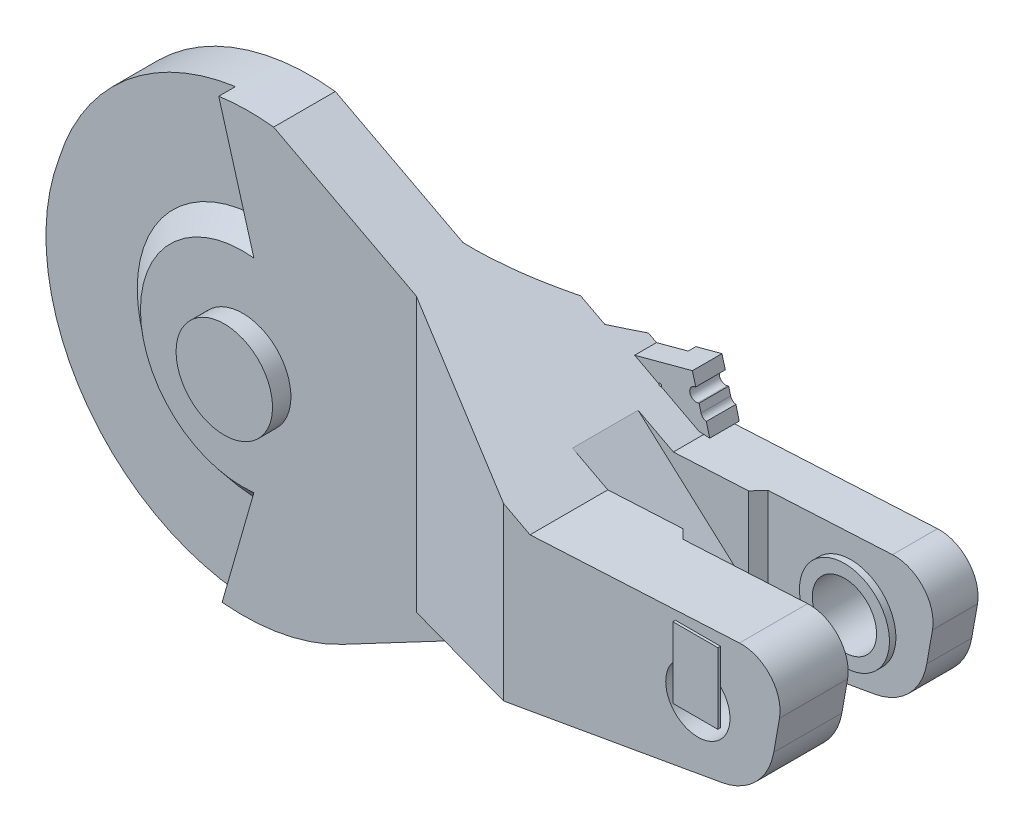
ISO-10303-21;
HEADER;
FILE_DESCRIPTION(('STEP AP214'),'2;1');
FILE_NAME('part.step','',(''),(''),'','','');
FILE_SCHEMA(('AUTOMOTIVE_DESIGN { 1 0 10303 214 1 1 1 1 }'));
ENDSEC;
DATA;
#1=APPLICATION_CONTEXT('core data for automotive mechanical design processes');
#2=APPLICATION_PROTOCOL_DEFINITION('international standard','automotive_design',2000,#1);
#3=PRODUCT_CONTEXT('',#1,'mechanical');
#4=PRODUCT('Part','Part','',(#3));
#5=PRODUCT_RELATED_PRODUCT_CATEGORY('part','',(#4));
#6=PRODUCT_DEFINITION_FORMATION('','',#4);
#7=PRODUCT_DEFINITION_CONTEXT('part definition',#1,'design');
#8=PRODUCT_DEFINITION('design','',#6,#7);
#9=PRODUCT_DEFINITION_SHAPE('','',#8);
#10=(LENGTH_UNIT() NAMED_UNIT(*) SI_UNIT(.MILLI.,.METRE.));
#11=(NAMED_UNIT(*) PLANE_ANGLE_UNIT() SI_UNIT($,.RADIAN.));
#12=(NAMED_UNIT(*) SI_UNIT($,.STERADIAN.) SOLID_ANGLE_UNIT());
#13=UNCERTAINTY_MEASURE_WITH_UNIT(LENGTH_MEASURE(1.E-05),#10,'distance_accuracy_value','');
#14=(GEOMETRIC_REPRESENTATION_CONTEXT(3) GLOBAL_UNCERTAINTY_ASSIGNED_CONTEXT((#13)) GLOBAL_UNIT_ASSIGNED_CONTEXT((#10,
#11,#12)) REPRESENTATION_CONTEXT('',''));
#15=CARTESIAN_POINT('',(0.,0.,0.));
#16=DIRECTION('',(0.,0.,1.));
#17=DIRECTION('',(1.,0.,0.));
#18=AXIS2_PLACEMENT_3D('',#15,#16,#17);
#19=CARTESIAN_POINT('',(433.906597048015,24.5766558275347,91.));
#20=DIRECTION('',(0.,0.,1.));
#21=DIRECTION('',(1.,0.,0.));
#22=AXIS2_PLACEMENT_3D('',#19,#20,#21);
#23=PLANE('',#22);
#24=CARTESIAN_POINT('',(400.,0.,91.));
#25=DIRECTION('',(0.,0.,1.));
#26=DIRECTION('',(1.,0.,0.));
#27=AXIS2_PLACEMENT_3D('',#24,#25,#26);
#28=CIRCLE('',#27,25.);
#29=CARTESIAN_POINT('',(417.5,17.8535710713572,91.));
#30=VERTEX_POINT('',#29);
#31=CARTESIAN_POINT('',(382.5,17.8535710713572,91.));
#32=VERTEX_POINT('',#31);
#33=EDGE_CURVE('E376',#30,#32,#28,.F.);
#34=ORIENTED_EDGE('',*,*,#33,.T.);
#35=DIRECTION('',(0.,-1.,0.));
#36=VECTOR('',#35,1.);
#37=CARTESIAN_POINT('',(382.5,44.9999999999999,91.));
#38=LINE('',#37,#36);
#39=CARTESIAN_POINT('',(382.5,44.9999999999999,91.));
#40=VERTEX_POINT('',#39);
#41=EDGE_CURVE('E382',#40,#32,#38,.T.);
#42=ORIENTED_EDGE('',*,*,#41,.F.);
#43=DIRECTION('',(-1.,0.,0.));
#44=VECTOR('',#43,1.);
#45=CARTESIAN_POINT('',(382.5,44.9999999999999,91.));
#46=LINE('',#45,#44);
#47=CARTESIAN_POINT('',(417.5,44.9999999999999,91.));
#48=VERTEX_POINT('',#47);
#49=EDGE_CURVE('E391',#48,#40,#46,.T.);
#50=ORIENTED_EDGE('',*,*,#49,.F.);
#51=DIRECTION('',(0.,1.,0.));
#52=VECTOR('',#51,1.);
#53=CARTESIAN_POINT('',(417.5,44.9999999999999,91.));
#54=LINE('',#53,#52);
#55=EDGE_CURVE('E383',#30,#48,#54,.T.);
#56=ORIENTED_EDGE('',*,*,#55,.F.);
#57=EDGE_LOOP('',(#34,#42,#50,#56));
#58=FACE_BOUND('',#57,.T.);
#59=DIRECTION('',(0.984807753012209,0.173648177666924,0.));
#60=VECTOR('',#59,1.);
#61=CARTESIAN_POINT('',(135.,-96.3087100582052,91.));
#62=LINE('',#61,#60);
#63=CARTESIAN_POINT('',(248.853995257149,-76.2331788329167,91.));
#64=VERTEX_POINT('',#63);
#65=CARTESIAN_POINT('',(418.460664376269,-46.3269469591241,91.));
#66=VERTEX_POINT('',#65);
#67=EDGE_CURVE('E777',#64,#66,#62,.T.);
#68=ORIENTED_EDGE('',*,*,#67,.T.);
#69=CARTESIAN_POINT('',(409.778255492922,2.91344069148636,91.));
#70=DIRECTION('',(0.,0.,1.));
#71=DIRECTION('',(1.,0.,0.));
#72=AXIS2_PLACEMENT_3D('',#69,#70,#71);
#73=CIRCLE('',#72,50.);
#74=CARTESIAN_POINT('',(459.018643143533,-5.76896819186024,91.));
#75=VERTEX_POINT('',#74);
#76=EDGE_CURVE('E725',#66,#75,#73,.T.);
#77=ORIENTED_EDGE('',*,*,#76,.T.);
#78=DIRECTION('',(0.173648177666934,0.984807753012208,0.));
#79=VECTOR('',#78,1.);
#80=CARTESIAN_POINT('',(452.939154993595,-40.2474588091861,91.));
#81=LINE('',#80,#79);
#82=CARTESIAN_POINT('',(463.450829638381,19.3672104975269,91.));
#83=VERTEX_POINT('',#82);
#84=EDGE_CURVE('E930',#75,#83,#81,.T.);
#85=ORIENTED_EDGE('',*,*,#84,.T.);
#86=CARTESIAN_POINT('',(433.906597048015,24.5766558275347,91.));
#87=DIRECTION('',(0.,0.,1.));
#88=DIRECTION('',(1.,0.,0.));
#89=AXIS2_PLACEMENT_3D('',#86,#87,#88);
#90=CIRCLE('',#89,30.);
#91=CARTESIAN_POINT('',(432.336518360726,54.5355418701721,91.));
#92=VERTEX_POINT('',#91);
#93=EDGE_CURVE('E931',#83,#92,#90,.T.);
#94=ORIENTED_EDGE('',*,*,#93,.T.);
#95=DIRECTION('',(-0.998629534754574,-0.0523359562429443,0.));
#96=VECTOR('',#95,1.);
#97=CARTESIAN_POINT('',(432.336518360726,54.5355418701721,91.));
#98=LINE('',#97,#96);
#99=CARTESIAN_POINT('',(269.46867723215,46.0000000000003,91.));
#100=VERTEX_POINT('',#99);
#101=EDGE_CURVE('E793',#92,#100,#98,.T.);
#102=ORIENTED_EDGE('',*,*,#101,.T.);
#103=DIRECTION('',(-0.88536896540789,0.464889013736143,0.));
#104=VECTOR('',#103,1.);
#105=CARTESIAN_POINT('',(176.495697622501,94.818197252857,91.));
#106=LINE('',#105,#104);
#107=CARTESIAN_POINT('',(248.853995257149,56.8243450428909,91.));
#108=VERTEX_POINT('',#107);
#109=EDGE_CURVE('E807',#100,#108,#106,.T.);
#110=ORIENTED_EDGE('',*,*,#109,.T.);
#111=DIRECTION('',(0.,-1.,0.));
#112=VECTOR('',#111,1.);
#113=CARTESIAN_POINT('',(248.853995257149,-96.3087100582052,91.));
#114=LINE('',#113,#112);
#115=EDGE_CURVE('E768',#108,#64,#114,.T.);
#116=ORIENTED_EDGE('',*,*,#115,.T.);
#117=EDGE_LOOP('',(#68,#77,#85,#94,#102,#110,#116));
#118=FACE_BOUND('',#117,.T.);
#119=ADVANCED_FACE('F16',(#58,#118),#23,.T.);
#120=CARTESIAN_POINT('',(0.,0.,45.));
#121=DIRECTION('',(0.,0.,-1.));
#122=DIRECTION('',(-1.,0.,0.));
#123=AXIS2_PLACEMENT_3D('',#120,#121,#122);
#124=PLANE('',#123);
#125=DIRECTION('',(0.,-1.,0.));
#126=VECTOR('',#125,1.);
#127=CARTESIAN_POINT('',(135.,-96.3087100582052,45.));
#128=LINE('',#127,#126);
#129=CARTESIAN_POINT('',(135.,116.606733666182,45.));
#130=VERTEX_POINT('',#129);
#131=CARTESIAN_POINT('',(135.,-96.3087100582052,45.));
#132=VERTEX_POINT('',#131);
#133=EDGE_CURVE('E780',#130,#132,#128,.T.);
#134=ORIENTED_EDGE('',*,*,#133,.F.);
#135=DIRECTION('',(-0.885368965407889,0.464889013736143,0.));
#136=VECTOR('',#135,1.);
#137=CARTESIAN_POINT('',(269.46867723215,46.0000000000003,45.));
#138=LINE('',#137,#136);
#139=CARTESIAN_POINT('',(24.0494383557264,174.864589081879,45.));
#140=VERTEX_POINT('',#139);
#141=EDGE_CURVE('E698',#130,#140,#138,.T.);
#142=ORIENTED_EDGE('',*,*,#141,.T.);
#143=CARTESIAN_POINT('',(4.8929046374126,7.87838391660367,45.));
#144=DIRECTION('',(0.,0.,-1.));
#145=DIRECTION('',(-1.,0.,0.));
#146=AXIS2_PLACEMENT_3D('',#143,#144,#145);
#147=CIRCLE('',#146,168.081425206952);
#148=CARTESIAN_POINT('',(-18.6042727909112,174.309294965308,45.));
#149=VERTEX_POINT('',#148);
#150=EDGE_CURVE('E918',#149,#140,#147,.T.);
#151=ORIENTED_EDGE('',*,*,#150,.F.);
#152=DIRECTION('',(0.275637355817,-0.961261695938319,0.));
#153=VECTOR('',#152,1.);
#154=CARTESIAN_POINT('',(-16.0000000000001,165.227116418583,45.));
#155=LINE('',#154,#153);
#156=CARTESIAN_POINT('',(8.71723441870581,79.027876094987,45.));
#157=VERTEX_POINT('',#156);
#158=EDGE_CURVE('E938',#149,#157,#155,.T.);
#159=ORIENTED_EDGE('',*,*,#158,.T.);
#160=CARTESIAN_POINT('',(0.,0.,45.));
#161=DIRECTION('',(0.,0.,-1.));
#162=DIRECTION('',(-1.,0.,0.));
#163=AXIS2_PLACEMENT_3D('',#160,#161,#162);
#164=CIRCLE('',#163,79.5072032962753);
#165=CARTESIAN_POINT('',(8.71723441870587,-79.0278760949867,45.));
#166=VERTEX_POINT('',#165);
#167=EDGE_CURVE('E567',#166,#157,#164,.T.);
#168=ORIENTED_EDGE('',*,*,#167,.F.);
#169=DIRECTION('',(-0.275637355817,-0.961261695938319,0.));
#170=VECTOR('',#169,1.);
#171=CARTESIAN_POINT('',(8.71723441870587,-79.0278760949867,45.));
#172=LINE('',#171,#170);
#173=CARTESIAN_POINT('',(-16.0000000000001,-165.227116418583,45.));
#174=VERTEX_POINT('',#173);
#175=EDGE_CURVE('E934',#166,#174,#172,.T.);
#176=ORIENTED_EDGE('',*,*,#175,.T.);
#177=CARTESIAN_POINT('',(0.,0.,45.));
#178=DIRECTION('',(0.,0.,1.));
#179=DIRECTION('',(1.,0.,0.));
#180=AXIS2_PLACEMENT_3D('',#177,#178,#179);
#181=CIRCLE('',#180,166.);
#182=CARTESIAN_POINT('',(77.729501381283,-146.676939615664,45.));
#183=VERTEX_POINT('',#182);
#184=EDGE_CURVE('E936',#174,#183,#181,.T.);
#185=ORIENTED_EDGE('',*,*,#184,.T.);
#186=DIRECTION('',(0.884035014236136,0.4674206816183,0.));
#187=VECTOR('',#186,1.);
#188=CARTESIAN_POINT('',(192.,-86.2580721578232,45.));
#189=LINE('',#188,#187);
#190=CARTESIAN_POINT('',(192.,-86.2580721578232,45.));
#191=VERTEX_POINT('',#190);
#192=EDGE_CURVE('E695',#183,#191,#189,.T.);
#193=ORIENTED_EDGE('',*,*,#192,.T.);
#194=DIRECTION('',(0.984807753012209,0.173648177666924,0.));
#195=VECTOR('',#194,1.);
#196=CARTESIAN_POINT('',(135.,-96.3087100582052,45.));
#197=LINE('',#196,#195);
#198=EDGE_CURVE('E776',#132,#191,#197,.T.);
#199=ORIENTED_EDGE('',*,*,#198,.F.);
#200=EDGE_LOOP('',(#134,#142,#151,#159,#168,#176,#185,#193,#199));
#201=FACE_BOUND('',#200,.T.);
#202=CARTESIAN_POINT('',(0.,0.,45.));
#203=DIRECTION('',(0.,0.,-1.));
#204=DIRECTION('',(-1.,0.,0.));
#205=AXIS2_PLACEMENT_3D('',#202,#203,#204);
#206=CIRCLE('',#205,37.5);
#207=CARTESIAN_POINT('',(-37.5,0.,45.));
#208=VERTEX_POINT('',#207);
#209=EDGE_CURVE('E11',#208,#208,#206,.F.);
#210=ORIENTED_EDGE('',*,*,#209,.F.);
#211=EDGE_LOOP('',(#210));
#212=FACE_BOUND('',#211,.T.);
#213=ADVANCED_FACE('F538',(#201,#212),#124,.F.);
#214=CARTESIAN_POINT('',(269.46867723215,46.0000000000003,45.));
#215=DIRECTION('',(-0.464889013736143,-0.885368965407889,0.));
#216=DIRECTION('',(0.88536896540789,-0.464889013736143,0.));
#217=AXIS2_PLACEMENT_3D('',#214,#215,#216);
#218=PLANE('',#217);
#219=DIRECTION('',(0.88536896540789,-0.464889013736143,0.));
#220=VECTOR('',#219,1.);
#221=CARTESIAN_POINT('',(269.46867723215,46.0000000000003,-60.));
#222=LINE('',#221,#220);
#223=CARTESIAN_POINT('',(210.53450626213,76.9451197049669,-60.));
#224=VERTEX_POINT('',#223);
#225=CARTESIAN_POINT('',(216.843769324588,73.6322555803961,-60.));
#226=VERTEX_POINT('',#225);
#227=EDGE_CURVE('E1371',#224,#226,#222,.T.);
#228=ORIENTED_EDGE('',*,*,#227,.F.);
#229=CARTESIAN_POINT('',(212.806162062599,75.7523200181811,-63.0002));
#230=CARTESIAN_POINT('',(211.402032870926,76.4895993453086,-61.1373015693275));
#231=CARTESIAN_POINT('',(209.991103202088,77.2304494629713,-59.2809229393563));
#232=CARTESIAN_POINT('',(207.154787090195,78.7197406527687,-55.5826130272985));
#233=CARTESIAN_POINT('',(205.729401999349,79.468181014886,-53.7406804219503));
#234=CARTESIAN_POINT('',(202.863046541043,80.9732452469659,-50.0723081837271));
#235=CARTESIAN_POINT('',(201.422076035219,81.7298691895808,-48.2458686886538));
#236=CARTESIAN_POINT('',(198.52330330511,83.2519550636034,-44.6098073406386));
#237=CARTESIAN_POINT('',(197.065499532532,84.0174178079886,-42.800187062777));
#238=CARTESIAN_POINT('',(195.598783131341,84.7875603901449,-40.9998));
#239=B_SPLINE_CURVE_WITH_KNOTS('',3,(#229,#230,#231,#232,#233,#234,#235,#236,#237,#238),
.UNSPECIFIED.,.F.,.F.,(4,2,2,2,4),(0.,7.33961538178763,14.6785504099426,22.0175506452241,
29.3572313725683),.UNSPECIFIED.);
#240=CARTESIAN_POINT('',(195.598946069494,84.7874748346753,-41.));
#241=VERTEX_POINT('',#240);
#242=EDGE_CURVE('E748',#224,#241,#239,.T.);
#243=ORIENTED_EDGE('',*,*,#242,.T.);
#244=DIRECTION('',(-0.88536896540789,0.464889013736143,0.));
#245=VECTOR('',#244,1.);
#246=CARTESIAN_POINT('',(269.46867723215,46.0000000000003,-41.));
#247=LINE('',#246,#245);
#248=CARTESIAN_POINT('',(176.89857173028,94.606656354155,-41.));
#249=VERTEX_POINT('',#248);
#250=EDGE_CURVE('E858',#241,#249,#247,.T.);
#251=ORIENTED_EDGE('',*,*,#250,.T.);
#252=CARTESIAN_POINT('',(291.812783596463,34.2675698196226,-174.117716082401));
#253=CARTESIAN_POINT('',(290.488574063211,34.9628849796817,-172.355273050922));
#254=CARTESIAN_POINT('',(289.162095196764,35.6593917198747,-170.595006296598));
#255=CARTESIAN_POINT('',(286.504372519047,37.054907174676,-167.079063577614));
#256=CARTESIAN_POINT('',(285.17312870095,37.7539158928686,-165.323387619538));
#257=CARTESIAN_POINT('',(281.171881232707,39.8548885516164,-160.063565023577));
#258=CARTESIAN_POINT('',(278.49439617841,41.2607808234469,-156.566669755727));
#259=CARTESIAN_POINT('',(273.116639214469,44.0845302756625,-149.593347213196));
#260=CARTESIAN_POINT('',(270.41636035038,45.5023911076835,-146.116926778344));
#261=CARTESIAN_POINT('',(264.991586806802,48.3508279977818,-139.188280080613));
#262=CARTESIAN_POINT('',(262.267092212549,49.7814040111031,-135.73605373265));
#263=CARTESIAN_POINT('',(256.762652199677,52.671672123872,-128.822861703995));
#264=CARTESIAN_POINT('',(253.98242485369,54.131512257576,-125.362182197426));
#265=CARTESIAN_POINT('',(248.391517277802,57.067182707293,-118.472310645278));
#266=CARTESIAN_POINT('',(245.580836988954,58.5430130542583,-115.043118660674));
#267=CARTESIAN_POINT('',(239.925884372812,61.5123122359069,-108.221095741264));
#268=CARTESIAN_POINT('',(237.081616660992,63.0057786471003,-104.828259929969));
#269=CARTESIAN_POINT('',(231.355044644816,66.0126837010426,-98.0837509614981));
#270=CARTESIAN_POINT('',(228.472740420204,67.5261223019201,-94.7320777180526));
#271=CARTESIAN_POINT('',(222.782164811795,70.5141263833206,-88.2101355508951));
#272=CARTESIAN_POINT('',(219.97557849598,71.9878070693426,-85.0379924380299));
#273=CARTESIAN_POINT('',(214.318152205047,74.9584051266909,-78.7443030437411));
#274=CARTESIAN_POINT('',(211.467312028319,76.4553226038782,-75.6227569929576));
#275=CARTESIAN_POINT('',(207.153169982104,78.7205897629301,-70.9841720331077));
#276=CARTESIAN_POINT('',(205.708522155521,79.479144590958,-69.4449686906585));
#277=CARTESIAN_POINT('',(202.805977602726,81.0032109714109,-66.3825893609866));
#278=CARTESIAN_POINT('',(201.348080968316,81.7687224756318,-64.8594132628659));
#279=CARTESIAN_POINT('',(198.418199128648,83.3071431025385,-61.8304359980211));
#280=CARTESIAN_POINT('',(196.946213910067,84.0800522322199,-60.3246348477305));
#281=CARTESIAN_POINT('',(193.98726994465,85.6337327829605,-57.3319392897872));
#282=CARTESIAN_POINT('',(192.50031133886,86.4145041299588,-55.8450447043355));
#283=CARTESIAN_POINT('',(189.515156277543,87.981947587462,-52.8964946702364));
#284=CARTESIAN_POINT('',(188.017010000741,88.7685933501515,-51.4347744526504));
#285=CARTESIAN_POINT('',(185.003848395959,90.3507424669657,-48.5336667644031));
#286=CARTESIAN_POINT('',(183.488833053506,91.1462458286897,-47.0942793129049));
#287=CARTESIAN_POINT('',(180.44074940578,92.7467317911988,-44.2398507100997));
#288=CARTESIAN_POINT('',(178.907679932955,93.5517150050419,-42.8248111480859));
#289=CARTESIAN_POINT('',(175.822435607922,95.1717132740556,-40.0215426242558));
#290=CARTESIAN_POINT('',(174.270260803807,95.9867283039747,-38.633313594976));
#291=CARTESIAN_POINT('',(171.14662090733,97.6268872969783,-35.8872331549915));
#292=CARTESIAN_POINT('',(169.575169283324,98.4520241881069,-34.5293622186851));
#293=CARTESIAN_POINT('',(166.410678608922,100.113633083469,-31.8460240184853));
#294=CARTESIAN_POINT('',(164.817639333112,100.950105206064,-30.5205570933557));
#295=CARTESIAN_POINT('',(161.608903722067,102.634946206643,-27.9055999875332));
#296=CARTESIAN_POINT('',(159.993210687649,103.483313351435,-26.6161046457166));
#297=CARTESIAN_POINT('',(156.737655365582,105.19273841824,-24.076731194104));
#298=CARTESIAN_POINT('',(155.097793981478,106.053795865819,-22.8268516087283));
#299=CARTESIAN_POINT('',(151.880745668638,107.743001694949,-20.436504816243));
#300=CARTESIAN_POINT('',(150.304887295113,108.570452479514,-19.2937589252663));
#301=CARTESIAN_POINT('',(147.129174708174,110.237953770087,-17.0516350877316));
#302=CARTESIAN_POINT('',(145.529320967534,111.078004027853,-15.9522562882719));
#303=CARTESIAN_POINT('',(142.304398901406,112.771344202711,-13.80126060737));
#304=CARTESIAN_POINT('',(140.679328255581,113.624635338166,-12.7496481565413));
#305=CARTESIAN_POINT('',(137.403193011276,115.344866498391,-10.6992934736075));
#306=CARTESIAN_POINT('',(135.752128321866,116.211806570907,-9.70055142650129));
#307=CARTESIAN_POINT('',(132.424602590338,117.959021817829,-7.76221212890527));
#308=CARTESIAN_POINT('',(130.748162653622,118.839285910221,-6.82256875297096));
#309=CARTESIAN_POINT('',(127.368151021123,120.614060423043,-5.0075405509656));
#310=CARTESIAN_POINT('',(125.664579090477,121.508570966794,-4.13215628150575));
#311=CARTESIAN_POINT('',(122.230479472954,123.311745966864,-2.45219474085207));
#312=CARTESIAN_POINT('',(120.499955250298,124.220408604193,-1.64760845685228));
#313=CARTESIAN_POINT('',(117.012248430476,126.051731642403,-0.115945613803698));
#314=CARTESIAN_POINT('',(115.255067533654,126.974391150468,0.611135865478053));
#315=CARTESIAN_POINT('',(112.01551221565,128.675414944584,1.86457378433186));
#316=CARTESIAN_POINT('',(110.537115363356,129.451690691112,2.40405344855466));
#317=CARTESIAN_POINT('',(107.563770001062,131.012933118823,3.42072186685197));
#318=CARTESIAN_POINT('',(106.068823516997,131.797898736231,3.89791815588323));
#319=CARTESIAN_POINT('',(103.06359146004,133.375884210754,4.78618413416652));
#320=CARTESIAN_POINT('',(101.553306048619,134.168903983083,5.19725451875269));
#321=CARTESIAN_POINT('',(98.5191306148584,135.762087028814,5.94961797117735));
#322=CARTESIAN_POINT('',(96.9952405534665,136.56225032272,6.29091083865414));
#323=CARTESIAN_POINT('',(93.938628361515,138.167214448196,6.89992469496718));
#324=CARTESIAN_POINT('',(92.4059257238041,138.972005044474,7.16777015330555));
#325=CARTESIAN_POINT('',(89.3316380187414,140.586250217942,7.62793533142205));
#326=CARTESIAN_POINT('',(87.7900529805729,141.395704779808,7.82025529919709));
#327=CARTESIAN_POINT('',(84.700828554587,143.017792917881,8.12732048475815));
#328=CARTESIAN_POINT('',(83.1531891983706,143.830426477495,8.24206610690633));
#329=CARTESIAN_POINT('',(80.0548959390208,145.457276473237,8.3927218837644));
#330=CARTESIAN_POINT('',(78.5042420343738,146.271492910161,8.42863199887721));
#331=CARTESIAN_POINT('',(75.3989247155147,147.902031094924,8.42120498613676));
#332=CARTESIAN_POINT('',(73.8442616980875,148.718352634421,8.37765512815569));
#333=CARTESIAN_POINT('',(70.7382680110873,150.349245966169,8.21138136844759));
#334=CARTESIAN_POINT('',(69.1869373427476,151.163817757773,8.08865743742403));
#335=CARTESIAN_POINT('',(66.0906623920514,152.789607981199,7.76538962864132));
#336=CARTESIAN_POINT('',(64.5457181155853,153.600826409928,7.56484567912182));
#337=CARTESIAN_POINT('',(61.4650306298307,155.218431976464,7.0880765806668));
#338=CARTESIAN_POINT('',(59.9292874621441,156.024819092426,6.81185108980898));
#339=CARTESIAN_POINT('',(56.8678029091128,157.632341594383,6.18617682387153));
#340=CARTESIAN_POINT('',(55.3420745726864,158.433470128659,5.83664681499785));
#341=CARTESIAN_POINT('',(52.3044969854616,160.028439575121,5.06789563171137));
#342=CARTESIAN_POINT('',(50.792647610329,160.822280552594,4.64867508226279));
#343=CARTESIAN_POINT('',(47.7844211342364,162.401838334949,3.74421864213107));
#344=CARTESIAN_POINT('',(46.2880451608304,163.187554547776,3.25897797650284));
#345=CARTESIAN_POINT('',(43.3121408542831,164.750140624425,2.22643303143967));
#346=CARTESIAN_POINT('',(41.8326136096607,165.527009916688,1.67912476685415));
#347=CARTESIAN_POINT('',(38.1051864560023,167.484205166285,0.218368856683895));
#348=CARTESIAN_POINT('',(35.8693115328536,168.658217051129,-0.734410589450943));
#349=CARTESIAN_POINT('',(31.441383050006,170.983231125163,-2.76216539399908));
#350=CARTESIAN_POINT('',(29.249335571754,172.13423012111,-3.83715757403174));
#351=CARTESIAN_POINT('',(24.9083824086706,174.413575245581,-6.09610719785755));
#352=CARTESIAN_POINT('',(22.7595011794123,175.541908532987,-7.28012439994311));
#353=CARTESIAN_POINT('',(18.5054465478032,177.775625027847,-9.74388751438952));
#354=CARTESIAN_POINT('',(16.4002717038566,178.881008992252,-11.0236302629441));
#355=CARTESIAN_POINT('',(12.2129392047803,181.079691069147,-13.6795934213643));
#356=CARTESIAN_POINT('',(10.1311681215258,182.172786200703,-15.0565891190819));
#357=CARTESIAN_POINT('',(6.00840361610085,184.337564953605,-17.8861919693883));
#358=CARTESIAN_POINT('',(3.96741036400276,185.409248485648,-19.3387994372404));
#359=CARTESIAN_POINT('',(-0.0753692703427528,187.532028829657,-22.3100392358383));
#360=CARTESIAN_POINT('',(-2.07717014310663,188.583133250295,-23.8286464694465));
#361=CARTESIAN_POINT('',(-6.04480440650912,190.666456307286,-26.9245839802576));
#362=CARTESIAN_POINT('',(-8.01063740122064,191.698674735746,-28.5019149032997));
#363=CARTESIAN_POINT('',(-12.3308830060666,193.967146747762,-32.0557325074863));
#364=CARTESIAN_POINT('',(-14.677252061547,195.199176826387,-34.0446861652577));
#365=CARTESIAN_POINT('',(-19.3247108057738,197.639461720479,-38.0891415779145));
#366=CARTESIAN_POINT('',(-21.6257975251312,198.847714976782,-40.1446476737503));
#367=CARTESIAN_POINT('',(-26.1871032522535,201.242762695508,-44.313940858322));
#368=CARTESIAN_POINT('',(-28.4473117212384,202.429551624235,-46.4277426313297));
#369=CARTESIAN_POINT('',(-32.9298744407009,204.78325301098,-50.7057649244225));
#370=CARTESIAN_POINT('',(-35.1522294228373,205.950165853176,-52.8699844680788));
#371=CARTESIAN_POINT('',(-39.5665960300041,208.268058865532,-57.2468073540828));
#372=CARTESIAN_POINT('',(-41.758543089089,209.419005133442,-59.4594936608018));
#373=CARTESIAN_POINT('',(-46.1108855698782,211.704330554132,-63.92408142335));
#374=CARTESIAN_POINT('',(-48.2712808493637,212.838709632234,-66.1759830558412));
#375=CARTESIAN_POINT('',(-52.5629694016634,215.092186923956,-70.7142296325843));
#376=CARTESIAN_POINT('',(-54.694266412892,216.211287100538,-73.000570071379));
#377=CARTESIAN_POINT('',(-58.9305018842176,218.435647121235,-77.6041568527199));
#378=CARTESIAN_POINT('',(-61.0354404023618,219.540906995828,-79.9214031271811));
#379=CARTESIAN_POINT('',(-65.1182416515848,221.684701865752,-84.4688815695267));
#380=CARTESIAN_POINT('',(-67.097262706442,222.72384507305,-86.6977882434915));
#381=CARTESIAN_POINT('',(-71.0351878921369,224.791568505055,-91.1781423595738));
#382=CARTESIAN_POINT('',(-72.9940920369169,225.820148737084,-93.4295897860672));
#383=CARTESIAN_POINT('',(-76.8934168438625,227.867603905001,-97.9529917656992));
#384=CARTESIAN_POINT('',(-78.8338366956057,228.886478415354,-100.22494720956));
#385=CARTESIAN_POINT('',(-82.6975108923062,230.915214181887,-104.787404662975));
#386=CARTESIAN_POINT('',(-84.6207651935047,231.925075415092,-107.077906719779));
#387=CARTESIAN_POINT('',(-88.442523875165,233.93180220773,-111.665185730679));
#388=CARTESIAN_POINT('',(-90.3411015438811,234.928706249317,-113.961884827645));
#389=CARTESIAN_POINT('',(-94.1236376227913,236.914838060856,-118.570593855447));
#390=CARTESIAN_POINT('',(-96.0075960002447,237.904065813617,-120.882603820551));
#391=CARTESIAN_POINT('',(-99.7616600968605,239.875247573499,-125.520323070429));
#392=CARTESIAN_POINT('',(-101.631767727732,240.85720258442,-127.846030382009));
#393=CARTESIAN_POINT('',(-105.359300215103,242.814453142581,-132.510336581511));
#394=CARTESIAN_POINT('',(-107.216725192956,243.789748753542,-134.848935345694));
#395=CARTESIAN_POINT('',(-109.068277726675,244.761960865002,-137.193437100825));
#396=B_SPLINE_CURVE_WITH_KNOTS('',3,(#252,#253,#254,#255,#256,#257,#258,#259,#260,#261,#262,
#263,#264,#265,#266,#267,#268,#269,#270,#271,#272,#273,#274,#275,#276,#277,#278,#279,#280,#281,
#282,#283,#284,#285,#286,#287,#288,#289,#290,#291,#292,#293,#294,#295,#296,#297,#298,#299,#300,
#301,#302,#303,#304,#305,#306,#307,#308,#309,#310,#311,#312,#313,#314,#315,#316,#317,#318,#319,
#320,#321,#322,#323,#324,#325,#326,#327,#328,#329,#330,#331,#332,#333,#334,#335,#336,#337,#338,
#339,#340,#341,#342,#343,#344,#345,#346,#347,#348,#349,#350,#351,#352,#353,#354,#355,#356,#357,
#358,#359,#360,#361,#362,#363,#364,#365,#366,#367,#368,#369,#370,#371,#372,#373,#374,#375,#376,
#377,#378,#379,#380,#381,#382,#383,#384,#385,#386,#387,#388,#389,#390,#391,#392,#393,#394,#395),
.UNSPECIFIED.,.F.,.F.,(4,2,2,2,2,2,2,2,2,2,2,2,2,2,2,2,2,2,2,2,2,2,2,2,2,2,2,2,2,2,2,2,2,2,2,2,
2,2,2,2,2,2,2,2,2,2,2,2,2,2,2,2,2,2,2,2,2,2,2,2,2,2,2,2,2,2,2,2,2,2,2,4),(0.,6.93460377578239,
13.8692174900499,27.7386262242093,41.6124316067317,55.4861881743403,69.5050366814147,
83.5239123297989,97.5408834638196,111.557825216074,125.010995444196,138.464226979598,
145.193480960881,151.92268834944,158.651902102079,165.381052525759,172.088997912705,
178.796949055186,185.505336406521,192.21370687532,198.917630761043,205.621624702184,
212.324651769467,219.027428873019,225.37232488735,231.71709605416,238.0624545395,
244.407835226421,250.748200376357,257.088620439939,263.428232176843,269.767441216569,
275.030713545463,280.29334853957,285.555928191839,290.818522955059,296.072143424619,
301.32574664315,306.579322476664,311.832900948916,317.100564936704,322.36823087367,
327.635901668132,332.903596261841,338.177159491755,343.450675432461,348.724572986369,
353.99880935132,362.092343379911,370.186992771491,378.286105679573,386.384951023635,
394.557863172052,402.730809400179,410.900674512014,419.070629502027,429.009874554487,
438.949769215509,448.892190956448,458.834420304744,468.795255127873,478.756134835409,
488.715722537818,498.675288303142,508.145029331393,517.614763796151,527.084911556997,
536.555083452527,545.981510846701,555.407959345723,564.833081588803,574.258113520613),.UNSPECIFIED.);
#397=CARTESIAN_POINT('',(123.346772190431,122.725603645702,-2.99999999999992));
#398=VERTEX_POINT('',#397);
#399=EDGE_CURVE('E896',#249,#398,#396,.T.);
#400=ORIENTED_EDGE('',*,*,#399,.T.);
#401=DIRECTION('',(-0.885368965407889,0.464889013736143,0.));
#402=VECTOR('',#401,1.);
#403=CARTESIAN_POINT('',(24.0494383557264,174.864589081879,-3.));
#404=LINE('',#403,#402);
#405=CARTESIAN_POINT('',(24.0494383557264,174.864589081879,-3.));
#406=VERTEX_POINT('',#405);
#407=EDGE_CURVE('E908',#398,#406,#404,.T.);
#408=ORIENTED_EDGE('',*,*,#407,.T.);
#409=DIRECTION('',(0.,0.,-1.));
#410=VECTOR('',#409,1.);
#411=CARTESIAN_POINT('',(24.0494383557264,174.864589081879,305.946692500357));
#412=LINE('',#411,#410);
#413=EDGE_CURVE('E915',#140,#406,#412,.T.);
#414=ORIENTED_EDGE('',*,*,#413,.F.);
#415=ORIENTED_EDGE('',*,*,#141,.F.);
#416=DIRECTION('',(-0.833638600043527,0.437726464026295,-0.336811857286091));
#417=VECTOR('',#416,1.);
#418=CARTESIAN_POINT('',(92.6651217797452,138.83590653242,27.8955989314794));
#419=LINE('',#418,#417);
#420=EDGE_CURVE('E962',#108,#130,#419,.T.);
#421=ORIENTED_EDGE('',*,*,#420,.F.);
#422=ORIENTED_EDGE('',*,*,#109,.F.);
#423=DIRECTION('',(0.,0.,-1.));
#424=VECTOR('',#423,1.);
#425=CARTESIAN_POINT('',(269.46867723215,46.0000000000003,45.));
#426=LINE('',#425,#424);
#427=CARTESIAN_POINT('',(269.46867723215,46.0000000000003,30.5));
#428=VERTEX_POINT('',#427);
#429=EDGE_CURVE('E692',#100,#428,#426,.T.);
#430=ORIENTED_EDGE('',*,*,#429,.T.);
#431=DIRECTION('',(0.885368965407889,-0.464889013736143,0.));
#432=VECTOR('',#431,1.);
#433=CARTESIAN_POINT('',(242.030669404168,60.4071329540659,30.5));
#434=LINE('',#433,#432);
#435=CARTESIAN_POINT('',(242.030669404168,60.4071329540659,30.5));
#436=VERTEX_POINT('',#435);
#437=EDGE_CURVE('E804',#436,#428,#434,.T.);
#438=ORIENTED_EDGE('',*,*,#437,.F.);
#439=DIRECTION('',(0.,0.,-1.));
#440=VECTOR('',#439,1.);
#441=CARTESIAN_POINT('',(242.030669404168,60.4071329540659,38.));
#442=LINE('',#441,#440);
#443=CARTESIAN_POINT('',(242.030669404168,60.4071329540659,-20.5));
#444=VERTEX_POINT('',#443);
#445=EDGE_CURVE('E854',#436,#444,#442,.T.);
#446=ORIENTED_EDGE('',*,*,#445,.T.);
#447=DIRECTION('',(-0.885368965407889,0.464889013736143,0.));
#448=VECTOR('',#447,1.);
#449=CARTESIAN_POINT('',(269.46867723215,46.0000000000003,-20.5));
#450=LINE('',#449,#448);
#451=CARTESIAN_POINT('',(269.46867723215,46.0000000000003,-20.5));
#452=VERTEX_POINT('',#451);
#453=EDGE_CURVE('E976',#452,#444,#450,.T.);
#454=ORIENTED_EDGE('',*,*,#453,.F.);
#455=CARTESIAN_POINT('',(269.46867723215,46.0000000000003,-63.));
#456=VERTEX_POINT('',#455);
#457=EDGE_CURVE('E697',#452,#456,#426,.T.);
#458=ORIENTED_EDGE('',*,*,#457,.T.);
#459=DIRECTION('',(0.885368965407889,-0.464889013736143,0.));
#460=VECTOR('',#459,1.);
#461=CARTESIAN_POINT('',(77.1715762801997,146.97124825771,-63.));
#462=LINE('',#461,#460);
#463=CARTESIAN_POINT('',(266.956653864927,47.3190117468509,-63.));
#464=VERTEX_POINT('',#463);
#465=EDGE_CURVE('E788',#464,#456,#462,.T.);
#466=ORIENTED_EDGE('',*,*,#465,.F.);
#467=DIRECTION('',(0.,0.,1.));
#468=VECTOR('',#467,1.);
#469=CARTESIAN_POINT('',(266.956653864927,47.3190117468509,45.));
#470=LINE('',#469,#468);
#471=CARTESIAN_POINT('',(266.956653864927,47.3190117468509,-43.));
#472=VERTEX_POINT('',#471);
#473=EDGE_CURVE('E994',#464,#472,#470,.T.);
#474=ORIENTED_EDGE('',*,*,#473,.T.);
#475=DIRECTION('',(-0.885368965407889,0.464889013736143,0.));
#476=VECTOR('',#475,1.);
#477=CARTESIAN_POINT('',(269.46867723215,46.0000000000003,-43.));
#478=LINE('',#477,#476);
#479=CARTESIAN_POINT('',(237.605662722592,62.7306128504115,-43.));
#480=VERTEX_POINT('',#479);
#481=EDGE_CURVE('E728',#472,#480,#478,.T.);
#482=ORIENTED_EDGE('',*,*,#481,.T.);
#483=CARTESIAN_POINT('',(240.560041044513,61.1793296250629,-45.0002));
#484=CARTESIAN_POINT('',(240.239160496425,61.347817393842,-44.7825814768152));
#485=CARTESIAN_POINT('',(239.918278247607,61.5163060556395,-44.5649661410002));
#486=CARTESIAN_POINT('',(239.436868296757,61.7690845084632,-44.2386048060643));
#487=CARTESIAN_POINT('',(239.276364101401,61.8533619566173,-44.129814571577));
#488=CARTESIAN_POINT('',(238.955332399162,62.0219290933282,-43.9122774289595));
#489=CARTESIAN_POINT('',(238.794804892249,62.1062187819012,-43.8035305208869));
#490=CARTESIAN_POINT('',(238.468196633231,62.277714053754,-43.5823924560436));
#491=CARTESIAN_POINT('',(238.302114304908,62.3649204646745,-43.4700042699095));
#492=CARTESIAN_POINT('',(237.969852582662,62.5393842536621,-43.245412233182));
#493=CARTESIAN_POINT('',(237.803673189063,62.6266416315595,-43.1332083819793));
#494=CARTESIAN_POINT('',(237.551135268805,62.7592440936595,-42.9633104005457));
#495=CARTESIAN_POINT('',(237.464892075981,62.8045286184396,-42.9053979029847));
#496=CARTESIAN_POINT('',(237.335356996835,62.8725448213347,-42.8188128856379));
#497=CARTESIAN_POINT('',(237.292142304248,62.8952359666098,-42.789993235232));
#498=CARTESIAN_POINT('',(237.205624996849,62.9406644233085,-42.7325246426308));
#499=CARTESIAN_POINT('',(237.162322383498,62.9634017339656,-42.7038756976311));
#500=CARTESIAN_POINT('',(237.073596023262,63.0099901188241,-42.6455863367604));
#501=CARTESIAN_POINT('',(237.028165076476,63.0338449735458,-42.6159598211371));
#502=CARTESIAN_POINT('',(236.959750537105,63.0697680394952,-42.5721040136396));
#503=CARTESIAN_POINT('',(236.936911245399,63.0817604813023,-42.5575890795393));
#504=CARTESIAN_POINT('',(236.8910737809,63.105828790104,-42.5288899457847));
#505=CARTESIAN_POINT('',(236.868075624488,63.1179046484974,-42.5147057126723));
#506=CARTESIAN_POINT('',(236.819650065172,63.1433319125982,-42.4856099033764));
#507=CARTESIAN_POINT('',(236.794195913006,63.1566973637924,-42.4707536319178));
#508=CARTESIAN_POINT('',(236.755452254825,63.1770408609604,-42.4496065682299));
#509=CARTESIAN_POINT('',(236.742415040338,63.1838864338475,-42.442733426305));
#510=CARTESIAN_POINT('',(236.716087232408,63.197710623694,-42.4296436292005));
#511=CARTESIAN_POINT('',(236.702796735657,63.2046891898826,-42.423426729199));
#512=CARTESIAN_POINT('',(236.67354331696,63.2200495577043,-42.4110901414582));
#513=CARTESIAN_POINT('',(236.657511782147,63.228467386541,-42.4051685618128));
#514=CARTESIAN_POINT('',(236.624958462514,63.2455604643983,-42.3961549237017));
#515=CARTESIAN_POINT('',(236.608444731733,63.2542314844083,-42.3930301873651));
#516=CARTESIAN_POINT('',(236.583392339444,63.2673859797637,-42.3913603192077));
#517=CARTESIAN_POINT('',(236.574930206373,63.271829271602,-42.3913178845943));
#518=CARTESIAN_POINT('',(236.558051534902,63.2806919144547,-42.3922600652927));
#519=CARTESIAN_POINT('',(236.549635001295,63.2851112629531,-42.3932447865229));
#520=CARTESIAN_POINT('',(236.532836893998,63.2939316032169,-42.396130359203));
#521=CARTESIAN_POINT('',(236.524456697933,63.2983318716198,-42.3980410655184));
#522=CARTESIAN_POINT('',(236.507853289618,63.3070499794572,-42.4025851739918));
#523=CARTESIAN_POINT('',(236.499630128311,63.3113677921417,-42.4052188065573));
#524=CARTESIAN_POINT('',(236.477751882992,63.3228556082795,-42.4130052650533));
#525=CARTESIAN_POINT('',(236.464235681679,63.329952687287,-42.418647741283));
#526=CARTESIAN_POINT('',(236.43751740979,63.3439819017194,-42.4308221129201));
#527=CARTESIAN_POINT('',(236.424315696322,63.3509138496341,-42.4373549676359));
#528=CARTESIAN_POINT('',(236.384966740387,63.371575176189,-42.4577679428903));
#529=CARTESIAN_POINT('',(236.359142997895,63.3851346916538,-42.4724338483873));
#530=CARTESIAN_POINT('',(236.307770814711,63.4121091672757,-42.5026869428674));
#531=CARTESIAN_POINT('',(236.282224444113,63.4255230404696,-42.5182784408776));
#532=CARTESIAN_POINT('',(236.23139796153,63.4522109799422,-42.5498835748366));
#533=CARTESIAN_POINT('',(236.206117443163,63.4654852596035,-42.5658963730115));
#534=CARTESIAN_POINT('',(236.131090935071,63.5048801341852,-42.6138934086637));
#535=CARTESIAN_POINT('',(236.08152221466,63.530907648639,-42.6462283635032));
#536=CARTESIAN_POINT('',(235.982576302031,63.5828621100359,-42.7112733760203));
#537=CARTESIAN_POINT('',(235.933199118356,63.6087890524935,-42.7439834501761));
#538=CARTESIAN_POINT('',(235.834510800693,63.6606082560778,-42.8096271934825));
#539=CARTESIAN_POINT('',(235.785199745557,63.6865004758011,-42.8425610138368));
#540=CARTESIAN_POINT('',(235.686637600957,63.7382534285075,-42.9085405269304));
#541=CARTESIAN_POINT('',(235.63738651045,63.764114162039,-42.9415862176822));
#542=CARTESIAN_POINT('',(235.490291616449,63.841350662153,-43.0404204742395));
#543=CARTESIAN_POINT('',(235.392501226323,63.8926983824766,-43.1063104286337));
#544=CARTESIAN_POINT('',(235.197009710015,63.9953469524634,-43.2381976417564));
#545=CARTESIAN_POINT('',(235.099308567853,64.0466478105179,-43.3041948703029));
#546=CARTESIAN_POINT('',(234.802013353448,64.2027514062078,-43.505155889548));
#547=CARTESIAN_POINT('',(234.602475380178,64.3075246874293,-43.6402255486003));
#548=CARTESIAN_POINT('',(234.203433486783,64.5170533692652,-43.9104797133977));
#549=CARTESIAN_POINT('',(234.003929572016,64.6218087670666,-44.0456642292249));
#550=CARTESIAN_POINT('',(233.603016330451,64.8323200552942,-44.3173968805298));
#551=CARTESIAN_POINT('',(233.401607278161,64.9380758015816,-44.4539455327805));
#552=CARTESIAN_POINT('',(232.998826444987,65.1495677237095,-44.7270611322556));
#553=CARTESIAN_POINT('',(232.79745466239,65.2553039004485,-44.8636280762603));
#554=CARTESIAN_POINT('',(232.596085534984,65.361038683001,-45.0002));
#555=B_SPLINE_CURVE_WITH_KNOTS('',3,(#483,#484,#485,#486,#487,#488,#489,#490,#491,#492,#493,
#494,#495,#496,#497,#498,#499,#500,#501,#502,#503,#504,#505,#506,#507,#508,#509,#510,#511,#512,
#513,#514,#515,#516,#517,#518,#519,#520,#521,#522,#523,#524,#525,#526,#527,#528,#529,#530,#531,
#532,#533,#534,#535,#536,#537,#538,#539,#540,#541,#542,#543,#544,#545,#546,#547,#548,#549,#550,
#551,#552,#553,#554),.UNSPECIFIED.,.F.,.F.,(4,2,2,2,2,2,2,2,2,2,2,2,2,2,2,2,2,2,2,2,2,2,2,2,2,2,
2,2,2,2,2,2,2,2,2,4),(0.,1.26822414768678,1.90249254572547,2.53676178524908,3.19279123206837,
3.84881850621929,4.18879145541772,4.35884039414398,4.5288865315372,4.70663826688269,
4.79543499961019,4.88422270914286,4.98128012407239,5.03002095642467,5.07874354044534,
5.13579103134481,5.19216294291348,5.22078024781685,5.24940050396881,5.27833227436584,
5.3072732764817,5.35604499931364,5.40486969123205,5.50276210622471,5.60115275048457,
5.69936066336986,5.89331658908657,6.08728106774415,6.28139314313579,6.47550178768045,
6.86133740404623,7.24707866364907,8.03532336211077,8.82364641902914,9.61961046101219,
10.4154944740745),.UNSPECIFIED.);
#556=CARTESIAN_POINT('',(235.550463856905,63.8097554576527,-43.));
#557=VERTEX_POINT('',#556);
#558=EDGE_CURVE('E503',#480,#557,#555,.T.);
#559=ORIENTED_EDGE('',*,*,#558,.T.);
#560=CARTESIAN_POINT('',(216.843769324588,73.6322555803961,-43.));
#561=VERTEX_POINT('',#560);
#562=EDGE_CURVE('E727',#557,#561,#478,.T.);
#563=ORIENTED_EDGE('',*,*,#562,.T.);
#564=DIRECTION('',(0.,0.,-1.));
#565=VECTOR('',#564,1.);
#566=CARTESIAN_POINT('',(216.843769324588,73.6322555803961,-43.));
#567=LINE('',#566,#565);
#568=EDGE_CURVE('E1010',#561,#226,#567,.T.);
#569=ORIENTED_EDGE('',*,*,#568,.T.);
#570=EDGE_LOOP('',(#228,#243,#251,#400,#408,#414,#415,#421,#422,#430,#438,#446,#454,#458,#466,
#474,#482,#559,#563,#569));
#571=FACE_BOUND('',#570,.T.);
#572=ADVANCED_FACE('F18',(#571),#218,.F.);
#573=CARTESIAN_POINT('',(0.,0.,-41.));
#574=DIRECTION('',(0.,0.,-1.));
#575=DIRECTION('',(-1.,0.,0.));
#576=AXIS2_PLACEMENT_3D('',#573,#574,#575);
#577=CONICAL_SURFACE('',#576,213.185045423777,0.5235987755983);
#578=CARTESIAN_POINT('',(0.,0.,-60.));
#579=DIRECTION('',(0.,0.,-1.));
#580=DIRECTION('',(-1.,0.,0.));
#581=AXIS2_PLACEMENT_3D('',#578,#579,#580);
#582=CIRCLE('',#581,224.15470053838);
#583=CARTESIAN_POINT('',(220.589066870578,39.8220209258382,-60.));
#584=VERTEX_POINT('',#583);
#585=EDGE_CURVE('E745',#584,#224,#582,.F.);
#586=ORIENTED_EDGE('',*,*,#585,.F.);
#587=CARTESIAN_POINT('',(-37.3267549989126,192.029507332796,-258.623665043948));
#588=DIRECTION('',(0.134922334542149,-0.694115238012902,-0.70710678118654));
#589=DIRECTION('',(-0.134922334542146,0.694115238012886,-0.707106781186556));
#590=AXIS2_PLACEMENT_3D('',#587,#588,#589);
#591=ELLIPSE('',#590,479.178160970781,276.653640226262);
#592=CARTESIAN_POINT('',(219.801876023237,37.6315731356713,-58.));
#593=VERTEX_POINT('',#592);
#594=EDGE_CURVE('E643',#584,#593,#591,.T.);
#595=ORIENTED_EDGE('',*,*,#594,.T.);
#596=CARTESIAN_POINT('',(0.,0.,-58.));
#597=DIRECTION('',(0.,0.,1.));
#598=DIRECTION('',(1.,0.,0.));
#599=AXIS2_PLACEMENT_3D('',#596,#597,#598);
#600=CIRCLE('',#599,223.);
#601=CARTESIAN_POINT('',(206.71067833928,-83.6641826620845,-58.));
#602=VERTEX_POINT('',#601);
#603=EDGE_CURVE('E742',#602,#593,#600,.T.);
#604=ORIENTED_EDGE('',*,*,#603,.F.);
#605=CARTESIAN_POINT('',(195.203727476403,-85.6931685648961,-40.9998));
#606=CARTESIAN_POINT('',(196.168941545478,-85.5229752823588,-42.4121009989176));
#607=CARTESIAN_POINT('',(197.132495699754,-85.3530746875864,-43.8255712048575));
#608=CARTESIAN_POINT('',(199.056412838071,-85.0138361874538,-46.6547392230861));
#609=CARTESIAN_POINT('',(200.016775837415,-84.8444982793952,-48.0704370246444));
#610=CARTESIAN_POINT('',(201.934448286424,-84.5063608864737,-50.9039625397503));
#611=CARTESIAN_POINT('',(202.891757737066,-84.3375614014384,-52.321790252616));
#612=CARTESIAN_POINT('',(204.803450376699,-84.0004784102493,-55.159488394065));
#613=CARTESIAN_POINT('',(205.757833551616,-83.8321949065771,-56.5793588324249));
#614=CARTESIAN_POINT('',(206.710812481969,-83.664159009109,-58.0002));
#615=B_SPLINE_CURVE_WITH_KNOTS('',3,(#605,#606,#607,#608,#609,#610,#611,#612,#613,#614),
.UNSPECIFIED.,.F.,.F.,(4,2,2,2,4),(0.,5.15720503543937,10.3143853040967,15.4715639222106,
20.6287673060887),.UNSPECIFIED.);
#616=CARTESIAN_POINT('',(195.203864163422,-85.6931444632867,-41.));
#617=VERTEX_POINT('',#616);
#618=EDGE_CURVE('E627',#617,#602,#615,.T.);
#619=ORIENTED_EDGE('',*,*,#618,.F.);
#620=CARTESIAN_POINT('',(0.,0.,-41.));
#621=DIRECTION('',(0.,0.,1.));
#622=DIRECTION('',(1.,0.,0.));
#623=AXIS2_PLACEMENT_3D('',#620,#621,#622);
#624=CIRCLE('',#623,213.185045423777);
#625=EDGE_CURVE('E747',#617,#241,#624,.T.);
#626=ORIENTED_EDGE('',*,*,#625,.T.);
#627=ORIENTED_EDGE('',*,*,#242,.F.);
#628=EDGE_LOOP('',(#586,#595,#604,#619,#626,#627));
#629=FACE_BOUND('',#628,.T.);
#630=ADVANCED_FACE('F526',(#629),#577,.F.);
#631=CARTESIAN_POINT('',(236.651827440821,63.4106660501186,-63.));
#632=DIRECTION('',(0.,0.,-1.));
#633=DIRECTION('',(-1.,0.,0.));
#634=AXIS2_PLACEMENT_3D('',#631,#632,#633);
#635=CYLINDRICAL_SURFACE('',#634,5.);
#636=CARTESIAN_POINT('',(236.651827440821,63.4106660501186,-50.));
#637=DIRECTION('',(0.,0.,-1.));
#638=DIRECTION('',(-1.,0.,0.));
#639=AXIS2_PLACEMENT_3D('',#636,#637,#638);
#640=CIRCLE('',#639,5.);
#641=CARTESIAN_POINT('',(231.651827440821,63.4106660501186,-50.));
#642=VERTEX_POINT('',#641);
#643=EDGE_CURVE('E511',#642,#642,#640,.T.);
#644=CARTESIAN_POINT('',(236.651827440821,63.4106660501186,-60.));
#645=DIRECTION('',(0.,0.,-1.));
#646=DIRECTION('',(-1.,0.,0.));
#647=AXIS2_PLACEMENT_3D('',#644,#645,#646);
#648=CIRCLE('',#647,5.);
#649=CARTESIAN_POINT('',(231.651827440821,63.4106660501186,-60.));
#650=VERTEX_POINT('',#649);
#651=EDGE_CURVE('E650',#650,#650,#648,.F.);
#652=CARTESIAN_POINT('',(231.651827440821,63.4106660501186,-50.));
#653=CARTESIAN_POINT('',(231.651827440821,63.4106660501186,-50.1041666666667));
#654=CARTESIAN_POINT('',(231.651827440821,63.4106660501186,-50.2083333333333));
#655=CARTESIAN_POINT('',(231.651827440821,63.4106660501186,-50.4166666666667));
#656=CARTESIAN_POINT('',(231.651827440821,63.4106660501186,-50.5208333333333));
#657=CARTESIAN_POINT('',(231.651827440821,63.4106660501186,-50.7291666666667));
#658=CARTESIAN_POINT('',(231.651827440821,63.4106660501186,-50.8333333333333));
#659=CARTESIAN_POINT('',(231.651827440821,63.4106660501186,-51.0416666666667));
#660=CARTESIAN_POINT('',(231.651827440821,63.4106660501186,-51.1458333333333));
#661=CARTESIAN_POINT('',(231.651827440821,63.4106660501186,-51.3541666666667));
#662=CARTESIAN_POINT('',(231.651827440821,63.4106660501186,-51.4583333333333));
#663=CARTESIAN_POINT('',(231.651827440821,63.4106660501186,-51.6666666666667));
#664=CARTESIAN_POINT('',(231.651827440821,63.4106660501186,-51.7708333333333));
#665=CARTESIAN_POINT('',(231.651827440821,63.4106660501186,-51.9791666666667));
#666=CARTESIAN_POINT('',(231.651827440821,63.4106660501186,-52.0833333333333));
#667=CARTESIAN_POINT('',(231.651827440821,63.4106660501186,-52.2916666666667));
#668=CARTESIAN_POINT('',(231.651827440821,63.4106660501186,-52.3958333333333));
#669=CARTESIAN_POINT('',(231.651827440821,63.4106660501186,-52.6041666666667));
#670=CARTESIAN_POINT('',(231.651827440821,63.4106660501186,-52.7083333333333));
#671=CARTESIAN_POINT('',(231.651827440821,63.4106660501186,-52.9166666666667));
#672=CARTESIAN_POINT('',(231.651827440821,63.4106660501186,-53.0208333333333));
#673=CARTESIAN_POINT('',(231.651827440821,63.4106660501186,-53.2291666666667));
#674=CARTESIAN_POINT('',(231.651827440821,63.4106660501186,-53.3333333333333));
#675=CARTESIAN_POINT('',(231.651827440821,63.4106660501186,-53.5416666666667));
#676=CARTESIAN_POINT('',(231.651827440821,63.4106660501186,-53.6458333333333));
#677=CARTESIAN_POINT('',(231.651827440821,63.4106660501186,-53.8541666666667));
#678=CARTESIAN_POINT('',(231.651827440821,63.4106660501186,-53.9583333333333));
#679=CARTESIAN_POINT('',(231.651827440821,63.4106660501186,-54.1666666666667));
#680=CARTESIAN_POINT('',(231.651827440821,63.4106660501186,-54.2708333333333));
#681=CARTESIAN_POINT('',(231.651827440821,63.4106660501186,-54.4791666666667));
#682=CARTESIAN_POINT('',(231.651827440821,63.4106660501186,-54.5833333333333));
#683=CARTESIAN_POINT('',(231.651827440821,63.4106660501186,-54.7916666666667));
#684=CARTESIAN_POINT('',(231.651827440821,63.4106660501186,-54.8958333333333));
#685=CARTESIAN_POINT('',(231.651827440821,63.4106660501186,-55.1041666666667));
#686=CARTESIAN_POINT('',(231.651827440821,63.4106660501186,-55.2083333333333));
#687=CARTESIAN_POINT('',(231.651827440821,63.4106660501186,-55.4166666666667));
#688=CARTESIAN_POINT('',(231.651827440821,63.4106660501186,-55.5208333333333));
#689=CARTESIAN_POINT('',(231.651827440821,63.4106660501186,-55.7291666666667));
#690=CARTESIAN_POINT('',(231.651827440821,63.4106660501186,-55.8333333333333));
#691=CARTESIAN_POINT('',(231.651827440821,63.4106660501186,-56.0416666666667));
#692=CARTESIAN_POINT('',(231.651827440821,63.4106660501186,-56.1458333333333));
#693=CARTESIAN_POINT('',(231.651827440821,63.4106660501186,-56.3541666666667));
#694=CARTESIAN_POINT('',(231.651827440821,63.4106660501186,-56.4583333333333));
#695=CARTESIAN_POINT('',(231.651827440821,63.4106660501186,-56.6666666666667));
#696=CARTESIAN_POINT('',(231.651827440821,63.4106660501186,-56.7708333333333));
#697=CARTESIAN_POINT('',(231.651827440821,63.4106660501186,-56.9791666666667));
#698=CARTESIAN_POINT('',(231.651827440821,63.4106660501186,-57.0833333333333));
#699=CARTESIAN_POINT('',(231.651827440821,63.4106660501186,-57.2916666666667));
#700=CARTESIAN_POINT('',(231.651827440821,63.4106660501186,-57.3958333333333));
#701=CARTESIAN_POINT('',(231.651827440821,63.4106660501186,-57.6041666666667));
#702=CARTESIAN_POINT('',(231.651827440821,63.4106660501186,-57.7083333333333));
#703=CARTESIAN_POINT('',(231.651827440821,63.4106660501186,-57.9166666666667));
#704=CARTESIAN_POINT('',(231.651827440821,63.4106660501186,-58.0208333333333));
#705=CARTESIAN_POINT('',(231.651827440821,63.4106660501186,-58.2291666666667));
#706=CARTESIAN_POINT('',(231.651827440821,63.4106660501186,-58.3333333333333));
#707=CARTESIAN_POINT('',(231.651827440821,63.4106660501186,-58.5416666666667));
#708=CARTESIAN_POINT('',(231.651827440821,63.4106660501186,-58.6458333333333));
#709=CARTESIAN_POINT('',(231.651827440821,63.4106660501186,-58.8541666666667));
#710=CARTESIAN_POINT('',(231.651827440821,63.4106660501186,-58.9583333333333));
#711=CARTESIAN_POINT('',(231.651827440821,63.4106660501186,-59.1666666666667));
#712=CARTESIAN_POINT('',(231.651827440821,63.4106660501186,-59.2708333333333));
#713=CARTESIAN_POINT('',(231.651827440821,63.4106660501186,-59.4791666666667));
#714=CARTESIAN_POINT('',(231.651827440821,63.4106660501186,-59.5833333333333));
#715=CARTESIAN_POINT('',(231.651827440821,63.4106660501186,-59.7916666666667));
#716=CARTESIAN_POINT('',(231.651827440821,63.4106660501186,-59.8958333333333));
#717=CARTESIAN_POINT('',(231.651827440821,63.4106660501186,-60.));
#718=B_SPLINE_CURVE_WITH_KNOTS('',3,(#652,#653,#654,#655,#656,#657,#658,#659,#660,#661,#662,
#663,#664,#665,#666,#667,#668,#669,#670,#671,#672,#673,#674,#675,#676,#677,#678,#679,#680,#681,
#682,#683,#684,#685,#686,#687,#688,#689,#690,#691,#692,#693,#694,#695,#696,#697,#698,#699,#700,
#701,#702,#703,#704,#705,#706,#707,#708,#709,#710,#711,#712,#713,#714,#715,#716,#717),
.UNSPECIFIED.,.F.,.F.,(4,2,2,2,2,2,2,2,2,2,2,2,2,2,2,2,2,2,2,2,2,2,2,2,2,2,2,2,2,2,2,2,4),(0.,
0.312499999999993,0.624999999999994,0.937499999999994,1.24999999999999,1.56249999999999,
1.87499999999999,2.1875,2.49999999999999,2.81249999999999,3.12499999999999,3.43749999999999,
3.74999999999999,4.06249999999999,4.37499999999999,4.68749999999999,4.99999999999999,
5.31249999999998,5.62499999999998,5.93749999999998,6.24999999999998,6.56249999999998,
6.87499999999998,7.18749999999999,7.49999999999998,7.81249999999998,8.12499999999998,
8.43749999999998,8.74999999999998,9.06249999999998,9.37499999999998,9.68749999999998,
9.99999999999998),.UNSPECIFIED.);
#719=EDGE_CURVE('BSEAM523',#642,#650,#718,.T.);
#720=ORIENTED_EDGE('',*,*,#643,.F.);
#721=ORIENTED_EDGE('',*,*,#651,.F.);
#722=ORIENTED_EDGE('',*,*,#719,.T.);
#723=ORIENTED_EDGE('',*,*,#719,.F.);
#724=EDGE_LOOP('',(#720,#722,#721,#723));
#725=FACE_BOUND('',#724,.T.);
#726=ADVANCED_FACE('F523',(#725),#635,.F.);
#727=CARTESIAN_POINT('',(433.906597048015,24.5766558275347,-28.));
#728=DIRECTION('',(0.,0.,-1.));
#729=DIRECTION('',(-1.,0.,0.));
#730=AXIS2_PLACEMENT_3D('',#727,#728,#729);
#731=PLANE('',#730);
#732=DIRECTION('',(-0.984807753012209,-0.173648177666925,0.));
#733=VECTOR('',#732,1.);
#734=CARTESIAN_POINT('',(452.939154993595,-40.2474588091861,-28.));
#735=LINE('',#734,#733);
#736=CARTESIAN_POINT('',(418.460664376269,-46.3269469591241,-28.));
#737=VERTEX_POINT('',#736);
#738=CARTESIAN_POINT('',(363.182386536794,-56.0739987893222,-28.));
#739=VERTEX_POINT('',#738);
#740=EDGE_CURVE('E837',#737,#739,#735,.T.);
#741=ORIENTED_EDGE('',*,*,#740,.F.);
#742=CARTESIAN_POINT('',(409.778255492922,2.91344069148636,-28.));
#743=DIRECTION('',(0.,0.,-1.));
#744=DIRECTION('',(-1.,0.,0.));
#745=AXIS2_PLACEMENT_3D('',#742,#743,#744);
#746=CIRCLE('',#745,50.);
#747=CARTESIAN_POINT('',(459.018643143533,-5.76896819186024,-28.));
#748=VERTEX_POINT('',#747);
#749=EDGE_CURVE('E718',#737,#748,#746,.F.);
#750=ORIENTED_EDGE('',*,*,#749,.T.);
#751=DIRECTION('',(-0.173648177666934,-0.984807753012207,0.));
#752=VECTOR('',#751,1.);
#753=CARTESIAN_POINT('',(463.450829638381,19.3672104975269,-28.));
#754=LINE('',#753,#752);
#755=CARTESIAN_POINT('',(463.450829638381,19.3672104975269,-28.));
#756=VERTEX_POINT('',#755);
#757=EDGE_CURVE('E834',#756,#748,#754,.T.);
#758=ORIENTED_EDGE('',*,*,#757,.F.);
#759=CARTESIAN_POINT('',(433.906597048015,24.5766558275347,-28.));
#760=DIRECTION('',(0.,0.,-1.));
#761=DIRECTION('',(-1.,0.,0.));
#762=AXIS2_PLACEMENT_3D('',#759,#760,#761);
#763=CIRCLE('',#762,30.);
#764=CARTESIAN_POINT('',(432.336518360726,54.5355418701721,-28.));
#765=VERTEX_POINT('',#764);
#766=EDGE_CURVE('E831',#765,#756,#763,.T.);
#767=ORIENTED_EDGE('',*,*,#766,.F.);
#768=DIRECTION('',(0.998629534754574,0.0523359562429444,0.));
#769=VECTOR('',#768,1.);
#770=CARTESIAN_POINT('',(269.46867723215,46.0000000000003,-28.));
#771=LINE('',#770,#769);
#772=CARTESIAN_POINT('',(335.5,49.4605549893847,-28.));
#773=VERTEX_POINT('',#772);
#774=EDGE_CURVE('E826',#773,#765,#771,.T.);
#775=ORIENTED_EDGE('',*,*,#774,.F.);
#776=DIRECTION('',(0.,-1.,0.));
#777=VECTOR('',#776,1.);
#778=CARTESIAN_POINT('',(335.5,-16.9999999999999,-28.));
#779=LINE('',#778,#777);
#780=CARTESIAN_POINT('',(335.5,-25.329593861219,-28.));
#781=VERTEX_POINT('',#780);
#782=EDGE_CURVE('E754',#773,#781,#779,.T.);
#783=ORIENTED_EDGE('',*,*,#782,.T.);
#784=DIRECTION('',(-0.669130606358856,0.743144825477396,0.));
#785=VECTOR('',#784,1.);
#786=CARTESIAN_POINT('',(363.182386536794,-56.0739987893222,-28.));
#787=LINE('',#786,#785);
#788=EDGE_CURVE('E839',#739,#781,#787,.T.);
#789=ORIENTED_EDGE('',*,*,#788,.F.);
#790=EDGE_LOOP('',(#741,#750,#758,#767,#775,#783,#789));
#791=FACE_BOUND('',#790,.T.);
#792=CARTESIAN_POINT('',(400.,0.,-28.));
#793=DIRECTION('',(0.,0.,-1.));
#794=DIRECTION('',(-1.,0.,0.));
#795=AXIS2_PLACEMENT_3D('',#792,#793,#794);
#796=CIRCLE('',#795,35.);
#797=CARTESIAN_POINT('',(365.,0.,-28.));
#798=VERTEX_POINT('',#797);
#799=EDGE_CURVE('E731',#798,#798,#796,.F.);
#800=ORIENTED_EDGE('',*,*,#799,.F.);
#801=EDGE_LOOP('',(#800));
#802=FACE_BOUND('',#801,.T.);
#803=ADVANCED_FACE('F525',(#791,#802),#731,.F.);
#804=CARTESIAN_POINT('',(433.906597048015,24.5766558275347,38.));
#805=DIRECTION('',(0.,0.,-1.));
#806=DIRECTION('',(-1.,0.,0.));
#807=AXIS2_PLACEMENT_3D('',#804,#805,#806);
#808=PLANE('',#807);
#809=DIRECTION('',(-0.173648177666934,-0.984807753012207,0.));
#810=VECTOR('',#809,1.);
#811=CARTESIAN_POINT('',(463.450829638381,19.3672104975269,38.));
#812=LINE('',#811,#810);
#813=CARTESIAN_POINT('',(463.450829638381,19.3672104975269,38.));
#814=VERTEX_POINT('',#813);
#815=CARTESIAN_POINT('',(459.018643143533,-5.76896819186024,38.));
#816=VERTEX_POINT('',#815);
#817=EDGE_CURVE('E846',#814,#816,#812,.T.);
#818=ORIENTED_EDGE('',*,*,#817,.T.);
#819=CARTESIAN_POINT('',(409.778255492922,2.91344069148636,38.));
#820=DIRECTION('',(0.,0.,-1.));
#821=DIRECTION('',(-1.,0.,0.));
#822=AXIS2_PLACEMENT_3D('',#819,#820,#821);
#823=CIRCLE('',#822,50.);
#824=CARTESIAN_POINT('',(418.460664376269,-46.3269469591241,38.));
#825=VERTEX_POINT('',#824);
#826=EDGE_CURVE('E723',#816,#825,#823,.T.);
#827=ORIENTED_EDGE('',*,*,#826,.T.);
#828=DIRECTION('',(-0.984807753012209,-0.173648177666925,0.));
#829=VECTOR('',#828,1.);
#830=CARTESIAN_POINT('',(452.939154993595,-40.2474588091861,38.));
#831=LINE('',#830,#829);
#832=CARTESIAN_POINT('',(363.182386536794,-56.0739987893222,38.));
#833=VERTEX_POINT('',#832);
#834=EDGE_CURVE('E849',#825,#833,#831,.T.);
#835=ORIENTED_EDGE('',*,*,#834,.T.);
#836=DIRECTION('',(-0.669130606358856,0.743144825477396,0.));
#837=VECTOR('',#836,1.);
#838=CARTESIAN_POINT('',(363.182386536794,-56.0739987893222,38.));
#839=LINE('',#838,#837);
#840=CARTESIAN_POINT('',(335.5,-25.329593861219,38.));
#841=VERTEX_POINT('',#840);
#842=EDGE_CURVE('E851',#833,#841,#839,.T.);
#843=ORIENTED_EDGE('',*,*,#842,.T.);
#844=DIRECTION('',(0.,1.,0.));
#845=VECTOR('',#844,1.);
#846=CARTESIAN_POINT('',(335.5,24.5766558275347,38.));
#847=LINE('',#846,#845);
#848=CARTESIAN_POINT('',(335.5,49.4605549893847,38.));
#849=VERTEX_POINT('',#848);
#850=EDGE_CURVE('E763',#841,#849,#847,.T.);
#851=ORIENTED_EDGE('',*,*,#850,.T.);
#852=DIRECTION('',(0.998629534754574,0.0523359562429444,0.));
#853=VECTOR('',#852,1.);
#854=CARTESIAN_POINT('',(269.46867723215,46.0000000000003,38.));
#855=LINE('',#854,#853);
#856=CARTESIAN_POINT('',(432.336518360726,54.5355418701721,38.));
#857=VERTEX_POINT('',#856);
#858=EDGE_CURVE('E842',#849,#857,#855,.T.);
#859=ORIENTED_EDGE('',*,*,#858,.T.);
#860=CARTESIAN_POINT('',(433.906597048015,24.5766558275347,38.));
#861=DIRECTION('',(0.,0.,-1.));
#862=DIRECTION('',(-1.,0.,0.));
#863=AXIS2_PLACEMENT_3D('',#860,#861,#862);
#864=CIRCLE('',#863,30.);
#865=EDGE_CURVE('E844',#857,#814,#864,.T.);
#866=ORIENTED_EDGE('',*,*,#865,.T.);
#867=EDGE_LOOP('',(#818,#827,#835,#843,#851,#859,#866));
#868=FACE_BOUND('',#867,.T.);
#869=CARTESIAN_POINT('',(400.,0.,38.));
#870=DIRECTION('',(0.,0.,-1.));
#871=DIRECTION('',(-1.,0.,0.));
#872=AXIS2_PLACEMENT_3D('',#869,#870,#871);
#873=CIRCLE('',#872,35.);
#874=CARTESIAN_POINT('',(435.,0.,38.));
#875=VERTEX_POINT('',#874);
#876=EDGE_CURVE('E1022',#875,#875,#873,.T.);
#877=ORIENTED_EDGE('',*,*,#876,.F.);
#878=EDGE_LOOP('',(#877));
#879=FACE_BOUND('',#878,.T.);
#880=ADVANCED_FACE('F1039',(#868,#879),#808,.T.);
#881=CARTESIAN_POINT('',(433.906597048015,24.5766558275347,-63.));
#882=DIRECTION('',(0.,0.,-1.));
#883=DIRECTION('',(-1.,0.,0.));
#884=AXIS2_PLACEMENT_3D('',#881,#882,#883);
#885=PLANE('',#884);
#886=CARTESIAN_POINT('',(400.,0.,-63.));
#887=DIRECTION('',(0.,0.,-1.));
#888=DIRECTION('',(-1.,0.,0.));
#889=AXIS2_PLACEMENT_3D('',#886,#887,#888);
#890=CIRCLE('',#889,25.);
#891=CARTESIAN_POINT('',(375.,0.,-63.));
#892=VERTEX_POINT('',#891);
#893=EDGE_CURVE('E385',#892,#892,#890,.T.);
#894=ORIENTED_EDGE('',*,*,#893,.F.);
#895=EDGE_LOOP('',(#894));
#896=FACE_BOUND('',#895,.T.);
#897=CARTESIAN_POINT('',(244.395544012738,49.9564459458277,-63.));
#898=DIRECTION('',(0.,0.,-1.));
#899=DIRECTION('',(-1.,0.,0.));
#900=AXIS2_PLACEMENT_3D('',#897,#898,#899);
#901=CIRCLE('',#900,5.);
#902=CARTESIAN_POINT('',(249.057960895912,48.1503814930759,-63.));
#903=VERTEX_POINT('',#902);
#904=CARTESIAN_POINT('',(248.246196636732,46.7670142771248,-63.));
#905=VERTEX_POINT('',#904);
#906=EDGE_CURVE('E447',#903,#905,#901,.T.);
#907=ORIENTED_EDGE('',*,*,#906,.F.);
#908=DIRECTION('',(0.998923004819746,-0.0463986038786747,0.));
#909=VECTOR('',#908,1.);
#910=CARTESIAN_POINT('',(434.601259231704,39.5321496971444,-63.));
#911=LINE('',#910,#909);
#912=EDGE_CURVE('E997',#903,#464,#911,.T.);
#913=ORIENTED_EDGE('',*,*,#912,.T.);
#914=ORIENTED_EDGE('',*,*,#465,.T.);
#915=DIRECTION('',(0.998629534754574,0.0523359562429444,0.));
#916=VECTOR('',#915,1.);
#917=CARTESIAN_POINT('',(269.46867723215,46.0000000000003,-63.));
#918=LINE('',#917,#916);
#919=CARTESIAN_POINT('',(432.336518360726,54.5355418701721,-63.));
#920=VERTEX_POINT('',#919);
#921=EDGE_CURVE('E784',#456,#920,#918,.T.);
#922=ORIENTED_EDGE('',*,*,#921,.T.);
#923=CARTESIAN_POINT('',(433.906597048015,24.5766558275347,-63.));
#924=DIRECTION('',(0.,0.,-1.));
#925=DIRECTION('',(-1.,0.,0.));
#926=AXIS2_PLACEMENT_3D('',#923,#924,#925);
#927=CIRCLE('',#926,30.);
#928=CARTESIAN_POINT('',(463.450829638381,19.3672104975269,-63.));
#929=VERTEX_POINT('',#928);
#930=EDGE_CURVE('E921',#920,#929,#927,.T.);
#931=ORIENTED_EDGE('',*,*,#930,.T.);
#932=DIRECTION('',(-0.173648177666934,-0.984807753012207,0.));
#933=VECTOR('',#932,1.);
#934=CARTESIAN_POINT('',(463.450829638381,19.3672104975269,-63.));
#935=LINE('',#934,#933);
#936=CARTESIAN_POINT('',(459.018643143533,-5.76896819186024,-63.));
#937=VERTEX_POINT('',#936);
#938=EDGE_CURVE('E924',#929,#937,#935,.T.);
#939=ORIENTED_EDGE('',*,*,#938,.T.);
#940=CARTESIAN_POINT('',(409.778255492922,2.91344069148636,-63.));
#941=DIRECTION('',(0.,0.,-1.));
#942=DIRECTION('',(-1.,0.,0.));
#943=AXIS2_PLACEMENT_3D('',#940,#941,#942);
#944=CIRCLE('',#943,50.);
#945=CARTESIAN_POINT('',(418.460664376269,-46.3269469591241,-63.));
#946=VERTEX_POINT('',#945);
#947=EDGE_CURVE('E712',#937,#946,#944,.T.);
#948=ORIENTED_EDGE('',*,*,#947,.T.);
#949=DIRECTION('',(-0.984807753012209,-0.173648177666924,0.));
#950=VECTOR('',#949,1.);
#951=CARTESIAN_POINT('',(452.939154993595,-40.2474588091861,-63.));
#952=LINE('',#951,#950);
#953=CARTESIAN_POINT('',(240.35626178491,-77.7315585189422,-63.));
#954=VERTEX_POINT('',#953);
#955=EDGE_CURVE('E677',#946,#954,#952,.T.);
#956=ORIENTED_EDGE('',*,*,#955,.T.);
#957=CARTESIAN_POINT('',(0.,0.,-63.));
#958=DIRECTION('',(0.,0.,-1.));
#959=DIRECTION('',(-1.,0.,0.));
#960=AXIS2_PLACEMENT_3D('',#957,#958,#959);
#961=CIRCLE('',#960,252.613);
#962=EDGE_CURVE('E671',#905,#954,#961,.T.);
#963=ORIENTED_EDGE('',*,*,#962,.F.);
#964=EDGE_LOOP('',(#907,#913,#914,#922,#931,#939,#948,#956,#963));
#965=FACE_BOUND('',#964,.T.);
#966=ADVANCED_FACE('F547',(#896,#965),#885,.T.);
#967=CARTESIAN_POINT('',(269.46867723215,46.0000000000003,45.));
#968=DIRECTION('',(0.0523359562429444,-0.998629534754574,0.));
#969=DIRECTION('',(0.998629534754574,0.0523359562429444,0.));
#970=AXIS2_PLACEMENT_3D('',#967,#968,#969);
#971=PLANE('',#970);
#972=ORIENTED_EDGE('',*,*,#429,.F.);
#973=ORIENTED_EDGE('',*,*,#101,.F.);
#974=DIRECTION('',(0.,0.,-1.));
#975=VECTOR('',#974,1.);
#976=CARTESIAN_POINT('',(432.336518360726,54.5355418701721,45.));
#977=LINE('',#976,#975);
#978=EDGE_CURVE('E1064',#92,#857,#977,.T.);
#979=ORIENTED_EDGE('',*,*,#978,.T.);
#980=ORIENTED_EDGE('',*,*,#858,.F.);
#981=DIRECTION('',(-0.706621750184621,-0.0370324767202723,-0.706621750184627));
#982=VECTOR('',#981,1.);
#983=CARTESIAN_POINT('',(305.934260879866,47.9110802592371,8.43426087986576));
#984=LINE('',#983,#982);
#985=CARTESIAN_POINT('',(328.,49.067496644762,30.5));
#986=VERTEX_POINT('',#985);
#987=EDGE_CURVE('E767',#849,#986,#984,.T.);
#988=ORIENTED_EDGE('',*,*,#987,.T.);
#989=DIRECTION('',(0.998629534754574,0.0523359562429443,0.));
#990=VECTOR('',#989,1.);
#991=CARTESIAN_POINT('',(269.46867723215,46.0000000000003,30.5));
#992=LINE('',#991,#990);
#993=EDGE_CURVE('E816',#428,#986,#992,.T.);
#994=ORIENTED_EDGE('',*,*,#993,.F.);
#995=EDGE_LOOP('',(#972,#973,#979,#980,#988,#994));
#996=FACE_BOUND('',#995,.T.);
#997=ADVANCED_FACE('F615',(#996),#971,.F.);
#998=CARTESIAN_POINT('',(452.939154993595,-40.2474588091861,45.));
#999=DIRECTION('',(-0.173648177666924,0.984807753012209,0.));
#1000=DIRECTION('',(-0.984807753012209,-0.173648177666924,0.));
#1001=AXIS2_PLACEMENT_3D('',#998,#999,#1000);
#1002=PLANE('',#1001);
#1003=ORIENTED_EDGE('',*,*,#955,.F.);
#1004=DIRECTION('',(0.,0.,-1.));
#1005=VECTOR('',#1004,1.);
#1006=CARTESIAN_POINT('',(418.460664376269,-46.3269469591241,45.));
#1007=LINE('',#1006,#1005);
#1008=EDGE_CURVE('E716',#946,#737,#1007,.F.);
#1009=ORIENTED_EDGE('',*,*,#1008,.T.);
#1010=ORIENTED_EDGE('',*,*,#740,.T.);
#1011=DIRECTION('',(0.,0.,-1.));
#1012=VECTOR('',#1011,1.);
#1013=CARTESIAN_POINT('',(363.182386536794,-56.0739987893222,38.));
#1014=LINE('',#1013,#1012);
#1015=EDGE_CURVE('E859',#833,#739,#1014,.T.);
#1016=ORIENTED_EDGE('',*,*,#1015,.F.);
#1017=ORIENTED_EDGE('',*,*,#834,.F.);
#1018=DIRECTION('',(0.,0.,-1.));
#1019=VECTOR('',#1018,1.);
#1020=CARTESIAN_POINT('',(418.460664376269,-46.3269469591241,45.));
#1021=LINE('',#1020,#1019);
#1022=EDGE_CURVE('E714',#825,#66,#1021,.F.);
#1023=ORIENTED_EDGE('',*,*,#1022,.T.);
#1024=ORIENTED_EDGE('',*,*,#67,.F.);
#1025=DIRECTION('',(-0.9150358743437,-0.161345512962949,-0.369698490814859));
#1026=VECTOR('',#1025,1.);
#1027=CARTESIAN_POINT('',(263.73725001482,-73.6088594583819,97.0132252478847));
#1028=LINE('',#1027,#1026);
#1029=EDGE_CURVE('E707',#64,#132,#1028,.T.);
#1030=ORIENTED_EDGE('',*,*,#1029,.T.);
#1031=ORIENTED_EDGE('',*,*,#198,.T.);
#1032=DIRECTION('',(0.,0.,-1.));
#1033=VECTOR('',#1032,1.);
#1034=CARTESIAN_POINT('',(192.,-86.2580721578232,45.));
#1035=LINE('',#1034,#1033);
#1036=CARTESIAN_POINT('',(192.,-86.2580721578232,-41.));
#1037=VERTEX_POINT('',#1036);
#1038=EDGE_CURVE('E688',#191,#1037,#1035,.T.);
#1039=ORIENTED_EDGE('',*,*,#1038,.T.);
#1040=DIRECTION('',(0.984807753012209,0.173648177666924,0.));
#1041=VECTOR('',#1040,1.);
#1042=CARTESIAN_POINT('',(452.939154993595,-40.2474588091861,-41.));
#1043=LINE('',#1042,#1041);
#1044=EDGE_CURVE('E751',#1037,#617,#1043,.T.);
#1045=ORIENTED_EDGE('',*,*,#1044,.T.);
#1046=ORIENTED_EDGE('',*,*,#618,.T.);
#1047=DIRECTION('',(0.984807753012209,0.173648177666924,0.));
#1048=VECTOR('',#1047,1.);
#1049=CARTESIAN_POINT('',(452.939154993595,-40.2474588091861,-58.));
#1050=LINE('',#1049,#1048);
#1051=CARTESIAN_POINT('',(234.767616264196,-78.7169875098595,-58.));
#1052=VERTEX_POINT('',#1051);
#1053=EDGE_CURVE('E678',#602,#1052,#1050,.T.);
#1054=ORIENTED_EDGE('',*,*,#1053,.T.);
#1055=CARTESIAN_POINT('',(234.767616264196,-78.7169875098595,-58.));
#1056=CARTESIAN_POINT('',(235.700229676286,-78.5525426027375,-58.8319820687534));
#1057=CARTESIAN_POINT('',(236.632256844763,-78.3882010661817,-59.6646397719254));
#1058=CARTESIAN_POINT('',(238.495138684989,-78.0597247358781,-61.3313064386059));
#1059=CARTESIAN_POINT('',(239.42599335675,-77.8955899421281,-62.1653154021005));
#1060=CARTESIAN_POINT('',(240.35626178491,-77.7315585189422,-63.));
#1061=B_SPLINE_CURVE_WITH_KNOTS('',3,(#1055,#1056,#1057,#1058,#1059,#1060),.UNSPECIFIED.,.F.,
.F.,(4,2,4),(0.,3.78166824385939,7.56333644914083),.UNSPECIFIED.);
#1062=EDGE_CURVE('E635',#1052,#954,#1061,.T.);
#1063=ORIENTED_EDGE('',*,*,#1062,.T.);
#1064=EDGE_LOOP('',(#1003,#1009,#1010,#1016,#1017,#1023,#1024,#1030,#1031,#1039,#1045,#1046,
#1054,#1063));
#1065=FACE_BOUND('',#1064,.T.);
#1066=ADVANCED_FACE('F620',(#1065),#1002,.F.);
#1067=CARTESIAN_POINT('',(470.,56.5094013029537,45.));
#1068=DIRECTION('',(-0.984807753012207,0.173648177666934,0.));
#1069=DIRECTION('',(-0.173648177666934,-0.984807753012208,0.));
#1070=AXIS2_PLACEMENT_3D('',#1067,#1068,#1069);
#1071=PLANE('',#1070);
#1072=ORIENTED_EDGE('',*,*,#84,.F.);
#1073=DIRECTION('',(0.,0.,-1.));
#1074=VECTOR('',#1073,1.);
#1075=CARTESIAN_POINT('',(459.018643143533,-5.76896819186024,45.));
#1076=LINE('',#1075,#1074);
#1077=EDGE_CURVE('E720',#75,#816,#1076,.T.);
#1078=ORIENTED_EDGE('',*,*,#1077,.T.);
#1079=ORIENTED_EDGE('',*,*,#817,.F.);
#1080=DIRECTION('',(0.,0.,-1.));
#1081=VECTOR('',#1080,1.);
#1082=CARTESIAN_POINT('',(463.450829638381,19.3672104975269,45.));
#1083=LINE('',#1082,#1081);
#1084=EDGE_CURVE('E683',#814,#83,#1083,.F.);
#1085=ORIENTED_EDGE('',*,*,#1084,.T.);
#1086=EDGE_LOOP('',(#1072,#1078,#1079,#1085));
#1087=FACE_BOUND('',#1086,.T.);
#1088=ADVANCED_FACE('F619',(#1087),#1071,.F.);
#1089=CARTESIAN_POINT('',(433.906597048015,24.5766558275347,45.));
#1090=DIRECTION('',(0.,0.,-1.));
#1091=DIRECTION('',(-1.,0.,0.));
#1092=AXIS2_PLACEMENT_3D('',#1089,#1090,#1091);
#1093=CYLINDRICAL_SURFACE('',#1092,30.);
#1094=ORIENTED_EDGE('',*,*,#1084,.F.);
#1095=ORIENTED_EDGE('',*,*,#865,.F.);
#1096=ORIENTED_EDGE('',*,*,#978,.F.);
#1097=ORIENTED_EDGE('',*,*,#93,.F.);
#1098=EDGE_LOOP('',(#1094,#1095,#1096,#1097));
#1099=FACE_BOUND('',#1098,.T.);
#1100=ADVANCED_FACE('F589',(#1099),#1093,.T.);
#1101=CARTESIAN_POINT('',(0.,0.,0.));
#1102=DIRECTION('',(0.,0.,-1.));
#1103=DIRECTION('',(-1.,0.,0.));
#1104=AXIS2_PLACEMENT_3D('',#1101,#1102,#1103);
#1105=CYLINDRICAL_SURFACE('',#1104,166.);
#1106=CARTESIAN_POINT('',(0.,0.,32.));
#1107=DIRECTION('',(0.,0.,-1.));
#1108=DIRECTION('',(-1.,0.,0.));
#1109=AXIS2_PLACEMENT_3D('',#1106,#1107,#1108);
#1110=CIRCLE('',#1109,166.);
#1111=CARTESIAN_POINT('',(-16.0000000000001,-165.227116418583,32.));
#1112=VERTEX_POINT('',#1111);
#1113=CARTESIAN_POINT('',(-155.560547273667,57.9388999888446,32.));
#1114=VERTEX_POINT('',#1113);
#1115=EDGE_CURVE('E1083',#1112,#1114,#1110,.T.);
#1116=ORIENTED_EDGE('',*,*,#1115,.T.);
#1117=DIRECTION('',(0.,0.,-1.));
#1118=VECTOR('',#1117,1.);
#1119=CARTESIAN_POINT('',(-155.560547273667,57.9388999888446,305.946692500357));
#1120=LINE('',#1119,#1118);
#1121=CARTESIAN_POINT('',(-155.560547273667,57.9388999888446,-3.));
#1122=VERTEX_POINT('',#1121);
#1123=EDGE_CURVE('E912',#1114,#1122,#1120,.T.);
#1124=ORIENTED_EDGE('',*,*,#1123,.T.);
#1125=CARTESIAN_POINT('',(0.,0.,-3.));
#1126=DIRECTION('',(0.,0.,-1.));
#1127=DIRECTION('',(-1.,0.,0.));
#1128=AXIS2_PLACEMENT_3D('',#1125,#1126,#1127);
#1129=CIRCLE('',#1128,166.);
#1130=CARTESIAN_POINT('',(77.729501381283,-146.676939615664,-3.));
#1131=VERTEX_POINT('',#1130);
#1132=EDGE_CURVE('E1080',#1131,#1122,#1129,.T.);
#1133=ORIENTED_EDGE('',*,*,#1132,.F.);
#1134=DIRECTION('',(0.,0.,-1.));
#1135=VECTOR('',#1134,1.);
#1136=CARTESIAN_POINT('',(77.729501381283,-146.676939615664,45.));
#1137=LINE('',#1136,#1135);
#1138=EDGE_CURVE('E691',#183,#1131,#1137,.T.);
#1139=ORIENTED_EDGE('',*,*,#1138,.F.);
#1140=ORIENTED_EDGE('',*,*,#184,.F.);
#1141=DIRECTION('',(0.,0.,1.));
#1142=VECTOR('',#1141,1.);
#1143=CARTESIAN_POINT('',(-16.0000000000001,-165.227116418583,-346.613259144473));
#1144=LINE('',#1143,#1142);
#1145=EDGE_CURVE('E943',#1112,#174,#1144,.T.);
#1146=ORIENTED_EDGE('',*,*,#1145,.F.);
#1147=EDGE_LOOP('',(#1116,#1124,#1133,#1139,#1140,#1146));
#1148=FACE_BOUND('',#1147,.T.);
#1149=ADVANCED_FACE('F585',(#1148),#1105,.T.);
#1150=CARTESIAN_POINT('',(192.,-86.2580721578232,45.));
#1151=DIRECTION('',(-0.4674206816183,0.884035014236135,0.));
#1152=DIRECTION('',(-0.884035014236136,-0.4674206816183,0.));
#1153=AXIS2_PLACEMENT_3D('',#1150,#1151,#1152);
#1154=PLANE('',#1153);
#1155=ORIENTED_EDGE('',*,*,#1138,.T.);
#1156=DIRECTION('',(0.884035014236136,0.4674206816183,0.));
#1157=VECTOR('',#1156,1.);
#1158=CARTESIAN_POINT('',(192.,-86.2580721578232,-3.));
#1159=LINE('',#1158,#1157);
#1160=CARTESIAN_POINT('',(123.697630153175,-122.371958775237,-2.99999999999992));
#1161=VERTEX_POINT('',#1160);
#1162=EDGE_CURVE('E902',#1131,#1161,#1159,.T.);
#1163=ORIENTED_EDGE('',*,*,#1162,.T.);
#1164=CARTESIAN_POINT('',(-3.10881202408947,-189.419024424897,-25.0570806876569));
#1165=CARTESIAN_POINT('',(-2.19452224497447,-188.935606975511,-24.3453614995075));
#1166=CARTESIAN_POINT('',(-1.27641025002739,-188.450168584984,-23.6399390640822));
#1167=CARTESIAN_POINT('',(0.567743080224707,-187.475099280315,-22.2424305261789));
#1168=CARTESIAN_POINT('',(1.49378461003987,-186.985468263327,-21.5503447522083));
#1169=CARTESIAN_POINT('',(4.28457520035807,-185.509878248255,-19.4949553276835));
#1170=CARTESIAN_POINT('',(6.16158543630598,-184.517436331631,-18.1528355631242));
#1171=CARTESIAN_POINT('',(9.95704394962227,-182.510642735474,-15.5273095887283));
#1172=CARTESIAN_POINT('',(11.8756200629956,-181.496223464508,-14.2441395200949));
#1173=CARTESIAN_POINT('',(15.7490129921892,-179.448223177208,-11.7499600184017));
#1174=CARTESIAN_POINT('',(17.7038273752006,-178.414643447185,-10.5389457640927));
#1175=CARTESIAN_POINT('',(21.685066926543,-176.309620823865,-8.1779286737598));
#1176=CARTESIAN_POINT('',(23.712145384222,-175.237832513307,-7.02933108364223));
#1177=CARTESIAN_POINT('',(27.8062817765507,-173.073117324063,-4.82659515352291));
#1178=CARTESIAN_POINT('',(29.8733416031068,-171.980189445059,-3.77246129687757));
#1179=CARTESIAN_POINT('',(34.0445310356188,-169.774733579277,-1.77163926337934));
#1180=CARTESIAN_POINT('',(36.1486065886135,-168.662234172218,-0.824807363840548));
#1181=CARTESIAN_POINT('',(40.3953120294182,-166.416850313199,0.950730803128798));
#1182=CARTESIAN_POINT('',(42.5379369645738,-165.283968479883,1.77945212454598));
#1183=CARTESIAN_POINT('',(46.1738529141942,-163.361530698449,3.06416360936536));
#1184=CARTESIAN_POINT('',(47.6575646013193,-162.577039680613,3.55500892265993));
#1185=CARTESIAN_POINT('',(50.6405163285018,-160.999847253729,4.47193395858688));
#1186=CARTESIAN_POINT('',(52.1397553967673,-160.207146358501,4.89801770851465));
#1187=CARTESIAN_POINT('',(55.152314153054,-158.614299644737,5.68178185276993));
#1188=CARTESIAN_POINT('',(56.6656351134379,-157.814153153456,6.03945600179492));
#1189=CARTESIAN_POINT('',(59.7042076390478,-156.207552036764,6.68301097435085));
#1190=CARTESIAN_POINT('',(61.229459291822,-155.401097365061,6.9688912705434));
#1191=CARTESIAN_POINT('',(64.2782494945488,-153.789093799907,7.46417678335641));
#1192=CARTESIAN_POINT('',(65.8017186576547,-152.983581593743,7.674127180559));
#1193=CARTESIAN_POINT('',(68.8553400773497,-151.369023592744,8.01829175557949));
#1194=CARTESIAN_POINT('',(70.3854922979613,-150.559977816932,8.1525063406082));
#1195=CARTESIAN_POINT('',(73.4495245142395,-148.939915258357,8.34375733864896));
#1196=CARTESIAN_POINT('',(74.9834043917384,-148.128898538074,8.4007961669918));
#1197=CARTESIAN_POINT('',(78.0518874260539,-146.506482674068,8.43707924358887));
#1198=CARTESIAN_POINT('',(79.58649058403,-145.695083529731,8.41632336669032));
#1199=CARTESIAN_POINT('',(82.6575452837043,-144.071307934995,8.29708109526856));
#1200=CARTESIAN_POINT('',(84.1939903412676,-143.258934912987,8.19838154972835));
#1201=CARTESIAN_POINT('',(87.2614893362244,-141.637039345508,7.92406581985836));
#1202=CARTESIAN_POINT('',(88.792543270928,-140.827516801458,7.74844959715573));
#1203=CARTESIAN_POINT('',(91.846462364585,-139.212801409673,7.32215968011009));
#1204=CARTESIAN_POINT('',(93.3693274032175,-138.407608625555,7.07148488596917));
#1205=CARTESIAN_POINT('',(96.4043194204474,-136.802900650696,6.49762145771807));
#1206=CARTESIAN_POINT('',(97.9164463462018,-136.003385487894,6.17443246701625));
#1207=CARTESIAN_POINT('',(100.932455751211,-134.408714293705,5.4575214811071));
#1208=CARTESIAN_POINT('',(102.436297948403,-133.613579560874,5.06358319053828));
#1209=CARTESIAN_POINT('',(105.429136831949,-132.031159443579,4.20939423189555));
#1210=CARTESIAN_POINT('',(106.918133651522,-131.243873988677,3.74914415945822));
#1211=CARTESIAN_POINT('',(109.879903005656,-129.67788143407,2.7661189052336));
#1212=CARTESIAN_POINT('',(111.352675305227,-128.899174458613,2.24334281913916));
#1213=CARTESIAN_POINT('',(114.281099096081,-127.350812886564,1.13914774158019));
#1214=CARTESIAN_POINT('',(115.736748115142,-126.581159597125,0.557720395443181));
#1215=CARTESIAN_POINT('',(119.531573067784,-124.574700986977,-1.03913653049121));
#1216=CARTESIAN_POINT('',(121.856127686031,-123.345626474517,-2.09925602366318));
#1217=CARTESIAN_POINT('',(126.456351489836,-120.913324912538,-4.34688645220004));
#1218=CARTESIAN_POINT('',(128.732018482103,-119.710099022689,-5.53440308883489));
#1219=CARTESIAN_POINT('',(133.236371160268,-117.32848792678,-8.02232859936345));
#1220=CARTESIAN_POINT('',(135.465023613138,-116.150120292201,-9.32281420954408));
#1221=CARTESIAN_POINT('',(139.875048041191,-113.818383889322,-12.0220249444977));
#1222=CARTESIAN_POINT('',(142.056421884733,-112.665014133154,-13.4207461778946));
#1223=CARTESIAN_POINT('',(146.389963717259,-110.373716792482,-16.3147763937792));
#1224=CARTESIAN_POINT('',(148.541800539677,-109.235964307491,-17.8107180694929));
#1225=CARTESIAN_POINT('',(152.802397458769,-106.983235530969,-20.8789659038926));
#1226=CARTESIAN_POINT('',(154.911157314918,-105.868259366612,-22.4512724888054));
#1227=CARTESIAN_POINT('',(159.087599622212,-103.660026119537,-25.6622049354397));
#1228=CARTESIAN_POINT('',(161.155297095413,-102.566761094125,-27.3008058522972));
#1229=CARTESIAN_POINT('',(165.253260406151,-100.400022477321,-30.6367845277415));
#1230=CARTESIAN_POINT('',(167.283525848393,-99.3265490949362,-32.3341629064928));
#1231=CARTESIAN_POINT('',(171.207222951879,-97.2519512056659,-35.6932954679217));
#1232=CARTESIAN_POINT('',(173.102371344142,-96.2499190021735,-37.3524888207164));
#1233=CARTESIAN_POINT('',(176.863680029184,-94.2611816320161,-40.7124778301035));
#1234=CARTESIAN_POINT('',(178.729839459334,-93.2744769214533,-42.4132747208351));
#1235=CARTESIAN_POINT('',(182.435431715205,-91.3151988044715,-45.8521727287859));
#1236=CARTESIAN_POINT('',(184.274861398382,-90.3426270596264,-47.5902781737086));
#1237=CARTESIAN_POINT('',(187.928720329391,-88.4107021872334,-51.0997250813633));
#1238=CARTESIAN_POINT('',(189.743149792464,-87.4513489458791,-52.8710662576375));
#1239=CARTESIAN_POINT('',(193.350710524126,-85.543903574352,-56.4454884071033));
#1240=CARTESIAN_POINT('',(195.143817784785,-84.5958241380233,-58.2486003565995));
#1241=CARTESIAN_POINT('',(198.708504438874,-82.7110478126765,-61.8818374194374));
#1242=CARTESIAN_POINT('',(200.480083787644,-81.7743509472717,-63.7119625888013));
#1243=CARTESIAN_POINT('',(204.003147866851,-79.9115819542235,-67.3965331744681));
#1244=CARTESIAN_POINT('',(205.75463383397,-78.9855091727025,-69.2509770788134));
#1245=CARTESIAN_POINT('',(209.239039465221,-77.1431802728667,-72.982033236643));
#1246=CARTESIAN_POINT('',(210.971959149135,-76.2269241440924,-74.8586454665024));
#1247=CARTESIAN_POINT('',(214.360244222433,-74.435417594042,-78.5660807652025));
#1248=CARTESIAN_POINT('',(216.016202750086,-73.5598535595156,-80.3962106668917));
#1249=CARTESIAN_POINT('',(219.313112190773,-71.8166605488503,-84.0736775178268));
#1250=CARTESIAN_POINT('',(220.954063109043,-70.9490315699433,-85.9210144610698));
#1251=CARTESIAN_POINT('',(224.221985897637,-69.2211648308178,-89.6315323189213));
#1252=CARTESIAN_POINT('',(225.848957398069,-68.3609272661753,-91.4947136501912));
#1253=CARTESIAN_POINT('',(229.089786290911,-66.6473860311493,-95.2356149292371));
#1254=CARTESIAN_POINT('',(230.703643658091,-65.794082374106,-97.1133349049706));
#1255=CARTESIAN_POINT('',(233.91474318,-64.0962601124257,-100.877103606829));
#1256=CARTESIAN_POINT('',(235.512018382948,-63.2517240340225,-102.763116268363));
#1257=CARTESIAN_POINT('',(238.695113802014,-61.5687085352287,-106.547473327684));
#1258=CARTESIAN_POINT('',(240.28093399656,-60.7302291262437,-108.445817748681));
#1259=CARTESIAN_POINT('',(243.441662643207,-59.0590397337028,-112.253734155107));
#1260=CARTESIAN_POINT('',(245.016572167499,-58.2263291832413,-114.16330500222));
#1261=CARTESIAN_POINT('',(248.156262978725,-56.5662632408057,-117.993044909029));
#1262=CARTESIAN_POINT('',(249.72104434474,-55.7389078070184,-119.913213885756));
#1263=CARTESIAN_POINT('',(251.281085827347,-54.9140585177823,-121.838288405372));
#1264=B_SPLINE_CURVE_WITH_KNOTS('',3,(#1164,#1165,#1166,#1167,#1168,#1169,#1170,#1171,#1172,
#1173,#1174,#1175,#1176,#1177,#1178,#1179,#1180,#1181,#1182,#1183,#1184,#1185,#1186,#1187,#1188,
#1189,#1190,#1191,#1192,#1193,#1194,#1195,#1196,#1197,#1198,#1199,#1200,#1201,#1202,#1203,#1204,
#1205,#1206,#1207,#1208,#1209,#1210,#1211,#1212,#1213,#1214,#1215,#1216,#1217,#1218,#1219,#1220,
#1221,#1222,#1223,#1224,#1225,#1226,#1227,#1228,#1229,#1230,#1231,#1232,#1233,#1234,#1235,#1236,
#1237,#1238,#1239,#1240,#1241,#1242,#1243,#1244,#1245,#1246,#1247,#1248,#1249,#1250,#1251,#1252,
#1253,#1254,#1255,#1256,#1257,#1258,#1259,#1260,#1261,#1262,#1263),.UNSPECIFIED.,.F.,.F.,(4,2,2,
2,2,2,2,2,2,2,2,2,2,2,2,2,2,2,2,2,2,2,2,2,2,2,2,2,2,2,2,2,2,2,2,2,2,2,2,2,2,2,2,2,2,2,2,2,2,4),
(0.,3.76631435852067,7.53272137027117,15.067203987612,22.6296220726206,30.1915342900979,
37.8833333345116,45.5754972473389,53.2572331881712,60.937989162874,66.182776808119,
71.4272381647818,76.6721780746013,81.9171565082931,87.1236908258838,92.3301971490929,
97.5365405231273,102.742892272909,107.963531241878,113.184172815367,118.404890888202,
123.625634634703,128.862619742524,134.099557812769,139.336571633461,144.574332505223,
153.075663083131,161.577374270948,170.084906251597,178.592101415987,187.161638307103,
195.731223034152,204.29761270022,212.864092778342,220.996008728,229.128166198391,
237.261272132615,245.394307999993,253.535768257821,261.677245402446,269.818218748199,
277.959183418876,285.815505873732,293.671825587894,301.528352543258,309.384894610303,
317.220271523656,325.055663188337,332.890273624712,340.724822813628),.UNSPECIFIED.);
#1265=CARTESIAN_POINT('',(177.16863484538,-94.0999411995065,-41.));
#1266=VERTEX_POINT('',#1265);
#1267=EDGE_CURVE('E890',#1161,#1266,#1264,.T.);
#1268=ORIENTED_EDGE('',*,*,#1267,.T.);
#1269=DIRECTION('',(0.884035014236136,0.4674206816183,0.));
#1270=VECTOR('',#1269,1.);
#1271=CARTESIAN_POINT('',(192.,-86.2580721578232,-41.));
#1272=LINE('',#1271,#1270);
#1273=EDGE_CURVE('E905',#1266,#1037,#1272,.T.);
#1274=ORIENTED_EDGE('',*,*,#1273,.T.);
#1275=ORIENTED_EDGE('',*,*,#1038,.F.);
#1276=ORIENTED_EDGE('',*,*,#192,.F.);
#1277=EDGE_LOOP('',(#1155,#1163,#1268,#1274,#1275,#1276));
#1278=FACE_BOUND('',#1277,.T.);
#1279=ADVANCED_FACE('F588',(#1278),#1154,.F.);
#1280=ORIENTED_EDGE('',*,*,#757,.T.);
#1281=DIRECTION('',(0.,0.,-1.));
#1282=VECTOR('',#1281,1.);
#1283=CARTESIAN_POINT('',(459.018643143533,-5.76896819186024,45.));
#1284=LINE('',#1283,#1282);
#1285=EDGE_CURVE('E709',#748,#937,#1284,.T.);
#1286=ORIENTED_EDGE('',*,*,#1285,.T.);
#1287=ORIENTED_EDGE('',*,*,#938,.F.);
#1288=EDGE_CURVE('E679',#929,#756,#1083,.F.);
#1289=ORIENTED_EDGE('',*,*,#1288,.T.);
#1290=EDGE_LOOP('',(#1280,#1286,#1287,#1289));
#1291=FACE_BOUND('',#1290,.T.);
#1292=ADVANCED_FACE('F613',(#1291),#1071,.F.);
#1293=ORIENTED_EDGE('',*,*,#457,.F.);
#1294=DIRECTION('',(-0.998629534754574,-0.0523359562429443,0.));
#1295=VECTOR('',#1294,1.);
#1296=CARTESIAN_POINT('',(328.,49.067496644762,-20.5));
#1297=LINE('',#1296,#1295);
#1298=CARTESIAN_POINT('',(328.,49.067496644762,-20.5));
#1299=VERTEX_POINT('',#1298);
#1300=EDGE_CURVE('E973',#1299,#452,#1297,.T.);
#1301=ORIENTED_EDGE('',*,*,#1300,.F.);
#1302=DIRECTION('',(-0.706621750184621,-0.0370324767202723,0.706621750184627));
#1303=VECTOR('',#1302,1.);
#1304=CARTESIAN_POINT('',(265.989117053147,45.8176439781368,41.510882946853));
#1305=LINE('',#1304,#1303);
#1306=EDGE_CURVE('E765',#1299,#773,#1305,.F.);
#1307=ORIENTED_EDGE('',*,*,#1306,.T.);
#1308=ORIENTED_EDGE('',*,*,#774,.T.);
#1309=EDGE_CURVE('E1062',#765,#920,#977,.T.);
#1310=ORIENTED_EDGE('',*,*,#1309,.T.);
#1311=ORIENTED_EDGE('',*,*,#921,.F.);
#1312=EDGE_LOOP('',(#1293,#1301,#1307,#1308,#1310,#1311));
#1313=FACE_BOUND('',#1312,.T.);
#1314=ADVANCED_FACE('F608',(#1313),#971,.F.);
#1315=CARTESIAN_POINT('',(0.,153.,5.));
#1316=DIRECTION('',(0.,0.,-1.));
#1317=DIRECTION('',(-1.,0.,0.));
#1318=AXIS2_PLACEMENT_3D('',#1315,#1316,#1317);
#1319=PLANE('',#1318);
#1320=CARTESIAN_POINT('',(0.,0.,5.));
#1321=DIRECTION('',(0.,0.,-1.));
#1322=DIRECTION('',(-1.,0.,0.));
#1323=AXIS2_PLACEMENT_3D('',#1320,#1321,#1322);
#1324=CIRCLE('',#1323,153.);
#1325=CARTESIAN_POINT('',(-153.,0.,5.00000000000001));
#1326=VERTEX_POINT('',#1325);
#1327=EDGE_CURVE('E706',#1326,#1326,#1324,.T.);
#1328=ORIENTED_EDGE('',*,*,#1327,.T.);
#1329=EDGE_LOOP('',(#1328));
#1330=FACE_BOUND('',#1329,.T.);
#1331=ADVANCED_FACE('F605',(#1330),#1319,.T.);
#1332=CARTESIAN_POINT('',(0.,0.,0.));
#1333=DIRECTION('',(0.,0.,-1.));
#1334=DIRECTION('',(-1.,0.,0.));
#1335=AXIS2_PLACEMENT_3D('',#1332,#1333,#1334);
#1336=CYLINDRICAL_SURFACE('',#1335,153.);
#1337=CARTESIAN_POINT('',(0.,0.,7.70000000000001));
#1338=DIRECTION('',(0.,0.,-1.));
#1339=DIRECTION('',(-1.,0.,0.));
#1340=AXIS2_PLACEMENT_3D('',#1337,#1338,#1339);
#1341=CIRCLE('',#1340,153.);
#1342=CARTESIAN_POINT('',(-153.,0.,7.70000000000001));
#1343=VERTEX_POINT('',#1342);
#1344=EDGE_CURVE('E1071',#1343,#1343,#1341,.T.);
#1345=CARTESIAN_POINT('',(-153.,0.,7.70000000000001));
#1346=CARTESIAN_POINT('',(-153.,0.,7.67187500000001));
#1347=CARTESIAN_POINT('',(-153.,0.,7.64375000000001));
#1348=CARTESIAN_POINT('',(-153.,0.,7.58750000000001));
#1349=CARTESIAN_POINT('',(-153.,0.,7.55937500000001));
#1350=CARTESIAN_POINT('',(-153.,0.,7.50312500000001));
#1351=CARTESIAN_POINT('',(-153.,0.,7.47500000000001));
#1352=CARTESIAN_POINT('',(-153.,0.,7.41875000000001));
#1353=CARTESIAN_POINT('',(-153.,0.,7.39062500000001));
#1354=CARTESIAN_POINT('',(-153.,0.,7.33437500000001));
#1355=CARTESIAN_POINT('',(-153.,0.,7.30625000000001));
#1356=CARTESIAN_POINT('',(-153.,0.,7.25000000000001));
#1357=CARTESIAN_POINT('',(-153.,0.,7.22187500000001));
#1358=CARTESIAN_POINT('',(-153.,0.,7.16562500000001));
#1359=CARTESIAN_POINT('',(-153.,0.,7.13750000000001));
#1360=CARTESIAN_POINT('',(-153.,0.,7.08125000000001));
#1361=CARTESIAN_POINT('',(-153.,0.,7.05312500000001));
#1362=CARTESIAN_POINT('',(-153.,0.,6.99687500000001));
#1363=CARTESIAN_POINT('',(-153.,0.,6.96875000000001));
#1364=CARTESIAN_POINT('',(-153.,0.,6.91250000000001));
#1365=CARTESIAN_POINT('',(-153.,0.,6.88437500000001));
#1366=CARTESIAN_POINT('',(-153.,0.,6.82812500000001));
#1367=CARTESIAN_POINT('',(-153.,0.,6.80000000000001));
#1368=CARTESIAN_POINT('',(-153.,0.,6.74375000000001));
#1369=CARTESIAN_POINT('',(-153.,0.,6.71562500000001));
#1370=CARTESIAN_POINT('',(-153.,0.,6.65937500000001));
#1371=CARTESIAN_POINT('',(-153.,0.,6.63125000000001));
#1372=CARTESIAN_POINT('',(-153.,0.,6.57500000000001));
#1373=CARTESIAN_POINT('',(-153.,0.,6.54687500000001));
#1374=CARTESIAN_POINT('',(-153.,0.,6.49062500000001));
#1375=CARTESIAN_POINT('',(-153.,0.,6.46250000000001));
#1376=CARTESIAN_POINT('',(-153.,0.,6.40625000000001));
#1377=CARTESIAN_POINT('',(-153.,0.,6.37812500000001));
#1378=CARTESIAN_POINT('',(-153.,0.,6.32187500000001));
#1379=CARTESIAN_POINT('',(-153.,0.,6.29375000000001));
#1380=CARTESIAN_POINT('',(-153.,0.,6.23750000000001));
#1381=CARTESIAN_POINT('',(-153.,0.,6.20937500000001));
#1382=CARTESIAN_POINT('',(-153.,0.,6.15312500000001));
#1383=CARTESIAN_POINT('',(-153.,0.,6.12500000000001));
#1384=CARTESIAN_POINT('',(-153.,0.,6.06875000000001));
#1385=CARTESIAN_POINT('',(-153.,0.,6.04062500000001));
#1386=CARTESIAN_POINT('',(-153.,0.,5.98437500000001));
#1387=CARTESIAN_POINT('',(-153.,0.,5.95625000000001));
#1388=CARTESIAN_POINT('',(-153.,0.,5.90000000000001));
#1389=CARTESIAN_POINT('',(-153.,0.,5.87187500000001));
#1390=CARTESIAN_POINT('',(-153.,0.,5.81562500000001));
#1391=CARTESIAN_POINT('',(-153.,0.,5.78750000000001));
#1392=CARTESIAN_POINT('',(-153.,0.,5.73125000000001));
#1393=CARTESIAN_POINT('',(-153.,0.,5.70312500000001));
#1394=CARTESIAN_POINT('',(-153.,0.,5.64687500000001));
#1395=CARTESIAN_POINT('',(-153.,0.,5.61875000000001));
#1396=CARTESIAN_POINT('',(-153.,0.,5.56250000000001));
#1397=CARTESIAN_POINT('',(-153.,0.,5.53437500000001));
#1398=CARTESIAN_POINT('',(-153.,0.,5.47812500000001));
#1399=CARTESIAN_POINT('',(-153.,0.,5.45000000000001));
#1400=CARTESIAN_POINT('',(-153.,0.,5.39375000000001));
#1401=CARTESIAN_POINT('',(-153.,0.,5.36562500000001));
#1402=CARTESIAN_POINT('',(-153.,0.,5.30937500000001));
#1403=CARTESIAN_POINT('',(-153.,0.,5.28125000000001));
#1404=CARTESIAN_POINT('',(-153.,0.,5.22500000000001));
#1405=CARTESIAN_POINT('',(-153.,0.,5.19687500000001));
#1406=CARTESIAN_POINT('',(-153.,0.,5.14062500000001));
#1407=CARTESIAN_POINT('',(-153.,0.,5.11250000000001));
#1408=CARTESIAN_POINT('',(-153.,0.,5.05625));
#1409=CARTESIAN_POINT('',(-153.,0.,5.02812500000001));
#1410=CARTESIAN_POINT('',(-153.,0.,5.00000000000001));
#1411=B_SPLINE_CURVE_WITH_KNOTS('',3,(#1345,#1346,#1347,#1348,#1349,#1350,#1351,#1352,#1353,
#1354,#1355,#1356,#1357,#1358,#1359,#1360,#1361,#1362,#1363,#1364,#1365,#1366,#1367,#1368,#1369,
#1370,#1371,#1372,#1373,#1374,#1375,#1376,#1377,#1378,#1379,#1380,#1381,#1382,#1383,#1384,#1385,
#1386,#1387,#1388,#1389,#1390,#1391,#1392,#1393,#1394,#1395,#1396,#1397,#1398,#1399,#1400,#1401,
#1402,#1403,#1404,#1405,#1406,#1407,#1408,#1409,#1410),.UNSPECIFIED.,.F.,.F.,(4,2,2,2,2,2,2,2,2,
2,2,2,2,2,2,2,2,2,2,2,2,2,2,2,2,2,2,2,2,2,2,2,4),(0.,0.0843750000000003,0.168750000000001,
0.253125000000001,0.337500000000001,0.421875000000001,0.506250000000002,0.590625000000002,
0.675000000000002,0.759375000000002,0.843750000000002,0.928125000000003,1.0125,1.096875,1.18125,
1.265625,1.35,1.434375,1.51875,1.603125,1.6875,1.77187500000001,1.85625,1.940625,
2.02500000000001,2.10937500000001,2.19375000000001,2.27812500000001,2.36250000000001,
2.44687500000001,2.53125000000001,2.61562500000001,2.70000000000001),.UNSPECIFIED.);
#1412=EDGE_CURVE('BSEAM601',#1343,#1326,#1411,.T.);
#1413=ORIENTED_EDGE('',*,*,#1344,.T.);
#1414=ORIENTED_EDGE('',*,*,#1327,.F.);
#1415=ORIENTED_EDGE('',*,*,#1412,.T.);
#1416=ORIENTED_EDGE('',*,*,#1412,.F.);
#1417=EDGE_LOOP('',(#1413,#1415,#1414,#1416));
#1418=FACE_BOUND('',#1417,.T.);
#1419=ADVANCED_FACE('F601',(#1418),#1336,.T.);
#1420=CARTESIAN_POINT('',(0.,157.5,7.70000000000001));
#1421=DIRECTION('',(0.,0.,-1.));
#1422=DIRECTION('',(-1.,0.,0.));
#1423=AXIS2_PLACEMENT_3D('',#1420,#1421,#1422);
#1424=PLANE('',#1423);
#1425=CARTESIAN_POINT('',(0.,0.,7.70000000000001));
#1426=DIRECTION('',(0.,0.,-1.));
#1427=DIRECTION('',(-1.,0.,0.));
#1428=AXIS2_PLACEMENT_3D('',#1425,#1426,#1427);
#1429=CIRCLE('',#1428,157.5);
#1430=CARTESIAN_POINT('',(-157.5,0.,7.70000000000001));
#1431=VERTEX_POINT('',#1430);
#1432=EDGE_CURVE('E1074',#1431,#1431,#1429,.T.);
#1433=ORIENTED_EDGE('',*,*,#1432,.T.);
#1434=EDGE_LOOP('',(#1433));
#1435=FACE_BOUND('',#1434,.T.);
#1436=ORIENTED_EDGE('',*,*,#1344,.F.);
#1437=EDGE_LOOP('',(#1436));
#1438=FACE_BOUND('',#1437,.T.);
#1439=ADVANCED_FACE('F597',(#1435,#1438),#1424,.T.);
#1440=CARTESIAN_POINT('',(0.,0.,0.));
#1441=DIRECTION('',(0.,0.,-1.));
#1442=DIRECTION('',(-1.,0.,0.));
#1443=AXIS2_PLACEMENT_3D('',#1440,#1441,#1442);
#1444=CYLINDRICAL_SURFACE('',#1443,157.5);
#1445=CARTESIAN_POINT('',(0.,0.,-3.));
#1446=DIRECTION('',(0.,0.,-1.));
#1447=DIRECTION('',(-1.,0.,0.));
#1448=AXIS2_PLACEMENT_3D('',#1445,#1446,#1447);
#1449=CIRCLE('',#1448,157.5);
#1450=CARTESIAN_POINT('',(-157.5,0.,-3.));
#1451=VERTEX_POINT('',#1450);
#1452=EDGE_CURVE('E1077',#1451,#1451,#1449,.T.);
#1453=CARTESIAN_POINT('',(-157.5,0.,-3.));
#1454=CARTESIAN_POINT('',(-157.5,0.,-2.88854166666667));
#1455=CARTESIAN_POINT('',(-157.5,0.,-2.77708333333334));
#1456=CARTESIAN_POINT('',(-157.5,0.,-2.55416666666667));
#1457=CARTESIAN_POINT('',(-157.5,0.,-2.44270833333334));
#1458=CARTESIAN_POINT('',(-157.5,0.,-2.21979166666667));
#1459=CARTESIAN_POINT('',(-157.5,0.,-2.10833333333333));
#1460=CARTESIAN_POINT('',(-157.5,0.,-1.88541666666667));
#1461=CARTESIAN_POINT('',(-157.5,0.,-1.77395833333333));
#1462=CARTESIAN_POINT('',(-157.5,0.,-1.55104166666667));
#1463=CARTESIAN_POINT('',(-157.5,0.,-1.43958333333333));
#1464=CARTESIAN_POINT('',(-157.5,0.,-1.21666666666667));
#1465=CARTESIAN_POINT('',(-157.5,0.,-1.10520833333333));
#1466=CARTESIAN_POINT('',(-157.5,0.,-0.882291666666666));
#1467=CARTESIAN_POINT('',(-157.5,0.,-0.770833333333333));
#1468=CARTESIAN_POINT('',(-157.5,0.,-0.547916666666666));
#1469=CARTESIAN_POINT('',(-157.5,0.,-0.436458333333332));
#1470=CARTESIAN_POINT('',(-157.5,0.,-0.213541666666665));
#1471=CARTESIAN_POINT('',(-157.5,0.,-0.102083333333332));
#1472=CARTESIAN_POINT('',(-157.5,0.,0.120833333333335));
#1473=CARTESIAN_POINT('',(-157.5,0.,0.232291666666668));
#1474=CARTESIAN_POINT('',(-157.5,0.,0.455208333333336));
#1475=CARTESIAN_POINT('',(-157.5,0.,0.566666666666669));
#1476=CARTESIAN_POINT('',(-157.5,0.,0.789583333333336));
#1477=CARTESIAN_POINT('',(-157.5,0.,0.90104166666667));
#1478=CARTESIAN_POINT('',(-157.5,0.,1.12395833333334));
#1479=CARTESIAN_POINT('',(-157.5,0.,1.23541666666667));
#1480=CARTESIAN_POINT('',(-157.5,0.,1.45833333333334));
#1481=CARTESIAN_POINT('',(-157.5,0.,1.56979166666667));
#1482=CARTESIAN_POINT('',(-157.5,0.,1.79270833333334));
#1483=CARTESIAN_POINT('',(-157.5,0.,1.90416666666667));
#1484=CARTESIAN_POINT('',(-157.5,0.,2.12708333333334));
#1485=CARTESIAN_POINT('',(-157.5,0.,2.23854166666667));
#1486=CARTESIAN_POINT('',(-157.5,0.,2.46145833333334));
#1487=CARTESIAN_POINT('',(-157.5,0.,2.57291666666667));
#1488=CARTESIAN_POINT('',(-157.5,0.,2.79583333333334));
#1489=CARTESIAN_POINT('',(-157.5,0.,2.90729166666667));
#1490=CARTESIAN_POINT('',(-157.5,0.,3.13020833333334));
#1491=CARTESIAN_POINT('',(-157.5,0.,3.24166666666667));
#1492=CARTESIAN_POINT('',(-157.5,0.,3.46458333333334));
#1493=CARTESIAN_POINT('',(-157.5,0.,3.57604166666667));
#1494=CARTESIAN_POINT('',(-157.5,0.,3.79895833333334));
#1495=CARTESIAN_POINT('',(-157.5,0.,3.91041666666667));
#1496=CARTESIAN_POINT('',(-157.5,0.,4.13333333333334));
#1497=CARTESIAN_POINT('',(-157.5,0.,4.24479166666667));
#1498=CARTESIAN_POINT('',(-157.5,0.,4.46770833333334));
#1499=CARTESIAN_POINT('',(-157.5,0.,4.57916666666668));
#1500=CARTESIAN_POINT('',(-157.5,0.,4.80208333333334));
#1501=CARTESIAN_POINT('',(-157.5,0.,4.91354166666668));
#1502=CARTESIAN_POINT('',(-157.5,0.,5.13645833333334));
#1503=CARTESIAN_POINT('',(-157.5,0.,5.24791666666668));
#1504=CARTESIAN_POINT('',(-157.5,0.,5.47083333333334));
#1505=CARTESIAN_POINT('',(-157.5,0.,5.58229166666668));
#1506=CARTESIAN_POINT('',(-157.5,0.,5.80520833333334));
#1507=CARTESIAN_POINT('',(-157.5,0.,5.91666666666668));
#1508=CARTESIAN_POINT('',(-157.5,0.,6.13958333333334));
#1509=CARTESIAN_POINT('',(-157.5,0.,6.25104166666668));
#1510=CARTESIAN_POINT('',(-157.5,0.,6.47395833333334));
#1511=CARTESIAN_POINT('',(-157.5,0.,6.58541666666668));
#1512=CARTESIAN_POINT('',(-157.5,0.,6.80833333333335));
#1513=CARTESIAN_POINT('',(-157.5,0.,6.91979166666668));
#1514=CARTESIAN_POINT('',(-157.5,0.,7.14270833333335));
#1515=CARTESIAN_POINT('',(-157.5,0.,7.25416666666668));
#1516=CARTESIAN_POINT('',(-157.5,0.,7.47708333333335));
#1517=CARTESIAN_POINT('',(-157.5,0.,7.58854166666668));
#1518=CARTESIAN_POINT('',(-157.5,0.,7.70000000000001));
#1519=B_SPLINE_CURVE_WITH_KNOTS('',3,(#1453,#1454,#1455,#1456,#1457,#1458,#1459,#1460,#1461,
#1462,#1463,#1464,#1465,#1466,#1467,#1468,#1469,#1470,#1471,#1472,#1473,#1474,#1475,#1476,#1477,
#1478,#1479,#1480,#1481,#1482,#1483,#1484,#1485,#1486,#1487,#1488,#1489,#1490,#1491,#1492,#1493,
#1494,#1495,#1496,#1497,#1498,#1499,#1500,#1501,#1502,#1503,#1504,#1505,#1506,#1507,#1508,#1509,
#1510,#1511,#1512,#1513,#1514,#1515,#1516,#1517,#1518),.UNSPECIFIED.,.F.,.F.,(4,2,2,2,2,2,2,2,2,
2,2,2,2,2,2,2,2,2,2,2,2,2,2,2,2,2,2,2,2,2,2,2,4),(0.,0.334375,0.668750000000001,1.003125,1.3375,
1.671875,2.00625,2.340625,2.675,3.009375,3.34375,3.67812500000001,4.01250000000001,
4.34687500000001,4.68125000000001,5.01562500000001,5.35000000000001,5.68437500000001,
6.01875000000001,6.35312500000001,6.68750000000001,7.02187500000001,7.35625000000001,
7.69062500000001,8.02500000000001,8.35937500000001,8.69375000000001,9.02812500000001,
9.36250000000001,9.69687500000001,10.03125,10.365625,10.7),.UNSPECIFIED.);
#1520=EDGE_CURVE('BSEAM593',#1451,#1431,#1519,.T.);
#1521=ORIENTED_EDGE('',*,*,#1452,.T.);
#1522=ORIENTED_EDGE('',*,*,#1432,.F.);
#1523=ORIENTED_EDGE('',*,*,#1520,.T.);
#1524=ORIENTED_EDGE('',*,*,#1520,.F.);
#1525=EDGE_LOOP('',(#1521,#1523,#1522,#1524));
#1526=FACE_BOUND('',#1525,.T.);
#1527=ADVANCED_FACE('F593',(#1526),#1444,.F.);
#1528=CARTESIAN_POINT('',(0.,166.,-3.));
#1529=DIRECTION('',(0.,0.,-1.));
#1530=DIRECTION('',(-1.,0.,0.));
#1531=AXIS2_PLACEMENT_3D('',#1528,#1529,#1530);
#1532=PLANE('',#1531);
#1533=ORIENTED_EDGE('',*,*,#407,.F.);
#1534=CARTESIAN_POINT('',(0.,0.,-3.));
#1535=DIRECTION('',(0.,0.,1.));
#1536=DIRECTION('',(1.,0.,0.));
#1537=AXIS2_PLACEMENT_3D('',#1534,#1535,#1536);
#1538=CIRCLE('',#1537,174.);
#1539=EDGE_CURVE('E1090',#1161,#398,#1538,.T.);
#1540=ORIENTED_EDGE('',*,*,#1539,.F.);
#1541=ORIENTED_EDGE('',*,*,#1162,.F.);
#1542=ORIENTED_EDGE('',*,*,#1132,.T.);
#1543=CARTESIAN_POINT('',(4.8929046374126,7.87838391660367,-2.99999999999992));
#1544=DIRECTION('',(0.,0.,-1.));
#1545=DIRECTION('',(-1.,0.,0.));
#1546=AXIS2_PLACEMENT_3D('',#1543,#1544,#1545);
#1547=CIRCLE('',#1546,168.081425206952);
#1548=EDGE_CURVE('E910',#406,#1122,#1547,.F.);
#1549=ORIENTED_EDGE('',*,*,#1548,.F.);
#1550=EDGE_LOOP('',(#1533,#1540,#1541,#1542,#1549));
#1551=FACE_BOUND('',#1550,.T.);
#1552=ORIENTED_EDGE('',*,*,#1452,.F.);
#1553=EDGE_LOOP('',(#1552));
#1554=FACE_BOUND('',#1553,.T.);
#1555=ADVANCED_FACE('F583',(#1551,#1554),#1532,.T.);
#1556=CARTESIAN_POINT('',(0.,166.,32.));
#1557=DIRECTION('',(0.,0.,1.));
#1558=DIRECTION('',(1.,0.,0.));
#1559=AXIS2_PLACEMENT_3D('',#1556,#1557,#1558);
#1560=PLANE('',#1559);
#1561=DIRECTION('',(-0.275637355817,0.961261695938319,0.));
#1562=VECTOR('',#1561,1.);
#1563=CARTESIAN_POINT('',(-16.0000000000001,165.227116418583,32.));
#1564=LINE('',#1563,#1562);
#1565=CARTESIAN_POINT('',(4.16347518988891,94.9087218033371,32.));
#1566=VERTEX_POINT('',#1565);
#1567=CARTESIAN_POINT('',(-18.6042727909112,174.309294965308,32.));
#1568=VERTEX_POINT('',#1567);
#1569=EDGE_CURVE('E795',#1566,#1568,#1564,.T.);
#1570=ORIENTED_EDGE('',*,*,#1569,.T.);
#1571=CARTESIAN_POINT('',(4.8929046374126,7.87838391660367,32.));
#1572=DIRECTION('',(0.,0.,1.));
#1573=DIRECTION('',(1.,0.,0.));
#1574=AXIS2_PLACEMENT_3D('',#1571,#1572,#1573);
#1575=CIRCLE('',#1574,168.081425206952);
#1576=EDGE_CURVE('E953',#1568,#1114,#1575,.T.);
#1577=ORIENTED_EDGE('',*,*,#1576,.T.);
#1578=ORIENTED_EDGE('',*,*,#1115,.F.);
#1579=DIRECTION('',(0.275637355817,0.961261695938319,0.));
#1580=VECTOR('',#1579,1.);
#1581=CARTESIAN_POINT('',(8.71723441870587,-79.0278760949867,32.));
#1582=LINE('',#1581,#1580);
#1583=CARTESIAN_POINT('',(4.16347518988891,-94.9087218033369,32.));
#1584=VERTEX_POINT('',#1583);
#1585=EDGE_CURVE('E944',#1112,#1584,#1582,.T.);
#1586=ORIENTED_EDGE('',*,*,#1585,.T.);
#1587=CARTESIAN_POINT('',(0.,0.,32.));
#1588=DIRECTION('',(0.,0.,-1.));
#1589=DIRECTION('',(-1.,0.,0.));
#1590=AXIS2_PLACEMENT_3D('',#1587,#1588,#1589);
#1591=CIRCLE('',#1590,95.);
#1592=EDGE_CURVE('E955',#1584,#1566,#1591,.T.);
#1593=ORIENTED_EDGE('',*,*,#1592,.T.);
#1594=EDGE_LOOP('',(#1570,#1577,#1578,#1586,#1593));
#1595=FACE_BOUND('',#1594,.T.);
#1596=ADVANCED_FACE('F578',(#1595),#1560,.T.);
#1597=CARTESIAN_POINT('',(0.,0.,32.));
#1598=DIRECTION('',(0.,0.,-1.));
#1599=DIRECTION('',(-1.,0.,0.));
#1600=AXIS2_PLACEMENT_3D('',#1597,#1598,#1599);
#1601=CONICAL_SURFACE('',#1600,95.,0.872664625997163);
#1602=CARTESIAN_POINT('',(4.1634059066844,94.9089634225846,31.9998));
#1603=CARTESIAN_POINT('',(4.54128135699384,93.5911551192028,33.0905926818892));
#1604=CARTESIAN_POINT('',(4.91948848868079,92.2721901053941,34.1798754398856));
#1605=CARTESIAN_POINT('',(5.67666733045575,89.6315936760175,36.3549124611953));
#1606=CARTESIAN_POINT('',(6.05563903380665,88.3099622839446,37.4406667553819));
#1607=CARTESIAN_POINT('',(6.81445568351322,85.6636541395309,39.6081597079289));
#1608=CARTESIAN_POINT('',(7.19430063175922,84.3389773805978,40.6898983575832));
#1609=CARTESIAN_POINT('',(7.9550032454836,81.6860920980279,42.848702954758));
#1610=CARTESIAN_POINT('',(8.33586091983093,80.3578835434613,43.925768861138));
#1611=CARTESIAN_POINT('',(8.71729176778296,79.0276760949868,45.0001615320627));
#1612=B_SPLINE_CURVE_WITH_KNOTS('',3,(#1602,#1603,#1604,#1605,#1606,#1607,#1608,#1609,#1610,
#1611),.UNSPECIFIED.,.F.,.F.,(4,2,2,2,4),(0.,5.25577269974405,10.511499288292,15.7672372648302,
21.0230214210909),.UNSPECIFIED.);
#1613=EDGE_CURVE('E559',#1566,#157,#1612,.T.);
#1614=ORIENTED_EDGE('',*,*,#1613,.F.);
#1615=ORIENTED_EDGE('',*,*,#1592,.F.);
#1616=CARTESIAN_POINT('',(8.71729176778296,-79.0276760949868,45.0001615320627));
#1617=CARTESIAN_POINT('',(8.33586091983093,-80.3578835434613,43.925768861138));
#1618=CARTESIAN_POINT('',(7.9550032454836,-81.6860920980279,42.848702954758));
#1619=CARTESIAN_POINT('',(7.19430063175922,-84.3389773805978,40.6898983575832));
#1620=CARTESIAN_POINT('',(6.81445568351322,-85.6636541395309,39.6081597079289));
#1621=CARTESIAN_POINT('',(6.05563903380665,-88.3099622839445,37.4406667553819));
#1622=CARTESIAN_POINT('',(5.67666733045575,-89.6315936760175,36.3549124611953));
#1623=CARTESIAN_POINT('',(4.91948848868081,-92.2721901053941,34.1798754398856));
#1624=CARTESIAN_POINT('',(4.54128135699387,-93.5911551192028,33.0905926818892));
#1625=CARTESIAN_POINT('',(4.16340590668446,-94.9089634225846,31.9998));
#1626=B_SPLINE_CURVE_WITH_KNOTS('',3,(#1616,#1617,#1618,#1619,#1620,#1621,#1622,#1623,#1624,
#1625),.UNSPECIFIED.,.F.,.F.,(4,2,2,2,4),(0.,5.25578415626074,10.511522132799,15.7672487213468,
21.0230214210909),.UNSPECIFIED.);
#1627=EDGE_CURVE('E568',#166,#1584,#1626,.T.);
#1628=ORIENTED_EDGE('',*,*,#1627,.F.);
#1629=ORIENTED_EDGE('',*,*,#167,.T.);
#1630=EDGE_LOOP('',(#1614,#1615,#1628,#1629));
#1631=FACE_BOUND('',#1630,.T.);
#1632=ADVANCED_FACE('F574',(#1631),#1601,.T.);
#1633=ORIENTED_EDGE('',*,*,#766,.T.);
#1634=ORIENTED_EDGE('',*,*,#1288,.F.);
#1635=ORIENTED_EDGE('',*,*,#930,.F.);
#1636=ORIENTED_EDGE('',*,*,#1309,.F.);
#1637=EDGE_LOOP('',(#1633,#1634,#1635,#1636));
#1638=FACE_BOUND('',#1637,.T.);
#1639=ADVANCED_FACE('F554',(#1638),#1093,.T.);
#1640=CARTESIAN_POINT('',(-16.0000000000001,165.227116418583,-346.613259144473));
#1641=DIRECTION('',(-0.961261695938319,-0.275637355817,0.));
#1642=DIRECTION('',(0.275637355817,-0.961261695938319,0.));
#1643=AXIS2_PLACEMENT_3D('',#1640,#1641,#1642);
#1644=PLANE('',#1643);
#1645=ORIENTED_EDGE('',*,*,#1569,.F.);
#1646=ORIENTED_EDGE('',*,*,#1613,.T.);
#1647=ORIENTED_EDGE('',*,*,#158,.F.);
#1648=DIRECTION('',(0.,0.,-1.));
#1649=VECTOR('',#1648,1.);
#1650=CARTESIAN_POINT('',(-18.6042727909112,174.309294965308,305.946692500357));
#1651=LINE('',#1650,#1649);
#1652=EDGE_CURVE('E957',#1568,#149,#1651,.F.);
#1653=ORIENTED_EDGE('',*,*,#1652,.F.);
#1654=EDGE_LOOP('',(#1645,#1646,#1647,#1653));
#1655=FACE_BOUND('',#1654,.T.);
#1656=ADVANCED_FACE('F549',(#1655),#1644,.T.);
#1657=CARTESIAN_POINT('',(8.71723441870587,-79.0278760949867,-346.613259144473));
#1658=DIRECTION('',(-0.961261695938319,0.275637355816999,0.));
#1659=DIRECTION('',(-0.275637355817,-0.961261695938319,0.));
#1660=AXIS2_PLACEMENT_3D('',#1657,#1658,#1659);
#1661=PLANE('',#1660);
#1662=ORIENTED_EDGE('',*,*,#175,.F.);
#1663=ORIENTED_EDGE('',*,*,#1627,.T.);
#1664=ORIENTED_EDGE('',*,*,#1585,.F.);
#1665=ORIENTED_EDGE('',*,*,#1145,.T.);
#1666=EDGE_LOOP('',(#1662,#1663,#1664,#1665));
#1667=FACE_BOUND('',#1666,.T.);
#1668=ADVANCED_FACE('F553',(#1667),#1661,.T.);
#1669=CARTESIAN_POINT('',(4.8929046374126,7.87838391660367,305.946692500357));
#1670=DIRECTION('',(0.,0.,-1.));
#1671=DIRECTION('',(-1.,0.,0.));
#1672=AXIS2_PLACEMENT_3D('',#1669,#1670,#1671);
#1673=CYLINDRICAL_SURFACE('',#1672,168.081425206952);
#1674=ORIENTED_EDGE('',*,*,#1576,.F.);
#1675=ORIENTED_EDGE('',*,*,#1652,.T.);
#1676=ORIENTED_EDGE('',*,*,#150,.T.);
#1677=ORIENTED_EDGE('',*,*,#413,.T.);
#1678=ORIENTED_EDGE('',*,*,#1548,.T.);
#1679=ORIENTED_EDGE('',*,*,#1123,.F.);
#1680=EDGE_LOOP('',(#1674,#1675,#1676,#1677,#1678,#1679));
#1681=FACE_BOUND('',#1680,.T.);
#1682=ADVANCED_FACE('F877',(#1681),#1673,.T.);
#1683=CARTESIAN_POINT('',(193.123665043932,111.499999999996,-58.));
#1684=DIRECTION('',(0.,0.,1.));
#1685=DIRECTION('',(1.,0.,0.));
#1686=AXIS2_PLACEMENT_3D('',#1683,#1684,#1685);
#1687=PLANE('',#1686);
#1688=ORIENTED_EDGE('',*,*,#603,.T.);
#1689=DIRECTION('',(0.981627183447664,0.190808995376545,0.));
#1690=VECTOR('',#1689,1.);
#1691=CARTESIAN_POINT('',(248.925832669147,43.2926968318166,-58.));
#1692=LINE('',#1691,#1690);
#1693=CARTESIAN_POINT('',(243.968137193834,42.329018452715,-58.));
#1694=VERTEX_POINT('',#1693);
#1695=EDGE_CURVE('E735',#593,#1694,#1692,.T.);
#1696=ORIENTED_EDGE('',*,*,#1695,.T.);
#1697=CARTESIAN_POINT('',(0.,0.,-58.));
#1698=DIRECTION('',(0.,0.,1.));
#1699=DIRECTION('',(1.,0.,0.));
#1700=AXIS2_PLACEMENT_3D('',#1697,#1698,#1699);
#1701=CIRCLE('',#1700,247.613);
#1702=EDGE_CURVE('E734',#1694,#1052,#1701,.F.);
#1703=ORIENTED_EDGE('',*,*,#1702,.T.);
#1704=ORIENTED_EDGE('',*,*,#1053,.F.);
#1705=EDGE_LOOP('',(#1688,#1696,#1703,#1704));
#1706=FACE_BOUND('',#1705,.T.);
#1707=ADVANCED_FACE('F746',(#1706),#1687,.F.);
#1708=CARTESIAN_POINT('',(173.731525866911,100.303943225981,-41.));
#1709=DIRECTION('',(0.,0.,1.));
#1710=DIRECTION('',(1.,0.,0.));
#1711=AXIS2_PLACEMENT_3D('',#1708,#1709,#1710);
#1712=PLANE('',#1711);
#1713=CARTESIAN_POINT('',(0.,0.,-41.));
#1714=DIRECTION('',(0.,0.,1.));
#1715=DIRECTION('',(1.,0.,0.));
#1716=AXIS2_PLACEMENT_3D('',#1713,#1714,#1715);
#1717=CIRCLE('',#1716,200.607886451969);
#1718=EDGE_CURVE('E1374',#1266,#249,#1717,.T.);
#1719=ORIENTED_EDGE('',*,*,#1718,.T.);
#1720=ORIENTED_EDGE('',*,*,#250,.F.);
#1721=ORIENTED_EDGE('',*,*,#625,.F.);
#1722=ORIENTED_EDGE('',*,*,#1044,.F.);
#1723=ORIENTED_EDGE('',*,*,#1273,.F.);
#1724=EDGE_LOOP('',(#1719,#1720,#1721,#1722,#1723));
#1725=FACE_BOUND('',#1724,.T.);
#1726=ADVANCED_FACE('F876',(#1725),#1712,.F.);
#1727=CARTESIAN_POINT('',(0.,0.,-3.));
#1728=DIRECTION('',(0.,0.,-1.));
#1729=DIRECTION('',(-1.,0.,0.));
#1730=AXIS2_PLACEMENT_3D('',#1727,#1728,#1729);
#1731=CONICAL_SURFACE('',#1730,174.,0.610865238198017);
#1732=ORIENTED_EDGE('',*,*,#1539,.T.);
#1733=ORIENTED_EDGE('',*,*,#399,.F.);
#1734=ORIENTED_EDGE('',*,*,#1718,.F.);
#1735=ORIENTED_EDGE('',*,*,#1267,.F.);
#1736=EDGE_LOOP('',(#1732,#1733,#1734,#1735));
#1737=FACE_BOUND('',#1736,.T.);
#1738=ADVANCED_FACE('F883',(#1737),#1731,.F.);
#1739=CARTESIAN_POINT('',(328.,-16.9999999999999,38.));
#1740=DIRECTION('',(-0.66913060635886,-0.743144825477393,0.));
#1741=DIRECTION('',(0.743144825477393,-0.66913060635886,0.));
#1742=AXIS2_PLACEMENT_3D('',#1739,#1740,#1741);
#1743=PLANE('',#1742);
#1744=DIRECTION('',(0.,0.,-1.));
#1745=VECTOR('',#1744,1.);
#1746=CARTESIAN_POINT('',(328.,-16.9999999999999,38.));
#1747=LINE('',#1746,#1745);
#1748=CARTESIAN_POINT('',(328.,-16.9999999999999,30.5));
#1749=VERTEX_POINT('',#1748);
#1750=CARTESIAN_POINT('',(328.,-16.9999999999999,-20.5));
#1751=VERTEX_POINT('',#1750);
#1752=EDGE_CURVE('E855',#1749,#1751,#1747,.T.);
#1753=ORIENTED_EDGE('',*,*,#1752,.T.);
#1754=DIRECTION('',(0.743144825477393,-0.66913060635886,0.));
#1755=VECTOR('',#1754,1.);
#1756=CARTESIAN_POINT('',(242.030669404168,60.4071329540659,-20.5));
#1757=LINE('',#1756,#1755);
#1758=EDGE_CURVE('E960',#444,#1751,#1757,.T.);
#1759=ORIENTED_EDGE('',*,*,#1758,.F.);
#1760=ORIENTED_EDGE('',*,*,#445,.F.);
#1761=DIRECTION('',(-0.743144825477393,0.66913060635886,0.));
#1762=VECTOR('',#1761,1.);
#1763=CARTESIAN_POINT('',(328.,-16.9999999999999,30.5));
#1764=LINE('',#1763,#1762);
#1765=EDGE_CURVE('E819',#1749,#436,#1764,.T.);
#1766=ORIENTED_EDGE('',*,*,#1765,.F.);
#1767=EDGE_LOOP('',(#1753,#1759,#1760,#1766));
#1768=FACE_BOUND('',#1767,.T.);
#1769=ADVANCED_FACE('F873',(#1768),#1743,.F.);
#1770=CARTESIAN_POINT('',(363.182386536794,-56.0739987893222,38.));
#1771=DIRECTION('',(-0.743144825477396,-0.669130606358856,0.));
#1772=DIRECTION('',(0.669130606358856,-0.743144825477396,0.));
#1773=AXIS2_PLACEMENT_3D('',#1770,#1771,#1772);
#1774=PLANE('',#1773);
#1775=ORIENTED_EDGE('',*,*,#788,.T.);
#1776=DIRECTION('',(0.556117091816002,-0.617630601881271,-0.556117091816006));
#1777=VECTOR('',#1776,1.);
#1778=CARTESIAN_POINT('',(328.,-16.9999999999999,-20.5));
#1779=LINE('',#1778,#1777);
#1780=EDGE_CURVE('E761',#781,#1751,#1779,.F.);
#1781=ORIENTED_EDGE('',*,*,#1780,.T.);
#1782=ORIENTED_EDGE('',*,*,#1752,.F.);
#1783=DIRECTION('',(0.556117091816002,-0.617630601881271,0.556117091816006));
#1784=VECTOR('',#1783,1.);
#1785=CARTESIAN_POINT('',(328.,-16.9999999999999,30.5));
#1786=LINE('',#1785,#1784);
#1787=EDGE_CURVE('E755',#1749,#841,#1786,.T.);
#1788=ORIENTED_EDGE('',*,*,#1787,.T.);
#1789=ORIENTED_EDGE('',*,*,#842,.F.);
#1790=ORIENTED_EDGE('',*,*,#1015,.T.);
#1791=EDGE_LOOP('',(#1775,#1781,#1782,#1788,#1789,#1790));
#1792=FACE_BOUND('',#1791,.T.);
#1793=ADVANCED_FACE('F1050',(#1792),#1774,.F.);
#1794=CARTESIAN_POINT('',(328.,-16.9999999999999,30.5));
#1795=DIRECTION('',(0.,0.,-1.));
#1796=DIRECTION('',(-1.,0.,0.));
#1797=AXIS2_PLACEMENT_3D('',#1794,#1795,#1796);
#1798=PLANE('',#1797);
#1799=ORIENTED_EDGE('',*,*,#1765,.T.);
#1800=ORIENTED_EDGE('',*,*,#437,.T.);
#1801=ORIENTED_EDGE('',*,*,#993,.T.);
#1802=DIRECTION('',(0.,-1.,0.));
#1803=VECTOR('',#1802,1.);
#1804=CARTESIAN_POINT('',(328.,-16.9999999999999,30.5));
#1805=LINE('',#1804,#1803);
#1806=EDGE_CURVE('E824',#986,#1749,#1805,.T.);
#1807=ORIENTED_EDGE('',*,*,#1806,.T.);
#1808=EDGE_LOOP('',(#1799,#1800,#1801,#1807));
#1809=FACE_BOUND('',#1808,.T.);
#1810=ADVANCED_FACE('F814',(#1809),#1798,.T.);
#1811=CARTESIAN_POINT('',(328.,-16.9999999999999,-20.5));
#1812=DIRECTION('',(0.,0.,1.));
#1813=DIRECTION('',(1.,0.,0.));
#1814=AXIS2_PLACEMENT_3D('',#1811,#1812,#1813);
#1815=PLANE('',#1814);
#1816=ORIENTED_EDGE('',*,*,#1758,.T.);
#1817=DIRECTION('',(0.,1.,0.));
#1818=VECTOR('',#1817,1.);
#1819=CARTESIAN_POINT('',(328.,-16.9999999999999,-20.5));
#1820=LINE('',#1819,#1818);
#1821=EDGE_CURVE('E970',#1751,#1299,#1820,.T.);
#1822=ORIENTED_EDGE('',*,*,#1821,.T.);
#1823=ORIENTED_EDGE('',*,*,#1300,.T.);
#1824=ORIENTED_EDGE('',*,*,#453,.T.);
#1825=EDGE_LOOP('',(#1816,#1822,#1823,#1824));
#1826=FACE_BOUND('',#1825,.T.);
#1827=ADVANCED_FACE('F980',(#1826),#1815,.T.);
#1828=CARTESIAN_POINT('',(328.,-16.9999999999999,-20.5));
#1829=DIRECTION('',(0.70710678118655,0.,0.707106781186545));
#1830=DIRECTION('',(0.707106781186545,0.,-0.70710678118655));
#1831=AXIS2_PLACEMENT_3D('',#1828,#1829,#1830);
#1832=PLANE('',#1831);
#1833=ORIENTED_EDGE('',*,*,#1780,.F.);
#1834=ORIENTED_EDGE('',*,*,#782,.F.);
#1835=ORIENTED_EDGE('',*,*,#1306,.F.);
#1836=ORIENTED_EDGE('',*,*,#1821,.F.);
#1837=EDGE_LOOP('',(#1833,#1834,#1835,#1836));
#1838=FACE_BOUND('',#1837,.T.);
#1839=ADVANCED_FACE('F988',(#1838),#1832,.T.);
#1840=CARTESIAN_POINT('',(328.,-16.9999999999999,30.5));
#1841=DIRECTION('',(-0.70710678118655,0.,0.707106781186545));
#1842=DIRECTION('',(0.707106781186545,0.,0.70710678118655));
#1843=AXIS2_PLACEMENT_3D('',#1840,#1841,#1842);
#1844=PLANE('',#1843);
#1845=ORIENTED_EDGE('',*,*,#987,.F.);
#1846=ORIENTED_EDGE('',*,*,#850,.F.);
#1847=ORIENTED_EDGE('',*,*,#1787,.F.);
#1848=ORIENTED_EDGE('',*,*,#1806,.F.);
#1849=EDGE_LOOP('',(#1845,#1846,#1847,#1848));
#1850=FACE_BOUND('',#1849,.T.);
#1851=ADVANCED_FACE('F1288',(#1850),#1844,.F.);
#1852=CARTESIAN_POINT('',(248.853995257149,24.5766558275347,91.));
#1853=DIRECTION('',(-0.374606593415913,0.,0.927183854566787));
#1854=DIRECTION('',(0.927183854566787,0.,0.374606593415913));
#1855=AXIS2_PLACEMENT_3D('',#1852,#1853,#1854);
#1856=PLANE('',#1855);
#1857=ORIENTED_EDGE('',*,*,#133,.T.);
#1858=ORIENTED_EDGE('',*,*,#1029,.F.);
#1859=ORIENTED_EDGE('',*,*,#115,.F.);
#1860=ORIENTED_EDGE('',*,*,#420,.T.);
#1861=EDGE_LOOP('',(#1857,#1858,#1859,#1860));
#1862=FACE_BOUND('',#1861,.T.);
#1863=ADVANCED_FACE('F1284',(#1862),#1856,.T.);
#1864=CARTESIAN_POINT('',(409.778255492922,2.91344069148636,45.));
#1865=DIRECTION('',(0.,0.,-1.));
#1866=DIRECTION('',(-1.,0.,0.));
#1867=AXIS2_PLACEMENT_3D('',#1864,#1865,#1866);
#1868=CYLINDRICAL_SURFACE('',#1867,50.);
#1869=ORIENTED_EDGE('',*,*,#749,.F.);
#1870=ORIENTED_EDGE('',*,*,#1008,.F.);
#1871=ORIENTED_EDGE('',*,*,#947,.F.);
#1872=ORIENTED_EDGE('',*,*,#1285,.F.);
#1873=EDGE_LOOP('',(#1869,#1870,#1871,#1872));
#1874=FACE_BOUND('',#1873,.T.);
#1875=ADVANCED_FACE('F1280',(#1874),#1868,.T.);
#1876=CARTESIAN_POINT('',(409.778255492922,2.91344069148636,45.));
#1877=DIRECTION('',(0.,0.,-1.));
#1878=DIRECTION('',(-1.,0.,0.));
#1879=AXIS2_PLACEMENT_3D('',#1876,#1877,#1878);
#1880=CYLINDRICAL_SURFACE('',#1879,50.);
#1881=ORIENTED_EDGE('',*,*,#76,.F.);
#1882=ORIENTED_EDGE('',*,*,#1022,.F.);
#1883=ORIENTED_EDGE('',*,*,#826,.F.);
#1884=ORIENTED_EDGE('',*,*,#1077,.F.);
#1885=EDGE_LOOP('',(#1881,#1882,#1883,#1884));
#1886=FACE_BOUND('',#1885,.T.);
#1887=ADVANCED_FACE('F1267',(#1886),#1880,.T.);
#1888=CARTESIAN_POINT('',(275.230664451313,46.9346953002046,-43.));
#1889=DIRECTION('',(0.,0.,1.));
#1890=DIRECTION('',(1.,0.,0.));
#1891=AXIS2_PLACEMENT_3D('',#1888,#1889,#1890);
#1892=PLANE('',#1891);
#1893=DIRECTION('',(0.258819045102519,-0.965925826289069,0.));
#1894=VECTOR('',#1893,1.);
#1895=CARTESIAN_POINT('',(272.332886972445,46.1582381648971,-43.));
#1896=LINE('',#1895,#1894);
#1897=CARTESIAN_POINT('',(261.747316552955,85.6641247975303,-43.));
#1898=VERTEX_POINT('',#1897);
#1899=CARTESIAN_POINT('',(264.335507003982,76.0048665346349,-43.));
#1900=VERTEX_POINT('',#1899);
#1901=EDGE_CURVE('E1346',#1898,#1900,#1896,.T.);
#1902=ORIENTED_EDGE('',*,*,#1901,.F.);
#1903=DIRECTION('',(0.965925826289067,0.258819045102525,0.));
#1904=VECTOR('',#1903,1.);
#1905=CARTESIAN_POINT('',(264.645094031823,86.440581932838,-43.));
#1906=LINE('',#1905,#1904);
#1907=EDGE_CURVE('E1017',#561,#1898,#1906,.T.);
#1908=ORIENTED_EDGE('',*,*,#1907,.F.);
#1909=ORIENTED_EDGE('',*,*,#562,.F.);
#1910=CARTESIAN_POINT('',(236.651827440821,63.4106660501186,-43.));
#1911=DIRECTION('',(0.,0.,1.));
#1912=DIRECTION('',(1.,0.,0.));
#1913=AXIS2_PLACEMENT_3D('',#1910,#1911,#1912);
#1914=CIRCLE('',#1913,1.17144103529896);
#1915=EDGE_CURVE('E642',#480,#557,#1914,.T.);
#1916=ORIENTED_EDGE('',*,*,#1915,.F.);
#1917=ORIENTED_EDGE('',*,*,#481,.F.);
#1918=DIRECTION('',(-0.998923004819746,0.0463986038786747,0.));
#1919=VECTOR('',#1918,1.);
#1920=CARTESIAN_POINT('',(247.971787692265,48.2008327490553,-43.));
#1921=LINE('',#1920,#1919);
#1922=CARTESIAN_POINT('',(275.230664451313,46.9346953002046,-43.));
#1923=VERTEX_POINT('',#1922);
#1924=EDGE_CURVE('E1000',#1923,#472,#1921,.T.);
#1925=ORIENTED_EDGE('',*,*,#1924,.F.);
#1926=DIRECTION('',(0.258819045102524,-0.965925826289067,0.));
#1927=VECTOR('',#1926,1.);
#1928=CARTESIAN_POINT('',(275.230664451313,46.9346953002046,-43.));
#1929=LINE('',#1928,#1927);
#1930=CARTESIAN_POINT('',(272.560447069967,56.9000822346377,-43.));
#1931=VERTEX_POINT('',#1930);
#1932=EDGE_CURVE('E1014',#1931,#1923,#1929,.T.);
#1933=ORIENTED_EDGE('',*,*,#1932,.F.);
#1934=CARTESIAN_POINT('',(273.306240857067,61.8441485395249,-43.));
#1935=DIRECTION('',(0.,0.,1.));
#1936=DIRECTION('',(1.,0.,0.));
#1937=AXIS2_PLACEMENT_3D('',#1934,#1935,#1936);
#1938=CIRCLE('',#1937,5.);
#1939=CARTESIAN_POINT('',(268.476611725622,60.5500533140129,-43.));
#1940=VERTEX_POINT('',#1939);
#1941=EDGE_CURVE('E1407',#1940,#1931,#1938,.T.);
#1942=ORIENTED_EDGE('',*,*,#1941,.F.);
#1943=DIRECTION('',(0.258819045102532,-0.965925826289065,0.));
#1944=VECTOR('',#1943,1.);
#1945=CARTESIAN_POINT('',(272.332886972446,46.1582381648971,-43.));
#1946=LINE('',#1945,#1944);
#1947=CARTESIAN_POINT('',(266.923697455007,66.3456082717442,-43.));
#1948=VERTEX_POINT('',#1947);
#1949=EDGE_CURVE('E1409',#1948,#1940,#1946,.T.);
#1950=ORIENTED_EDGE('',*,*,#1949,.F.);
#1951=DIRECTION('',(0.965925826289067,0.258819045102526,0.));
#1952=VECTOR('',#1951,1.);
#1953=CARTESIAN_POINT('',(269.821474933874,67.1220654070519,-43.));
#1954=LINE('',#1953,#1952);
#1955=CARTESIAN_POINT('',(265.957771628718,66.0867892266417,-43.));
#1956=VERTEX_POINT('',#1955);
#1957=EDGE_CURVE('E1411',#1956,#1948,#1954,.T.);
#1958=ORIENTED_EDGE('',*,*,#1957,.F.);
#1959=CARTESIAN_POINT('',(264.663676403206,70.9164183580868,-43.));
#1960=DIRECTION('',(0.,0.,1.));
#1961=DIRECTION('',(1.,0.,0.));
#1962=AXIS2_PLACEMENT_3D('',#1959,#1960,#1961);
#1963=CIRCLE('',#1962,5.);
#1964=CARTESIAN_POINT('',(263.369581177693,75.7460474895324,-43.));
#1965=VERTEX_POINT('',#1964);
#1966=EDGE_CURVE('E1413',#1965,#1956,#1963,.T.);
#1967=ORIENTED_EDGE('',*,*,#1966,.F.);
#1968=DIRECTION('',(-0.965925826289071,-0.258819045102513,0.));
#1969=VECTOR('',#1968,1.);
#1970=CARTESIAN_POINT('',(267.233284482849,76.7813236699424,-43.));
#1971=LINE('',#1970,#1969);
#1972=EDGE_CURVE('E1415',#1900,#1965,#1971,.T.);
#1973=ORIENTED_EDGE('',*,*,#1972,.F.);
#1974=EDGE_LOOP('',(#1902,#1908,#1909,#1916,#1917,#1925,#1933,#1942,#1950,#1958,#1967,#1973));
#1975=FACE_BOUND('',#1974,.T.);
#1976=ADVANCED_FACE('F1264',(#1975),#1892,.T.);
#1977=CARTESIAN_POINT('',(247.971787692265,48.2008327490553,-43.));
#1978=DIRECTION('',(-0.0463986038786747,-0.998923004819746,0.));
#1979=DIRECTION('',(0.998923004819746,-0.0463986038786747,0.));
#1980=AXIS2_PLACEMENT_3D('',#1977,#1978,#1979);
#1981=PLANE('',#1980);
#1982=DIRECTION('',(0.,0.,-1.));
#1983=VECTOR('',#1982,1.);
#1984=CARTESIAN_POINT('',(249.057960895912,48.1503814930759,-60.));
#1985=LINE('',#1984,#1983);
#1986=CARTESIAN_POINT('',(249.057960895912,48.1503814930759,-66.));
#1987=VERTEX_POINT('',#1986);
#1988=EDGE_CURVE('E654',#1987,#903,#1985,.F.);
#1989=ORIENTED_EDGE('',*,*,#1988,.F.);
#1990=DIRECTION('',(-0.998923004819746,0.0463986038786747,0.));
#1991=VECTOR('',#1990,1.);
#1992=CARTESIAN_POINT('',(247.971787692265,48.2008327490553,-66.));
#1993=LINE('',#1992,#1991);
#1994=CARTESIAN_POINT('',(275.230664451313,46.9346953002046,-66.));
#1995=VERTEX_POINT('',#1994);
#1996=EDGE_CURVE('E1348',#1995,#1987,#1993,.T.);
#1997=ORIENTED_EDGE('',*,*,#1996,.F.);
#1998=DIRECTION('',(0.,0.,-1.));
#1999=VECTOR('',#1998,1.);
#2000=CARTESIAN_POINT('',(275.230664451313,46.9346953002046,-43.));
#2001=LINE('',#2000,#1999);
#2002=EDGE_CURVE('E1007',#1923,#1995,#2001,.T.);
#2003=ORIENTED_EDGE('',*,*,#2002,.F.);
#2004=ORIENTED_EDGE('',*,*,#1924,.T.);
#2005=ORIENTED_EDGE('',*,*,#473,.F.);
#2006=ORIENTED_EDGE('',*,*,#912,.F.);
#2007=EDGE_LOOP('',(#1989,#1997,#2003,#2004,#2005,#2006));
#2008=FACE_BOUND('',#2007,.T.);
#2009=ADVANCED_FACE('F1004',(#2008),#1981,.T.);
#2010=CARTESIAN_POINT('',(275.230664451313,46.9346953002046,-43.));
#2011=DIRECTION('',(0.965925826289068,0.258819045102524,0.));
#2012=DIRECTION('',(-0.258819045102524,0.965925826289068,0.));
#2013=AXIS2_PLACEMENT_3D('',#2010,#2011,#2012);
#2014=PLANE('',#2013);
#2015=DIRECTION('',(0.,0.,-1.));
#2016=VECTOR('',#2015,1.);
#2017=CARTESIAN_POINT('',(272.560447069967,56.9000822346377,-23.));
#2018=LINE('',#2017,#2016);
#2019=CARTESIAN_POINT('',(272.560447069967,56.9000822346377,-66.));
#2020=VERTEX_POINT('',#2019);
#2021=EDGE_CURVE('E41',#1931,#2020,#2018,.T.);
#2022=ORIENTED_EDGE('',*,*,#2021,.F.);
#2023=ORIENTED_EDGE('',*,*,#1932,.T.);
#2024=ORIENTED_EDGE('',*,*,#2002,.T.);
#2025=DIRECTION('',(0.258819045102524,-0.965925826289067,0.));
#2026=VECTOR('',#2025,1.);
#2027=CARTESIAN_POINT('',(277.586046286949,38.1442906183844,-66.));
#2028=LINE('',#2027,#2026);
#2029=EDGE_CURVE('E1345',#2020,#1995,#2028,.T.);
#2030=ORIENTED_EDGE('',*,*,#2029,.F.);
#2031=EDGE_LOOP('',(#2022,#2023,#2024,#2030));
#2032=FACE_BOUND('',#2031,.T.);
#2033=ADVANCED_FACE('F1269',(#2032),#2014,.T.);
#2034=CARTESIAN_POINT('',(264.645094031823,86.440581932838,-43.));
#2035=DIRECTION('',(-0.258819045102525,0.965925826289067,0.));
#2036=DIRECTION('',(-0.965925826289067,-0.258819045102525,0.));
#2037=AXIS2_PLACEMENT_3D('',#2034,#2035,#2036);
#2038=PLANE('',#2037);
#2039=DIRECTION('',(0.,0.,-1.));
#2040=VECTOR('',#2039,1.);
#2041=CARTESIAN_POINT('',(241.460601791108,80.2283159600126,-43.));
#2042=LINE('',#2041,#2040);
#2043=CARTESIAN_POINT('',(241.460601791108,80.2283159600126,-60.));
#2044=VERTEX_POINT('',#2043);
#2045=CARTESIAN_POINT('',(241.460601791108,80.2283159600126,-66.));
#2046=VERTEX_POINT('',#2045);
#2047=EDGE_CURVE('E33',#2044,#2046,#2042,.T.);
#2048=ORIENTED_EDGE('',*,*,#2047,.F.);
#2049=DIRECTION('',(-0.965925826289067,-0.258819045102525,0.));
#2050=VECTOR('',#2049,1.);
#2051=CARTESIAN_POINT('',(264.645094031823,86.440581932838,-60.));
#2052=LINE('',#2051,#2050);
#2053=EDGE_CURVE('E1339',#2044,#226,#2052,.T.);
#2054=ORIENTED_EDGE('',*,*,#2053,.T.);
#2055=ORIENTED_EDGE('',*,*,#568,.F.);
#2056=ORIENTED_EDGE('',*,*,#1907,.T.);
#2057=DIRECTION('',(0.,0.,1.));
#2058=VECTOR('',#2057,1.);
#2059=CARTESIAN_POINT('',(261.747316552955,85.6641247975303,-43.));
#2060=LINE('',#2059,#2058);
#2061=CARTESIAN_POINT('',(261.747316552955,85.6641247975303,-66.));
#2062=VERTEX_POINT('',#2061);
#2063=EDGE_CURVE('E1342',#2062,#1898,#2060,.T.);
#2064=ORIENTED_EDGE('',*,*,#2063,.F.);
#2065=DIRECTION('',(0.965925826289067,0.258819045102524,0.));
#2066=VECTOR('',#2065,1.);
#2067=CARTESIAN_POINT('',(264.645094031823,86.440581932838,-66.));
#2068=LINE('',#2067,#2066);
#2069=EDGE_CURVE('E1341',#2046,#2062,#2068,.T.);
#2070=ORIENTED_EDGE('',*,*,#2069,.F.);
#2071=EDGE_LOOP('',(#2048,#2054,#2055,#2056,#2064,#2070));
#2072=FACE_BOUND('',#2071,.T.);
#2073=ADVANCED_FACE('F1262',(#2072),#2038,.T.);
#2074=CARTESIAN_POINT('',(400.,0.,33.));
#2075=DIRECTION('',(0.,0.,1.));
#2076=DIRECTION('',(1.,0.,0.));
#2077=AXIS2_PLACEMENT_3D('',#2074,#2075,#2076);
#2078=CYLINDRICAL_SURFACE('',#2077,35.);
#2079=CARTESIAN_POINT('',(400.,0.,33.));
#2080=DIRECTION('',(0.,0.,-1.));
#2081=DIRECTION('',(-1.,0.,0.));
#2082=AXIS2_PLACEMENT_3D('',#2079,#2080,#2081);
#2083=CIRCLE('',#2082,35.);
#2084=CARTESIAN_POINT('',(435.,0.,33.));
#2085=VERTEX_POINT('',#2084);
#2086=EDGE_CURVE('E1001',#2085,#2085,#2083,.T.);
#2087=CARTESIAN_POINT('',(435.,0.,33.));
#2088=CARTESIAN_POINT('',(435.,0.,33.0520833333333));
#2089=CARTESIAN_POINT('',(435.,0.,33.1041666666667));
#2090=CARTESIAN_POINT('',(435.,0.,33.2083333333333));
#2091=CARTESIAN_POINT('',(435.,0.,33.2604166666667));
#2092=CARTESIAN_POINT('',(435.,0.,33.3645833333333));
#2093=CARTESIAN_POINT('',(435.,0.,33.4166666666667));
#2094=CARTESIAN_POINT('',(435.,0.,33.5208333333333));
#2095=CARTESIAN_POINT('',(435.,0.,33.5729166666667));
#2096=CARTESIAN_POINT('',(435.,0.,33.6770833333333));
#2097=CARTESIAN_POINT('',(435.,0.,33.7291666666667));
#2098=CARTESIAN_POINT('',(435.,0.,33.8333333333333));
#2099=CARTESIAN_POINT('',(435.,0.,33.8854166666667));
#2100=CARTESIAN_POINT('',(435.,0.,33.9895833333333));
#2101=CARTESIAN_POINT('',(435.,0.,34.0416666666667));
#2102=CARTESIAN_POINT('',(435.,0.,34.1458333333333));
#2103=CARTESIAN_POINT('',(435.,0.,34.1979166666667));
#2104=CARTESIAN_POINT('',(435.,0.,34.3020833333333));
#2105=CARTESIAN_POINT('',(435.,0.,34.3541666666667));
#2106=CARTESIAN_POINT('',(435.,0.,34.4583333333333));
#2107=CARTESIAN_POINT('',(435.,0.,34.5104166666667));
#2108=CARTESIAN_POINT('',(435.,0.,34.6145833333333));
#2109=CARTESIAN_POINT('',(435.,0.,34.6666666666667));
#2110=CARTESIAN_POINT('',(435.,0.,34.7708333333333));
#2111=CARTESIAN_POINT('',(435.,0.,34.8229166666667));
#2112=CARTESIAN_POINT('',(435.,0.,34.9270833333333));
#2113=CARTESIAN_POINT('',(435.,0.,34.9791666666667));
#2114=CARTESIAN_POINT('',(435.,0.,35.0833333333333));
#2115=CARTESIAN_POINT('',(435.,0.,35.1354166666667));
#2116=CARTESIAN_POINT('',(435.,0.,35.2395833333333));
#2117=CARTESIAN_POINT('',(435.,0.,35.2916666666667));
#2118=CARTESIAN_POINT('',(435.,0.,35.3958333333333));
#2119=CARTESIAN_POINT('',(435.,0.,35.4479166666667));
#2120=CARTESIAN_POINT('',(435.,0.,35.5520833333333));
#2121=CARTESIAN_POINT('',(435.,0.,35.6041666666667));
#2122=CARTESIAN_POINT('',(435.,0.,35.7083333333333));
#2123=CARTESIAN_POINT('',(435.,0.,35.7604166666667));
#2124=CARTESIAN_POINT('',(435.,0.,35.8645833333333));
#2125=CARTESIAN_POINT('',(435.,0.,35.9166666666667));
#2126=CARTESIAN_POINT('',(435.,0.,36.0208333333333));
#2127=CARTESIAN_POINT('',(435.,0.,36.0729166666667));
#2128=CARTESIAN_POINT('',(435.,0.,36.1770833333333));
#2129=CARTESIAN_POINT('',(435.,0.,36.2291666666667));
#2130=CARTESIAN_POINT('',(435.,0.,36.3333333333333));
#2131=CARTESIAN_POINT('',(435.,0.,36.3854166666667));
#2132=CARTESIAN_POINT('',(435.,0.,36.4895833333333));
#2133=CARTESIAN_POINT('',(435.,0.,36.5416666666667));
#2134=CARTESIAN_POINT('',(435.,0.,36.6458333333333));
#2135=CARTESIAN_POINT('',(435.,0.,36.6979166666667));
#2136=CARTESIAN_POINT('',(435.,0.,36.8020833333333));
#2137=CARTESIAN_POINT('',(435.,0.,36.8541666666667));
#2138=CARTESIAN_POINT('',(435.,0.,36.9583333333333));
#2139=CARTESIAN_POINT('',(435.,0.,37.0104166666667));
#2140=CARTESIAN_POINT('',(435.,0.,37.1145833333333));
#2141=CARTESIAN_POINT('',(435.,0.,37.1666666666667));
#2142=CARTESIAN_POINT('',(435.,0.,37.2708333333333));
#2143=CARTESIAN_POINT('',(435.,0.,37.3229166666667));
#2144=CARTESIAN_POINT('',(435.,0.,37.4270833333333));
#2145=CARTESIAN_POINT('',(435.,0.,37.4791666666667));
#2146=CARTESIAN_POINT('',(435.,0.,37.5833333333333));
#2147=CARTESIAN_POINT('',(435.,0.,37.6354166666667));
#2148=CARTESIAN_POINT('',(435.,0.,37.7395833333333));
#2149=CARTESIAN_POINT('',(435.,0.,37.7916666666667));
#2150=CARTESIAN_POINT('',(435.,0.,37.8958333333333));
#2151=CARTESIAN_POINT('',(435.,0.,37.9479166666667));
#2152=CARTESIAN_POINT('',(435.,0.,38.));
#2153=B_SPLINE_CURVE_WITH_KNOTS('',3,(#2087,#2088,#2089,#2090,#2091,#2092,#2093,#2094,#2095,
#2096,#2097,#2098,#2099,#2100,#2101,#2102,#2103,#2104,#2105,#2106,#2107,#2108,#2109,#2110,#2111,
#2112,#2113,#2114,#2115,#2116,#2117,#2118,#2119,#2120,#2121,#2122,#2123,#2124,#2125,#2126,#2127,
#2128,#2129,#2130,#2131,#2132,#2133,#2134,#2135,#2136,#2137,#2138,#2139,#2140,#2141,#2142,#2143,
#2144,#2145,#2146,#2147,#2148,#2149,#2150,#2151,#2152),.UNSPECIFIED.,.F.,.F.,(4,2,2,2,2,2,2,2,2,
2,2,2,2,2,2,2,2,2,2,2,2,2,2,2,2,2,2,2,2,2,2,2,4),(0.,0.156250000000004,0.312500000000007,
0.468750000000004,0.625000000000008,0.781250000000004,0.937500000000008,1.09375,
1.25000000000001,1.40625,1.56250000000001,1.71875,1.87500000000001,2.03125000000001,
2.18750000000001,2.34375000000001,2.50000000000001,2.65625000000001,2.81250000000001,
2.96875000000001,3.125,3.28125000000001,3.43750000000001,3.59375000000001,3.75000000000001,
3.90625000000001,4.06250000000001,4.21875000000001,4.37500000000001,4.53125000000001,
4.68750000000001,4.84375000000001,5.00000000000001),.UNSPECIFIED.);
#2154=EDGE_CURVE('BSEAM1258',#2085,#875,#2153,.T.);
#2155=ORIENTED_EDGE('',*,*,#2086,.F.);
#2156=ORIENTED_EDGE('',*,*,#876,.T.);
#2157=ORIENTED_EDGE('',*,*,#2154,.T.);
#2158=ORIENTED_EDGE('',*,*,#2154,.F.);
#2159=EDGE_LOOP('',(#2155,#2157,#2156,#2158));
#2160=FACE_BOUND('',#2159,.T.);
#2161=ADVANCED_FACE('F1258',(#2160),#2078,.T.);
#2162=CARTESIAN_POINT('',(400.,0.,33.));
#2163=DIRECTION('',(0.,0.,-1.));
#2164=DIRECTION('',(-1.,0.,0.));
#2165=AXIS2_PLACEMENT_3D('',#2162,#2163,#2164);
#2166=PLANE('',#2165);
#2167=CARTESIAN_POINT('',(400.,0.,33.));
#2168=DIRECTION('',(0.,0.,-1.));
#2169=DIRECTION('',(-1.,0.,0.));
#2170=AXIS2_PLACEMENT_3D('',#2167,#2168,#2169);
#2171=CIRCLE('',#2170,25.);
#2172=CARTESIAN_POINT('',(375.,0.,33.));
#2173=VERTEX_POINT('',#2172);
#2174=EDGE_CURVE('E1166',#2173,#2173,#2171,.T.);
#2175=ORIENTED_EDGE('',*,*,#2174,.F.);
#2176=EDGE_LOOP('',(#2175));
#2177=FACE_BOUND('',#2176,.T.);
#2178=ORIENTED_EDGE('',*,*,#2086,.T.);
#2179=EDGE_LOOP('',(#2178));
#2180=FACE_BOUND('',#2179,.T.);
#2181=ADVANCED_FACE('F1034',(#2177,#2180),#2166,.T.);
#2182=CARTESIAN_POINT('',(400.,0.,-23.));
#2183=DIRECTION('',(0.,0.,-1.));
#2184=DIRECTION('',(-1.,0.,0.));
#2185=AXIS2_PLACEMENT_3D('',#2182,#2183,#2184);
#2186=CYLINDRICAL_SURFACE('',#2185,35.);
#2187=CARTESIAN_POINT('',(400.,0.,-23.));
#2188=DIRECTION('',(0.,0.,1.));
#2189=DIRECTION('',(1.,0.,0.));
#2190=AXIS2_PLACEMENT_3D('',#2187,#2188,#2189);
#2191=CIRCLE('',#2190,35.);
#2192=CARTESIAN_POINT('',(365.,0.,-23.));
#2193=VERTEX_POINT('',#2192);
#2194=EDGE_CURVE('E517',#2193,#2193,#2191,.T.);
#2195=CARTESIAN_POINT('',(365.,0.,-23.));
#2196=CARTESIAN_POINT('',(365.,0.,-23.0520833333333));
#2197=CARTESIAN_POINT('',(365.,0.,-23.1041666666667));
#2198=CARTESIAN_POINT('',(365.,0.,-23.2083333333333));
#2199=CARTESIAN_POINT('',(365.,0.,-23.2604166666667));
#2200=CARTESIAN_POINT('',(365.,0.,-23.3645833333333));
#2201=CARTESIAN_POINT('',(365.,0.,-23.4166666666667));
#2202=CARTESIAN_POINT('',(365.,0.,-23.5208333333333));
#2203=CARTESIAN_POINT('',(365.,0.,-23.5729166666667));
#2204=CARTESIAN_POINT('',(365.,0.,-23.6770833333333));
#2205=CARTESIAN_POINT('',(365.,0.,-23.7291666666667));
#2206=CARTESIAN_POINT('',(365.,0.,-23.8333333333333));
#2207=CARTESIAN_POINT('',(365.,0.,-23.8854166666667));
#2208=CARTESIAN_POINT('',(365.,0.,-23.9895833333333));
#2209=CARTESIAN_POINT('',(365.,0.,-24.0416666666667));
#2210=CARTESIAN_POINT('',(365.,0.,-24.1458333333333));
#2211=CARTESIAN_POINT('',(365.,0.,-24.1979166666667));
#2212=CARTESIAN_POINT('',(365.,0.,-24.3020833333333));
#2213=CARTESIAN_POINT('',(365.,0.,-24.3541666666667));
#2214=CARTESIAN_POINT('',(365.,0.,-24.4583333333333));
#2215=CARTESIAN_POINT('',(365.,0.,-24.5104166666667));
#2216=CARTESIAN_POINT('',(365.,0.,-24.6145833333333));
#2217=CARTESIAN_POINT('',(365.,0.,-24.6666666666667));
#2218=CARTESIAN_POINT('',(365.,0.,-24.7708333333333));
#2219=CARTESIAN_POINT('',(365.,0.,-24.8229166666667));
#2220=CARTESIAN_POINT('',(365.,0.,-24.9270833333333));
#2221=CARTESIAN_POINT('',(365.,0.,-24.9791666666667));
#2222=CARTESIAN_POINT('',(365.,0.,-25.0833333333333));
#2223=CARTESIAN_POINT('',(365.,0.,-25.1354166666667));
#2224=CARTESIAN_POINT('',(365.,0.,-25.2395833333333));
#2225=CARTESIAN_POINT('',(365.,0.,-25.2916666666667));
#2226=CARTESIAN_POINT('',(365.,0.,-25.3958333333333));
#2227=CARTESIAN_POINT('',(365.,0.,-25.4479166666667));
#2228=CARTESIAN_POINT('',(365.,0.,-25.5520833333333));
#2229=CARTESIAN_POINT('',(365.,0.,-25.6041666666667));
#2230=CARTESIAN_POINT('',(365.,0.,-25.7083333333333));
#2231=CARTESIAN_POINT('',(365.,0.,-25.7604166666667));
#2232=CARTESIAN_POINT('',(365.,0.,-25.8645833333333));
#2233=CARTESIAN_POINT('',(365.,0.,-25.9166666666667));
#2234=CARTESIAN_POINT('',(365.,0.,-26.0208333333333));
#2235=CARTESIAN_POINT('',(365.,0.,-26.0729166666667));
#2236=CARTESIAN_POINT('',(365.,0.,-26.1770833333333));
#2237=CARTESIAN_POINT('',(365.,0.,-26.2291666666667));
#2238=CARTESIAN_POINT('',(365.,0.,-26.3333333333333));
#2239=CARTESIAN_POINT('',(365.,0.,-26.3854166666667));
#2240=CARTESIAN_POINT('',(365.,0.,-26.4895833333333));
#2241=CARTESIAN_POINT('',(365.,0.,-26.5416666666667));
#2242=CARTESIAN_POINT('',(365.,0.,-26.6458333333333));
#2243=CARTESIAN_POINT('',(365.,0.,-26.6979166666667));
#2244=CARTESIAN_POINT('',(365.,0.,-26.8020833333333));
#2245=CARTESIAN_POINT('',(365.,0.,-26.8541666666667));
#2246=CARTESIAN_POINT('',(365.,0.,-26.9583333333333));
#2247=CARTESIAN_POINT('',(365.,0.,-27.0104166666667));
#2248=CARTESIAN_POINT('',(365.,0.,-27.1145833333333));
#2249=CARTESIAN_POINT('',(365.,0.,-27.1666666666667));
#2250=CARTESIAN_POINT('',(365.,0.,-27.2708333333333));
#2251=CARTESIAN_POINT('',(365.,0.,-27.3229166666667));
#2252=CARTESIAN_POINT('',(365.,0.,-27.4270833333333));
#2253=CARTESIAN_POINT('',(365.,0.,-27.4791666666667));
#2254=CARTESIAN_POINT('',(365.,0.,-27.5833333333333));
#2255=CARTESIAN_POINT('',(365.,0.,-27.6354166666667));
#2256=CARTESIAN_POINT('',(365.,0.,-27.7395833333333));
#2257=CARTESIAN_POINT('',(365.,0.,-27.7916666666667));
#2258=CARTESIAN_POINT('',(365.,0.,-27.8958333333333));
#2259=CARTESIAN_POINT('',(365.,0.,-27.9479166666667));
#2260=CARTESIAN_POINT('',(365.,0.,-28.));
#2261=B_SPLINE_CURVE_WITH_KNOTS('',3,(#2195,#2196,#2197,#2198,#2199,#2200,#2201,#2202,#2203,
#2204,#2205,#2206,#2207,#2208,#2209,#2210,#2211,#2212,#2213,#2214,#2215,#2216,#2217,#2218,#2219,
#2220,#2221,#2222,#2223,#2224,#2225,#2226,#2227,#2228,#2229,#2230,#2231,#2232,#2233,#2234,#2235,
#2236,#2237,#2238,#2239,#2240,#2241,#2242,#2243,#2244,#2245,#2246,#2247,#2248,#2249,#2250,#2251,
#2252,#2253,#2254,#2255,#2256,#2257,#2258,#2259,#2260),.UNSPECIFIED.,.F.,.F.,(4,2,2,2,2,2,2,2,2,
2,2,2,2,2,2,2,2,2,2,2,2,2,2,2,2,2,2,2,2,2,2,2,4),(0.,0.15625,0.3125,0.46875,0.625000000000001,
0.781250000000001,0.937500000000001,1.09375,1.25,1.40625,1.5625,1.71875,1.875,2.03125,2.1875,
2.34375,2.5,2.65625,2.8125,2.96875,3.125,3.28125,3.4375,3.59375,3.75,3.90625,4.0625,4.21875,
4.375,4.53125,4.6875,4.84375,5.),.UNSPECIFIED.);
#2262=EDGE_CURVE('BSEAM1031',#2193,#798,#2261,.T.);
#2263=ORIENTED_EDGE('',*,*,#2194,.F.);
#2264=ORIENTED_EDGE('',*,*,#799,.T.);
#2265=ORIENTED_EDGE('',*,*,#2262,.T.);
#2266=ORIENTED_EDGE('',*,*,#2262,.F.);
#2267=EDGE_LOOP('',(#2263,#2265,#2264,#2266));
#2268=FACE_BOUND('',#2267,.T.);
#2269=ADVANCED_FACE('F1031',(#2268),#2186,.T.);
#2270=CARTESIAN_POINT('',(400.,0.,-23.));
#2271=DIRECTION('',(0.,0.,1.));
#2272=DIRECTION('',(1.,0.,0.));
#2273=AXIS2_PLACEMENT_3D('',#2270,#2271,#2272);
#2274=PLANE('',#2273);
#2275=CARTESIAN_POINT('',(400.,0.,-23.));
#2276=DIRECTION('',(0.,0.,1.));
#2277=DIRECTION('',(1.,0.,0.));
#2278=AXIS2_PLACEMENT_3D('',#2275,#2276,#2277);
#2279=CIRCLE('',#2278,25.);
#2280=CARTESIAN_POINT('',(375.,0.,-23.));
#2281=VERTEX_POINT('',#2280);
#2282=EDGE_CURVE('E21',#2281,#2281,#2279,.T.);
#2283=ORIENTED_EDGE('',*,*,#2282,.F.);
#2284=EDGE_LOOP('',(#2283));
#2285=FACE_BOUND('',#2284,.T.);
#2286=ORIENTED_EDGE('',*,*,#2194,.T.);
#2287=EDGE_LOOP('',(#2286));
#2288=FACE_BOUND('',#2287,.T.);
#2289=ADVANCED_FACE('F1029',(#2285,#2288),#2274,.T.);
#2290=CARTESIAN_POINT('',(0.,0.,-63.));
#2291=DIRECTION('',(0.,0.,-1.));
#2292=DIRECTION('',(-1.,0.,0.));
#2293=AXIS2_PLACEMENT_3D('',#2290,#2291,#2292);
#2294=CONICAL_SURFACE('',#2293,252.613,0.785398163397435);
#2295=CARTESIAN_POINT('',(243.968137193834,42.329018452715,-58.));
#2296=CARTESIAN_POINT('',(244.304827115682,42.817470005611,-58.4152338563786));
#2297=CARTESIAN_POINT('',(244.640745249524,43.3061432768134,-58.8308326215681));
#2298=CARTESIAN_POINT('',(245.311049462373,44.2839232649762,-59.6627479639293));
#2299=CARTESIAN_POINT('',(245.645435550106,44.7730299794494,-60.0790645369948));
#2300=CARTESIAN_POINT('',(246.312690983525,45.7516723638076,-60.9124081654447));
#2301=CARTESIAN_POINT('',(246.645560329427,46.2412080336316,-61.3294352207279));
#2302=CARTESIAN_POINT('',(247.309797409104,47.2207042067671,-62.1641928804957));
#2303=CARTESIAN_POINT('',(247.641165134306,47.7106647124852,-62.5819234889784));
#2304=CARTESIAN_POINT('',(247.971787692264,48.2008327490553,-63.));
#2305=B_SPLINE_CURVE_WITH_KNOTS('',3,(#2295,#2296,#2297,#2298,#2299,#2300,#2301,#2302,#2303,
#2304),.UNSPECIFIED.,.F.,.F.,(4,2,2,2,4),(0.,2.17238923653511,4.34476608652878,6.51714262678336,
8.68953155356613),.UNSPECIFIED.);
#2306=CARTESIAN_POINT('',(245.93640509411,45.1997930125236,-60.4424671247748));
#2307=VERTEX_POINT('',#2306);
#2308=EDGE_CURVE('E510',#2307,#1694,#2305,.F.);
#2309=ORIENTED_EDGE('',*,*,#2308,.F.);
#2310=CARTESIAN_POINT('',(245.68943923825,45.1267632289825,-60.1863701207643));
#2311=CARTESIAN_POINT('',(245.78103550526,45.1513062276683,-60.280893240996));
#2312=CARTESIAN_POINT('',(245.872029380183,45.1784728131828,-60.3752978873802));
#2313=CARTESIAN_POINT('',(246.052675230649,45.2380804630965,-60.5637429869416));
#2314=CARTESIAN_POINT('',(246.142327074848,45.2705220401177,-60.6577834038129));
#2315=CARTESIAN_POINT('',(246.409345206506,45.3759138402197,-60.9394646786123));
#2316=CARTESIAN_POINT('',(246.584455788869,45.4568463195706,-61.1263371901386));
#2317=CARTESIAN_POINT('',(246.923189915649,45.6382169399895,-61.4923667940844));
#2318=CARTESIAN_POINT('',(247.086982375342,45.7381808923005,-61.6716030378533));
#2319=CARTESIAN_POINT('',(247.405353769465,45.9591300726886,-62.0249231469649));
#2320=CARTESIAN_POINT('',(247.559943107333,46.080090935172,-62.1990127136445));
#2321=CARTESIAN_POINT('',(247.803134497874,46.2952758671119,-62.4775429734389));
#2322=CARTESIAN_POINT('',(247.895118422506,46.3830019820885,-62.5840797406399));
#2323=CARTESIAN_POINT('',(248.074536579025,46.567980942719,-62.7945019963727));
#2324=CARTESIAN_POINT('',(248.161933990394,46.6652968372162,-62.8983633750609));
#2325=CARTESIAN_POINT('',(248.246362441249,46.7672144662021,-63.0002));
#2326=B_SPLINE_CURVE_WITH_KNOTS('',3,(#2310,#2311,#2312,#2313,#2314,#2315,#2316,#2317,#2318,
#2319,#2320,#2321,#2322,#2323,#2324,#2325),.UNSPECIFIED.,.F.,.F.,(4,2,2,2,2,2,2,4),(0.,
0.401615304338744,0.803269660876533,1.60796954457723,2.39476063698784,3.18064473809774,
3.6778782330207,4.1786319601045),.UNSPECIFIED.);
#2327=EDGE_CURVE('E439',#2307,#905,#2326,.T.);
#2328=ORIENTED_EDGE('',*,*,#2327,.T.);
#2329=ORIENTED_EDGE('',*,*,#962,.T.);
#2330=ORIENTED_EDGE('',*,*,#1062,.F.);
#2331=ORIENTED_EDGE('',*,*,#1702,.F.);
#2332=EDGE_LOOP('',(#2309,#2328,#2329,#2330,#2331));
#2333=FACE_BOUND('',#2332,.T.);
#2334=ADVANCED_FACE('F449',(#2333),#2294,.F.);
#2335=CARTESIAN_POINT('',(207.930767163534,35.324063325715,-58.));
#2336=DIRECTION('',(0.134922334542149,-0.694115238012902,-0.70710678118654));
#2337=DIRECTION('',(0.,0.713632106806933,-0.700520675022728));
#2338=AXIS2_PLACEMENT_3D('',#2335,#2336,#2337);
#2339=PLANE('',#2338);
#2340=DIRECTION('',(-0.963584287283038,-0.258191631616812,0.0695873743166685));
#2341=VECTOR('',#2340,1.);
#2342=CARTESIAN_POINT('',(208.029776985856,35.0358871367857,-57.6982264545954));
#2343=LINE('',#2342,#2341);
#2344=CARTESIAN_POINT('',(239.90269708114,43.576210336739,-60.));
#2345=VERTEX_POINT('',#2344);
#2346=CARTESIAN_POINT('',(245.68963923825,45.1268168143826,-60.4179168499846));
#2347=VERTEX_POINT('',#2346);
#2348=EDGE_CURVE('E26',#2345,#2347,#2343,.F.);
#2349=ORIENTED_EDGE('',*,*,#2348,.T.);
#2350=CARTESIAN_POINT('',(244.395544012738,49.9564459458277,-65.4057371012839));
#2351=DIRECTION('',(0.134922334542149,-0.694115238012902,-0.70710678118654));
#2352=DIRECTION('',(-0.134922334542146,0.694115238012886,-0.707106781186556));
#2353=AXIS2_PLACEMENT_3D('',#2350,#2351,#2352);
#2354=ELLIPSE('',#2353,7.07106781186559,5.);
#2355=EDGE_CURVE('E436',#2347,#2307,#2354,.F.);
#2356=ORIENTED_EDGE('',*,*,#2355,.T.);
#2357=ORIENTED_EDGE('',*,*,#2308,.T.);
#2358=ORIENTED_EDGE('',*,*,#1695,.F.);
#2359=ORIENTED_EDGE('',*,*,#594,.F.);
#2360=DIRECTION('',(0.981627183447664,0.190808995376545,0.));
#2361=VECTOR('',#2360,1.);
#2362=CARTESIAN_POINT('',(207.549149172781,37.2873176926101,-60.));
#2363=LINE('',#2362,#2361);
#2364=EDGE_CURVE('E653',#2345,#584,#2363,.F.);
#2365=ORIENTED_EDGE('',*,*,#2364,.F.);
#2366=EDGE_LOOP('',(#2349,#2356,#2357,#2358,#2359,#2365));
#2367=FACE_BOUND('',#2366,.T.);
#2368=ADVANCED_FACE('F499',(#2367),#2339,.T.);
#2369=CARTESIAN_POINT('',(236.651827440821,63.4106660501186,-45.));
#2370=DIRECTION('',(0.,0.,-1.));
#2371=DIRECTION('',(-1.,0.,0.));
#2372=AXIS2_PLACEMENT_3D('',#2369,#2370,#2371);
#2373=CONICAL_SURFACE('',#2372,4.5,1.02974425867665);
#2374=CARTESIAN_POINT('',(236.651827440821,63.4106660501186,-45.));
#2375=DIRECTION('',(0.,0.,-1.));
#2376=DIRECTION('',(-1.,0.,0.));
#2377=AXIS2_PLACEMENT_3D('',#2374,#2375,#2376);
#2378=CIRCLE('',#2377,4.5);
#2379=CARTESIAN_POINT('',(232.151827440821,63.4106660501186,-45.));
#2380=VERTEX_POINT('',#2379);
#2381=EDGE_CURVE('E1355',#2380,#2380,#2378,.T.);
#2382=ORIENTED_EDGE('',*,*,#2381,.T.);
#2383=EDGE_LOOP('',(#2382));
#2384=FACE_BOUND('',#2383,.T.);
#2385=ORIENTED_EDGE('',*,*,#1915,.T.);
#2386=ORIENTED_EDGE('',*,*,#558,.F.);
#2387=EDGE_LOOP('',(#2385,#2386));
#2388=FACE_BOUND('',#2387,.T.);
#2389=ADVANCED_FACE('F494',(#2384,#2388),#2373,.F.);
#2390=CARTESIAN_POINT('',(241.151827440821,63.4106660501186,-50.));
#2391=DIRECTION('',(0.,0.,1.));
#2392=DIRECTION('',(1.,0.,0.));
#2393=AXIS2_PLACEMENT_3D('',#2390,#2391,#2392);
#2394=PLANE('',#2393);
#2395=CARTESIAN_POINT('',(236.651827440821,63.4106660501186,-50.));
#2396=DIRECTION('',(0.,0.,-1.));
#2397=DIRECTION('',(-1.,0.,0.));
#2398=AXIS2_PLACEMENT_3D('',#2395,#2396,#2397);
#2399=CIRCLE('',#2398,4.5);
#2400=CARTESIAN_POINT('',(232.151827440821,63.4106660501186,-50.));
#2401=VERTEX_POINT('',#2400);
#2402=EDGE_CURVE('E1357',#2401,#2401,#2399,.T.);
#2403=ORIENTED_EDGE('',*,*,#2402,.F.);
#2404=EDGE_LOOP('',(#2403));
#2405=FACE_BOUND('',#2404,.T.);
#2406=ORIENTED_EDGE('',*,*,#643,.T.);
#2407=EDGE_LOOP('',(#2406));
#2408=FACE_BOUND('',#2407,.T.);
#2409=ADVANCED_FACE('F498',(#2405,#2408),#2394,.F.);
#2410=CARTESIAN_POINT('',(236.651827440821,63.4106660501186,-63.));
#2411=DIRECTION('',(0.,0.,-1.));
#2412=DIRECTION('',(-1.,0.,0.));
#2413=AXIS2_PLACEMENT_3D('',#2410,#2411,#2412);
#2414=CYLINDRICAL_SURFACE('',#2413,4.5);
#2415=CARTESIAN_POINT('',(232.151827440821,63.4106660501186,-45.));
#2416=CARTESIAN_POINT('',(232.151827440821,63.4106660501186,-45.0520833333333));
#2417=CARTESIAN_POINT('',(232.151827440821,63.4106660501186,-45.1041666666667));
#2418=CARTESIAN_POINT('',(232.151827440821,63.4106660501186,-45.2083333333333));
#2419=CARTESIAN_POINT('',(232.151827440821,63.4106660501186,-45.2604166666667));
#2420=CARTESIAN_POINT('',(232.151827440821,63.4106660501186,-45.3645833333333));
#2421=CARTESIAN_POINT('',(232.151827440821,63.4106660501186,-45.4166666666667));
#2422=CARTESIAN_POINT('',(232.151827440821,63.4106660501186,-45.5208333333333));
#2423=CARTESIAN_POINT('',(232.151827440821,63.4106660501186,-45.5729166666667));
#2424=CARTESIAN_POINT('',(232.151827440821,63.4106660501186,-45.6770833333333));
#2425=CARTESIAN_POINT('',(232.151827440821,63.4106660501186,-45.7291666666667));
#2426=CARTESIAN_POINT('',(232.151827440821,63.4106660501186,-45.8333333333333));
#2427=CARTESIAN_POINT('',(232.151827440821,63.4106660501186,-45.8854166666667));
#2428=CARTESIAN_POINT('',(232.151827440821,63.4106660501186,-45.9895833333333));
#2429=CARTESIAN_POINT('',(232.151827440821,63.4106660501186,-46.0416666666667));
#2430=CARTESIAN_POINT('',(232.151827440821,63.4106660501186,-46.1458333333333));
#2431=CARTESIAN_POINT('',(232.151827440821,63.4106660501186,-46.1979166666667));
#2432=CARTESIAN_POINT('',(232.151827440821,63.4106660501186,-46.3020833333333));
#2433=CARTESIAN_POINT('',(232.151827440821,63.4106660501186,-46.3541666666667));
#2434=CARTESIAN_POINT('',(232.151827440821,63.4106660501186,-46.4583333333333));
#2435=CARTESIAN_POINT('',(232.151827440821,63.4106660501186,-46.5104166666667));
#2436=CARTESIAN_POINT('',(232.151827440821,63.4106660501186,-46.6145833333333));
#2437=CARTESIAN_POINT('',(232.151827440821,63.4106660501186,-46.6666666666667));
#2438=CARTESIAN_POINT('',(232.151827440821,63.4106660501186,-46.7708333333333));
#2439=CARTESIAN_POINT('',(232.151827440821,63.4106660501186,-46.8229166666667));
#2440=CARTESIAN_POINT('',(232.151827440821,63.4106660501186,-46.9270833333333));
#2441=CARTESIAN_POINT('',(232.151827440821,63.4106660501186,-46.9791666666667));
#2442=CARTESIAN_POINT('',(232.151827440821,63.4106660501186,-47.0833333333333));
#2443=CARTESIAN_POINT('',(232.151827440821,63.4106660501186,-47.1354166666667));
#2444=CARTESIAN_POINT('',(232.151827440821,63.4106660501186,-47.2395833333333));
#2445=CARTESIAN_POINT('',(232.151827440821,63.4106660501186,-47.2916666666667));
#2446=CARTESIAN_POINT('',(232.151827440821,63.4106660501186,-47.3958333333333));
#2447=CARTESIAN_POINT('',(232.151827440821,63.4106660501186,-47.4479166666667));
#2448=CARTESIAN_POINT('',(232.151827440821,63.4106660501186,-47.5520833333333));
#2449=CARTESIAN_POINT('',(232.151827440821,63.4106660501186,-47.6041666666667));
#2450=CARTESIAN_POINT('',(232.151827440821,63.4106660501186,-47.7083333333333));
#2451=CARTESIAN_POINT('',(232.151827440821,63.4106660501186,-47.7604166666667));
#2452=CARTESIAN_POINT('',(232.151827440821,63.4106660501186,-47.8645833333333));
#2453=CARTESIAN_POINT('',(232.151827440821,63.4106660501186,-47.9166666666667));
#2454=CARTESIAN_POINT('',(232.151827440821,63.4106660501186,-48.0208333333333));
#2455=CARTESIAN_POINT('',(232.151827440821,63.4106660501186,-48.0729166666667));
#2456=CARTESIAN_POINT('',(232.151827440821,63.4106660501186,-48.1770833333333));
#2457=CARTESIAN_POINT('',(232.151827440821,63.4106660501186,-48.2291666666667));
#2458=CARTESIAN_POINT('',(232.151827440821,63.4106660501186,-48.3333333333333));
#2459=CARTESIAN_POINT('',(232.151827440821,63.4106660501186,-48.3854166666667));
#2460=CARTESIAN_POINT('',(232.151827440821,63.4106660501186,-48.4895833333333));
#2461=CARTESIAN_POINT('',(232.151827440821,63.4106660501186,-48.5416666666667));
#2462=CARTESIAN_POINT('',(232.151827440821,63.4106660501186,-48.6458333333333));
#2463=CARTESIAN_POINT('',(232.151827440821,63.4106660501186,-48.6979166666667));
#2464=CARTESIAN_POINT('',(232.151827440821,63.4106660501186,-48.8020833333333));
#2465=CARTESIAN_POINT('',(232.151827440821,63.4106660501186,-48.8541666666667));
#2466=CARTESIAN_POINT('',(232.151827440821,63.4106660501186,-48.9583333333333));
#2467=CARTESIAN_POINT('',(232.151827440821,63.4106660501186,-49.0104166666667));
#2468=CARTESIAN_POINT('',(232.151827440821,63.4106660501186,-49.1145833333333));
#2469=CARTESIAN_POINT('',(232.151827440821,63.4106660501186,-49.1666666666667));
#2470=CARTESIAN_POINT('',(232.151827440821,63.4106660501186,-49.2708333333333));
#2471=CARTESIAN_POINT('',(232.151827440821,63.4106660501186,-49.3229166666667));
#2472=CARTESIAN_POINT('',(232.151827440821,63.4106660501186,-49.4270833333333));
#2473=CARTESIAN_POINT('',(232.151827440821,63.4106660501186,-49.4791666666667));
#2474=CARTESIAN_POINT('',(232.151827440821,63.4106660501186,-49.5833333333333));
#2475=CARTESIAN_POINT('',(232.151827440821,63.4106660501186,-49.6354166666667));
#2476=CARTESIAN_POINT('',(232.151827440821,63.4106660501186,-49.7395833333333));
#2477=CARTESIAN_POINT('',(232.151827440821,63.4106660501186,-49.7916666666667));
#2478=CARTESIAN_POINT('',(232.151827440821,63.4106660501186,-49.8958333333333));
#2479=CARTESIAN_POINT('',(232.151827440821,63.4106660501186,-49.9479166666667));
#2480=CARTESIAN_POINT('',(232.151827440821,63.4106660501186,-50.));
#2481=B_SPLINE_CURVE_WITH_KNOTS('',3,(#2415,#2416,#2417,#2418,#2419,#2420,#2421,#2422,#2423,
#2424,#2425,#2426,#2427,#2428,#2429,#2430,#2431,#2432,#2433,#2434,#2435,#2436,#2437,#2438,#2439,
#2440,#2441,#2442,#2443,#2444,#2445,#2446,#2447,#2448,#2449,#2450,#2451,#2452,#2453,#2454,#2455,
#2456,#2457,#2458,#2459,#2460,#2461,#2462,#2463,#2464,#2465,#2466,#2467,#2468,#2469,#2470,#2471,
#2472,#2473,#2474,#2475,#2476,#2477,#2478,#2479,#2480),.UNSPECIFIED.,.F.,.F.,(4,2,2,2,2,2,2,2,2,
2,2,2,2,2,2,2,2,2,2,2,2,2,2,2,2,2,2,2,2,2,2,2,4),(0.,0.156249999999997,0.312499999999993,
0.468749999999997,0.625000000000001,0.781249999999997,0.937499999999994,1.09375,1.25,1.40625,
1.56249999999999,1.71875,1.875,2.03125,2.1875,2.34375,2.5,2.65625,2.8125,2.96875,3.125,3.28125,
3.4375,3.59375,3.75,3.90625,4.0625,4.21875,4.375,4.53125,4.6875,4.84375,5.),.UNSPECIFIED.);
#2482=EDGE_CURVE('BSEAM492',#2380,#2401,#2481,.T.);
#2483=ORIENTED_EDGE('',*,*,#2381,.F.);
#2484=ORIENTED_EDGE('',*,*,#2402,.T.);
#2485=ORIENTED_EDGE('',*,*,#2482,.T.);
#2486=ORIENTED_EDGE('',*,*,#2482,.F.);
#2487=EDGE_LOOP('',(#2483,#2485,#2484,#2486));
#2488=FACE_BOUND('',#2487,.T.);
#2489=ADVANCED_FACE('F492',(#2488),#2414,.F.);
#2490=CARTESIAN_POINT('',(235.667319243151,78.6760105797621,-66.));
#2491=DIRECTION('',(0.,0.,1.));
#2492=DIRECTION('',(1.,0.,0.));
#2493=AXIS2_PLACEMENT_3D('',#2490,#2491,#2492);
#2494=PLANE('',#2493);
#2495=ORIENTED_EDGE('',*,*,#1996,.T.);
#2496=CARTESIAN_POINT('',(244.395544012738,49.9564459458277,-66.));
#2497=DIRECTION('',(0.,0.,-1.));
#2498=DIRECTION('',(-1.,0.,0.));
#2499=AXIS2_PLACEMENT_3D('',#2496,#2497,#2498);
#2500=CIRCLE('',#2499,5.);
#2501=CARTESIAN_POINT('',(249.225173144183,51.2505411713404,-66.));
#2502=VERTEX_POINT('',#2501);
#2503=EDGE_CURVE('E419',#2502,#1987,#2500,.T.);
#2504=ORIENTED_EDGE('',*,*,#2503,.F.);
#2505=DIRECTION('',(-0.258819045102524,0.965925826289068,0.));
#2506=VECTOR('',#2505,1.);
#2507=CARTESIAN_POINT('',(241.460601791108,80.2283159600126,-66.));
#2508=LINE('',#2507,#2506);
#2509=EDGE_CURVE('E648',#2502,#2046,#2508,.T.);
#2510=ORIENTED_EDGE('',*,*,#2509,.T.);
#2511=ORIENTED_EDGE('',*,*,#2069,.T.);
#2512=DIRECTION('',(-0.258819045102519,0.965925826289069,0.));
#2513=VECTOR('',#2512,1.);
#2514=CARTESIAN_POINT('',(264.335507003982,76.0048665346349,-66.));
#2515=LINE('',#2514,#2513);
#2516=CARTESIAN_POINT('',(264.335507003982,76.0048665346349,-66.));
#2517=VERTEX_POINT('',#2516);
#2518=EDGE_CURVE('E1394',#2517,#2062,#2515,.T.);
#2519=ORIENTED_EDGE('',*,*,#2518,.F.);
#2520=DIRECTION('',(0.965925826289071,0.258819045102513,0.));
#2521=VECTOR('',#2520,1.);
#2522=CARTESIAN_POINT('',(264.335507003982,76.0048665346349,-66.));
#2523=LINE('',#2522,#2521);
#2524=CARTESIAN_POINT('',(263.369581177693,75.7460474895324,-66.));
#2525=VERTEX_POINT('',#2524);
#2526=EDGE_CURVE('E1391',#2525,#2517,#2523,.T.);
#2527=ORIENTED_EDGE('',*,*,#2526,.F.);
#2528=CARTESIAN_POINT('',(264.663676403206,70.9164183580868,-66.));
#2529=DIRECTION('',(0.,0.,-1.));
#2530=DIRECTION('',(-1.,0.,0.));
#2531=AXIS2_PLACEMENT_3D('',#2528,#2529,#2530);
#2532=CIRCLE('',#2531,5.);
#2533=CARTESIAN_POINT('',(265.957771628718,66.0867892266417,-66.));
#2534=VERTEX_POINT('',#2533);
#2535=EDGE_CURVE('E1388',#2534,#2525,#2532,.T.);
#2536=ORIENTED_EDGE('',*,*,#2535,.F.);
#2537=DIRECTION('',(-0.965925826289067,-0.258819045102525,0.));
#2538=VECTOR('',#2537,1.);
#2539=CARTESIAN_POINT('',(266.923697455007,66.3456082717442,-66.));
#2540=LINE('',#2539,#2538);
#2541=CARTESIAN_POINT('',(266.923697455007,66.3456082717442,-66.));
#2542=VERTEX_POINT('',#2541);
#2543=EDGE_CURVE('E1385',#2542,#2534,#2540,.T.);
#2544=ORIENTED_EDGE('',*,*,#2543,.F.);
#2545=DIRECTION('',(-0.258819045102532,0.965925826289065,0.));
#2546=VECTOR('',#2545,1.);
#2547=CARTESIAN_POINT('',(266.923697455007,66.3456082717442,-66.));
#2548=LINE('',#2547,#2546);
#2549=CARTESIAN_POINT('',(268.476611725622,60.5500533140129,-66.));
#2550=VERTEX_POINT('',#2549);
#2551=EDGE_CURVE('E1378',#2550,#2542,#2548,.T.);
#2552=ORIENTED_EDGE('',*,*,#2551,.F.);
#2553=CARTESIAN_POINT('',(273.306240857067,61.8441485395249,-66.));
#2554=DIRECTION('',(0.,0.,1.));
#2555=DIRECTION('',(1.,0.,0.));
#2556=AXIS2_PLACEMENT_3D('',#2553,#2554,#2555);
#2557=CIRCLE('',#2556,5.);
#2558=EDGE_CURVE('E646',#2550,#2020,#2557,.T.);
#2559=ORIENTED_EDGE('',*,*,#2558,.T.);
#2560=ORIENTED_EDGE('',*,*,#2029,.T.);
#2561=EDGE_LOOP('',(#2495,#2504,#2510,#2511,#2519,#2527,#2536,#2544,#2552,#2559,#2560));
#2562=FACE_BOUND('',#2561,.T.);
#2563=ADVANCED_FACE('F470',(#2562),#2494,.F.);
#2564=CARTESIAN_POINT('',(264.335507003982,76.0048665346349,-23.));
#2565=DIRECTION('',(-0.965925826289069,-0.258819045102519,0.));
#2566=DIRECTION('',(0.258819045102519,-0.965925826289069,0.));
#2567=AXIS2_PLACEMENT_3D('',#2564,#2565,#2566);
#2568=PLANE('',#2567);
#2569=ORIENTED_EDGE('',*,*,#1901,.T.);
#2570=DIRECTION('',(0.,0.,-1.));
#2571=VECTOR('',#2570,1.);
#2572=CARTESIAN_POINT('',(264.335507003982,76.0048665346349,-23.));
#2573=LINE('',#2572,#2571);
#2574=EDGE_CURVE('E1397',#1900,#2517,#2573,.T.);
#2575=ORIENTED_EDGE('',*,*,#2574,.T.);
#2576=ORIENTED_EDGE('',*,*,#2518,.T.);
#2577=ORIENTED_EDGE('',*,*,#2063,.T.);
#2578=EDGE_LOOP('',(#2569,#2575,#2576,#2577));
#2579=FACE_BOUND('',#2578,.T.);
#2580=ADVANCED_FACE('F466',(#2579),#2568,.F.);
#2581=CARTESIAN_POINT('',(264.335507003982,76.0048665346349,-23.));
#2582=DIRECTION('',(-0.258819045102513,0.965925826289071,0.));
#2583=DIRECTION('',(-0.965925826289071,-0.258819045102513,0.));
#2584=AXIS2_PLACEMENT_3D('',#2581,#2582,#2583);
#2585=PLANE('',#2584);
#2586=ORIENTED_EDGE('',*,*,#1972,.T.);
#2587=DIRECTION('',(0.,0.,-1.));
#2588=VECTOR('',#2587,1.);
#2589=CARTESIAN_POINT('',(263.369581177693,75.7460474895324,-23.));
#2590=LINE('',#2589,#2588);
#2591=EDGE_CURVE('E1399',#1965,#2525,#2590,.T.);
#2592=ORIENTED_EDGE('',*,*,#2591,.T.);
#2593=ORIENTED_EDGE('',*,*,#2526,.T.);
#2594=ORIENTED_EDGE('',*,*,#2574,.F.);
#2595=EDGE_LOOP('',(#2586,#2592,#2593,#2594));
#2596=FACE_BOUND('',#2595,.T.);
#2597=ADVANCED_FACE('F469',(#2596),#2585,.F.);
#2598=CARTESIAN_POINT('',(264.663676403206,70.9164183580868,-23.));
#2599=DIRECTION('',(0.,0.,-1.));
#2600=DIRECTION('',(-1.,0.,0.));
#2601=AXIS2_PLACEMENT_3D('',#2598,#2599,#2600);
#2602=CYLINDRICAL_SURFACE('',#2601,5.);
#2603=ORIENTED_EDGE('',*,*,#1966,.T.);
#2604=DIRECTION('',(0.,0.,-1.));
#2605=VECTOR('',#2604,1.);
#2606=CARTESIAN_POINT('',(265.957771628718,66.0867892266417,-23.));
#2607=LINE('',#2606,#2605);
#2608=EDGE_CURVE('E1401',#1956,#2534,#2607,.T.);
#2609=ORIENTED_EDGE('',*,*,#2608,.T.);
#2610=ORIENTED_EDGE('',*,*,#2535,.T.);
#2611=ORIENTED_EDGE('',*,*,#2591,.F.);
#2612=EDGE_LOOP('',(#2603,#2609,#2610,#2611));
#2613=FACE_BOUND('',#2612,.T.);
#2614=ADVANCED_FACE('F474',(#2613),#2602,.F.);
#2615=CARTESIAN_POINT('',(266.923697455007,66.3456082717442,-23.));
#2616=DIRECTION('',(0.258819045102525,-0.965925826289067,0.));
#2617=DIRECTION('',(0.965925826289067,0.258819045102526,0.));
#2618=AXIS2_PLACEMENT_3D('',#2615,#2616,#2617);
#2619=PLANE('',#2618);
#2620=ORIENTED_EDGE('',*,*,#1957,.T.);
#2621=DIRECTION('',(0.,0.,-1.));
#2622=VECTOR('',#2621,1.);
#2623=CARTESIAN_POINT('',(266.923697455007,66.3456082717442,-23.));
#2624=LINE('',#2623,#2622);
#2625=EDGE_CURVE('E1403',#1948,#2542,#2624,.T.);
#2626=ORIENTED_EDGE('',*,*,#2625,.T.);
#2627=ORIENTED_EDGE('',*,*,#2543,.T.);
#2628=ORIENTED_EDGE('',*,*,#2608,.F.);
#2629=EDGE_LOOP('',(#2620,#2626,#2627,#2628));
#2630=FACE_BOUND('',#2629,.T.);
#2631=ADVANCED_FACE('F478',(#2630),#2619,.F.);
#2632=CARTESIAN_POINT('',(266.923697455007,66.3456082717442,-23.));
#2633=DIRECTION('',(-0.965925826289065,-0.258819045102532,0.));
#2634=DIRECTION('',(0.258819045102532,-0.965925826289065,0.));
#2635=AXIS2_PLACEMENT_3D('',#2632,#2633,#2634);
#2636=PLANE('',#2635);
#2637=ORIENTED_EDGE('',*,*,#1949,.T.);
#2638=DIRECTION('',(0.,0.,-1.));
#2639=VECTOR('',#2638,1.);
#2640=CARTESIAN_POINT('',(268.476611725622,60.5500533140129,-23.));
#2641=LINE('',#2640,#2639);
#2642=EDGE_CURVE('E1396',#1940,#2550,#2641,.T.);
#2643=ORIENTED_EDGE('',*,*,#2642,.T.);
#2644=ORIENTED_EDGE('',*,*,#2551,.T.);
#2645=ORIENTED_EDGE('',*,*,#2625,.F.);
#2646=EDGE_LOOP('',(#2637,#2643,#2644,#2645));
#2647=FACE_BOUND('',#2646,.T.);
#2648=ADVANCED_FACE('F482',(#2647),#2636,.F.);
#2649=CARTESIAN_POINT('',(273.306240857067,61.8441485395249,-23.));
#2650=DIRECTION('',(0.,0.,-1.));
#2651=DIRECTION('',(-1.,0.,0.));
#2652=AXIS2_PLACEMENT_3D('',#2649,#2650,#2651);
#2653=CYLINDRICAL_SURFACE('',#2652,5.);
#2654=ORIENTED_EDGE('',*,*,#1941,.T.);
#2655=ORIENTED_EDGE('',*,*,#2021,.T.);
#2656=ORIENTED_EDGE('',*,*,#2558,.F.);
#2657=ORIENTED_EDGE('',*,*,#2642,.F.);
#2658=EDGE_LOOP('',(#2654,#2655,#2656,#2657));
#2659=FACE_BOUND('',#2658,.T.);
#2660=ADVANCED_FACE('F486',(#2659),#2653,.F.);
#2661=CARTESIAN_POINT('',(245.68963923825,45.1268168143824,-60.));
#2662=DIRECTION('',(0.258819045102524,-0.965925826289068,0.));
#2663=DIRECTION('',(0.965925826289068,0.258819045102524,0.));
#2664=AXIS2_PLACEMENT_3D('',#2661,#2662,#2663);
#2665=PLANE('',#2664);
#2666=DIRECTION('',(-0.965925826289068,-0.258819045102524,0.));
#2667=VECTOR('',#2666,1.);
#2668=CARTESIAN_POINT('',(245.68963923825,45.1268168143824,-60.));
#2669=LINE('',#2668,#2667);
#2670=CARTESIAN_POINT('',(245.68963923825,45.1268168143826,-60.));
#2671=VERTEX_POINT('',#2670);
#2672=EDGE_CURVE('E426',#2671,#2345,#2669,.T.);
#2673=ORIENTED_EDGE('',*,*,#2672,.F.);
#2674=DIRECTION('',(0.,0.,-1.));
#2675=VECTOR('',#2674,1.);
#2676=CARTESIAN_POINT('',(245.68963923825,45.1268168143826,-60.));
#2677=LINE('',#2676,#2675);
#2678=EDGE_CURVE('E430',#2671,#2347,#2677,.T.);
#2679=ORIENTED_EDGE('',*,*,#2678,.T.);
#2680=ORIENTED_EDGE('',*,*,#2348,.F.);
#2681=EDGE_LOOP('',(#2673,#2679,#2680));
#2682=FACE_BOUND('',#2681,.T.);
#2683=ADVANCED_FACE('F461',(#2682),#2665,.F.);
#2684=CARTESIAN_POINT('',(244.395544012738,49.9564459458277,-60.));
#2685=DIRECTION('',(0.,0.,-1.));
#2686=DIRECTION('',(-1.,0.,0.));
#2687=AXIS2_PLACEMENT_3D('',#2684,#2685,#2686);
#2688=PLANE('',#2687);
#2689=DIRECTION('',(0.258819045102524,-0.965925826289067,0.));
#2690=VECTOR('',#2689,1.);
#2691=CARTESIAN_POINT('',(240.166506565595,85.0579450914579,-60.));
#2692=LINE('',#2691,#2690);
#2693=CARTESIAN_POINT('',(249.225173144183,51.2505411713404,-60.));
#2694=VERTEX_POINT('',#2693);
#2695=EDGE_CURVE('E421',#2044,#2694,#2692,.T.);
#2696=ORIENTED_EDGE('',*,*,#2695,.T.);
#2697=CARTESIAN_POINT('',(244.395544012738,49.9564459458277,-60.));
#2698=DIRECTION('',(0.,0.,-1.));
#2699=DIRECTION('',(-1.,0.,0.));
#2700=AXIS2_PLACEMENT_3D('',#2697,#2698,#2699);
#2701=CIRCLE('',#2700,5.);
#2702=EDGE_CURVE('E423',#2694,#2671,#2701,.T.);
#2703=ORIENTED_EDGE('',*,*,#2702,.T.);
#2704=ORIENTED_EDGE('',*,*,#2672,.T.);
#2705=ORIENTED_EDGE('',*,*,#2364,.T.);
#2706=ORIENTED_EDGE('',*,*,#585,.T.);
#2707=ORIENTED_EDGE('',*,*,#227,.T.);
#2708=ORIENTED_EDGE('',*,*,#2053,.F.);
#2709=EDGE_LOOP('',(#2696,#2703,#2704,#2705,#2706,#2707,#2708));
#2710=FACE_BOUND('',#2709,.T.);
#2711=ORIENTED_EDGE('',*,*,#651,.T.);
#2712=EDGE_LOOP('',(#2711));
#2713=FACE_BOUND('',#2712,.T.);
#2714=ADVANCED_FACE('F459',(#2710,#2713),#2688,.T.);
#2715=CARTESIAN_POINT('',(244.395544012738,49.9564459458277,-60.));
#2716=DIRECTION('',(0.,0.,-1.));
#2717=DIRECTION('',(-1.,0.,0.));
#2718=AXIS2_PLACEMENT_3D('',#2715,#2716,#2717);
#2719=CYLINDRICAL_SURFACE('',#2718,5.);
#2720=ORIENTED_EDGE('',*,*,#1988,.T.);
#2721=ORIENTED_EDGE('',*,*,#906,.T.);
#2722=ORIENTED_EDGE('',*,*,#2327,.F.);
#2723=ORIENTED_EDGE('',*,*,#2355,.F.);
#2724=ORIENTED_EDGE('',*,*,#2678,.F.);
#2725=ORIENTED_EDGE('',*,*,#2702,.F.);
#2726=DIRECTION('',(0.,0.,-1.));
#2727=VECTOR('',#2726,1.);
#2728=CARTESIAN_POINT('',(249.225173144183,51.2505411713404,-60.));
#2729=LINE('',#2728,#2727);
#2730=EDGE_CURVE('E429',#2694,#2502,#2729,.T.);
#2731=ORIENTED_EDGE('',*,*,#2730,.T.);
#2732=ORIENTED_EDGE('',*,*,#2503,.T.);
#2733=EDGE_LOOP('',(#2720,#2721,#2722,#2723,#2724,#2725,#2731,#2732));
#2734=FACE_BOUND('',#2733,.T.);
#2735=ADVANCED_FACE('F453',(#2734),#2719,.F.);
#2736=CARTESIAN_POINT('',(240.166506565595,85.0579450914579,-60.));
#2737=DIRECTION('',(0.965925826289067,0.258819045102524,0.));
#2738=DIRECTION('',(-0.258819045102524,0.965925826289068,0.));
#2739=AXIS2_PLACEMENT_3D('',#2736,#2737,#2738);
#2740=PLANE('',#2739);
#2741=ORIENTED_EDGE('',*,*,#2047,.T.);
#2742=ORIENTED_EDGE('',*,*,#2509,.F.);
#2743=ORIENTED_EDGE('',*,*,#2730,.F.);
#2744=ORIENTED_EDGE('',*,*,#2695,.F.);
#2745=EDGE_LOOP('',(#2741,#2742,#2743,#2744));
#2746=FACE_BOUND('',#2745,.T.);
#2747=ADVANCED_FACE('F458',(#2746),#2740,.F.);
#2748=CARTESIAN_POINT('',(0.,0.,59.3));
#2749=DIRECTION('',(0.,0.,-1.));
#2750=DIRECTION('',(-1.,0.,0.));
#2751=AXIS2_PLACEMENT_3D('',#2748,#2749,#2750);
#2752=CYLINDRICAL_SURFACE('',#2751,37.5);
#2753=CARTESIAN_POINT('',(0.,0.,59.3));
#2754=DIRECTION('',(0.,0.,1.));
#2755=DIRECTION('',(1.,0.,0.));
#2756=AXIS2_PLACEMENT_3D('',#2753,#2754,#2755);
#2757=CIRCLE('',#2756,37.5);
#2758=CARTESIAN_POINT('',(-37.5,0.,59.3));
#2759=VERTEX_POINT('',#2758);
#2760=EDGE_CURVE('E416',#2759,#2759,#2757,.T.);
#2761=CARTESIAN_POINT('',(-37.5,0.,59.3));
#2762=CARTESIAN_POINT('',(-37.5,0.,59.1510416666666));
#2763=CARTESIAN_POINT('',(-37.5,0.,59.0020833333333));
#2764=CARTESIAN_POINT('',(-37.5,0.,58.7041666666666));
#2765=CARTESIAN_POINT('',(-37.5,0.,58.5552083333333));
#2766=CARTESIAN_POINT('',(-37.5,0.,58.2572916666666));
#2767=CARTESIAN_POINT('',(-37.5,0.,58.1083333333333));
#2768=CARTESIAN_POINT('',(-37.5,0.,57.8104166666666));
#2769=CARTESIAN_POINT('',(-37.5,0.,57.6614583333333));
#2770=CARTESIAN_POINT('',(-37.5,0.,57.3635416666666));
#2771=CARTESIAN_POINT('',(-37.5,0.,57.2145833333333));
#2772=CARTESIAN_POINT('',(-37.5,0.,56.9166666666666));
#2773=CARTESIAN_POINT('',(-37.5,0.,56.7677083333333));
#2774=CARTESIAN_POINT('',(-37.5,0.,56.4697916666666));
#2775=CARTESIAN_POINT('',(-37.5,0.,56.3208333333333));
#2776=CARTESIAN_POINT('',(-37.5,0.,56.0229166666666));
#2777=CARTESIAN_POINT('',(-37.5,0.,55.8739583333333));
#2778=CARTESIAN_POINT('',(-37.5,0.,55.5760416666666));
#2779=CARTESIAN_POINT('',(-37.5,0.,55.4270833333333));
#2780=CARTESIAN_POINT('',(-37.5,0.,55.1291666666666));
#2781=CARTESIAN_POINT('',(-37.5,0.,54.9802083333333));
#2782=CARTESIAN_POINT('',(-37.5,0.,54.6822916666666));
#2783=CARTESIAN_POINT('',(-37.5,0.,54.5333333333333));
#2784=CARTESIAN_POINT('',(-37.5,0.,54.2354166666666));
#2785=CARTESIAN_POINT('',(-37.5,0.,54.0864583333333));
#2786=CARTESIAN_POINT('',(-37.5,0.,53.7885416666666));
#2787=CARTESIAN_POINT('',(-37.5,0.,53.6395833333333));
#2788=CARTESIAN_POINT('',(-37.5,0.,53.3416666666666));
#2789=CARTESIAN_POINT('',(-37.5,0.,53.1927083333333));
#2790=CARTESIAN_POINT('',(-37.5,0.,52.8947916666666));
#2791=CARTESIAN_POINT('',(-37.5,0.,52.7458333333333));
#2792=CARTESIAN_POINT('',(-37.5,0.,52.4479166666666));
#2793=CARTESIAN_POINT('',(-37.5,0.,52.2989583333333));
#2794=CARTESIAN_POINT('',(-37.5,0.,52.0010416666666));
#2795=CARTESIAN_POINT('',(-37.5,0.,51.8520833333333));
#2796=CARTESIAN_POINT('',(-37.5,0.,51.5541666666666));
#2797=CARTESIAN_POINT('',(-37.5,0.,51.4052083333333));
#2798=CARTESIAN_POINT('',(-37.5,0.,51.1072916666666));
#2799=CARTESIAN_POINT('',(-37.5,0.,50.9583333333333));
#2800=CARTESIAN_POINT('',(-37.5,0.,50.6604166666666));
#2801=CARTESIAN_POINT('',(-37.5,0.,50.5114583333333));
#2802=CARTESIAN_POINT('',(-37.5,0.,50.2135416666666));
#2803=CARTESIAN_POINT('',(-37.5,0.,50.0645833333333));
#2804=CARTESIAN_POINT('',(-37.5,0.,49.7666666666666));
#2805=CARTESIAN_POINT('',(-37.5,0.,49.6177083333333));
#2806=CARTESIAN_POINT('',(-37.5,0.,49.3197916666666));
#2807=CARTESIAN_POINT('',(-37.5,0.,49.1708333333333));
#2808=CARTESIAN_POINT('',(-37.5,0.,48.8729166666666));
#2809=CARTESIAN_POINT('',(-37.5,0.,48.7239583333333));
#2810=CARTESIAN_POINT('',(-37.5,0.,48.4260416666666));
#2811=CARTESIAN_POINT('',(-37.5,0.,48.2770833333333));
#2812=CARTESIAN_POINT('',(-37.5,0.,47.9791666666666));
#2813=CARTESIAN_POINT('',(-37.5,0.,47.8302083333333));
#2814=CARTESIAN_POINT('',(-37.5,0.,47.5322916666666));
#2815=CARTESIAN_POINT('',(-37.5,0.,47.3833333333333));
#2816=CARTESIAN_POINT('',(-37.5,0.,47.0854166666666));
#2817=CARTESIAN_POINT('',(-37.5,0.,46.9364583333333));
#2818=CARTESIAN_POINT('',(-37.5,0.,46.6385416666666));
#2819=CARTESIAN_POINT('',(-37.5,0.,46.4895833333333));
#2820=CARTESIAN_POINT('',(-37.5,0.,46.1916666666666));
#2821=CARTESIAN_POINT('',(-37.5,0.,46.0427083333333));
#2822=CARTESIAN_POINT('',(-37.5,0.,45.7447916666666));
#2823=CARTESIAN_POINT('',(-37.5,0.,45.5958333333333));
#2824=CARTESIAN_POINT('',(-37.5,0.,45.2979166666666));
#2825=CARTESIAN_POINT('',(-37.5,0.,45.1489583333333));
#2826=CARTESIAN_POINT('',(-37.5,0.,45.));
#2827=B_SPLINE_CURVE_WITH_KNOTS('',3,(#2761,#2762,#2763,#2764,#2765,#2766,#2767,#2768,#2769,
#2770,#2771,#2772,#2773,#2774,#2775,#2776,#2777,#2778,#2779,#2780,#2781,#2782,#2783,#2784,#2785,
#2786,#2787,#2788,#2789,#2790,#2791,#2792,#2793,#2794,#2795,#2796,#2797,#2798,#2799,#2800,#2801,
#2802,#2803,#2804,#2805,#2806,#2807,#2808,#2809,#2810,#2811,#2812,#2813,#2814,#2815,#2816,#2817,
#2818,#2819,#2820,#2821,#2822,#2823,#2824,#2825,#2826),.UNSPECIFIED.,.F.,.F.,(4,2,2,2,2,2,2,2,2,
2,2,2,2,2,2,2,2,2,2,2,2,2,2,2,2,2,2,2,2,2,2,2,4),(0.,0.446874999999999,0.893749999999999,
1.340625,1.7875,2.234375,2.68125,3.128125,3.57499999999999,4.02187499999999,4.46875,4.915625,
5.3625,5.809375,6.25625,6.703125,7.15,7.596875,8.04375,8.49062499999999,8.93749999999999,
9.38437499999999,9.83125,10.278125,10.725,11.171875,11.61875,12.065625,12.5125,12.959375,
13.40625,13.853125,14.3),.UNSPECIFIED.);
#2828=EDGE_CURVE('BSEAM465',#2759,#208,#2827,.T.);
#2829=ORIENTED_EDGE('',*,*,#2760,.F.);
#2830=ORIENTED_EDGE('',*,*,#209,.T.);
#2831=ORIENTED_EDGE('',*,*,#2828,.T.);
#2832=ORIENTED_EDGE('',*,*,#2828,.F.);
#2833=EDGE_LOOP('',(#2829,#2831,#2830,#2832));
#2834=FACE_BOUND('',#2833,.T.);
#2835=ADVANCED_FACE('F465',(#2834),#2752,.T.);
#2836=CARTESIAN_POINT('',(0.,0.,59.3));
#2837=DIRECTION('',(0.,0.,1.));
#2838=DIRECTION('',(1.,0.,0.));
#2839=AXIS2_PLACEMENT_3D('',#2836,#2837,#2838);
#2840=PLANE('',#2839);
#2841=ORIENTED_EDGE('',*,*,#2760,.T.);
#2842=EDGE_LOOP('',(#2841));
#2843=FACE_BOUND('',#2842,.T.);
#2844=ADVANCED_FACE('F1194',(#2843),#2840,.T.);
#2845=CARTESIAN_POINT('',(417.5,44.9999999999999,93.));
#2846=DIRECTION('',(-1.,0.,0.));
#2847=DIRECTION('',(0.,0.,1.));
#2848=AXIS2_PLACEMENT_3D('',#2845,#2846,#2847);
#2849=PLANE('',#2848);
#2850=CARTESIAN_POINT('',(417.5,-10.,91.));
#2851=VERTEX_POINT('',#2850);
#2852=EDGE_CURVE('E395',#2851,#30,#54,.T.);
#2853=ORIENTED_EDGE('',*,*,#2852,.T.);
#2854=ORIENTED_EDGE('',*,*,#55,.T.);
#2855=DIRECTION('',(0.,0.,-1.));
#2856=VECTOR('',#2855,1.);
#2857=CARTESIAN_POINT('',(417.5,44.9999999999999,93.));
#2858=LINE('',#2857,#2856);
#2859=CARTESIAN_POINT('',(417.5,44.9999999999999,93.));
#2860=VERTEX_POINT('',#2859);
#2861=EDGE_CURVE('E413',#2860,#48,#2858,.T.);
#2862=ORIENTED_EDGE('',*,*,#2861,.F.);
#2863=DIRECTION('',(0.,1.,0.));
#2864=VECTOR('',#2863,1.);
#2865=CARTESIAN_POINT('',(417.5,44.9999999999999,93.));
#2866=LINE('',#2865,#2864);
#2867=CARTESIAN_POINT('',(417.5,-10.,93.));
#2868=VERTEX_POINT('',#2867);
#2869=EDGE_CURVE('E393',#2868,#2860,#2866,.T.);
#2870=ORIENTED_EDGE('',*,*,#2869,.F.);
#2871=DIRECTION('',(0.,0.,-1.));
#2872=VECTOR('',#2871,1.);
#2873=CARTESIAN_POINT('',(417.5,-10.,93.));
#2874=LINE('',#2873,#2872);
#2875=EDGE_CURVE('E407',#2868,#2851,#2874,.T.);
#2876=ORIENTED_EDGE('',*,*,#2875,.T.);
#2877=EDGE_LOOP('',(#2853,#2854,#2862,#2870,#2876));
#2878=FACE_BOUND('',#2877,.T.);
#2879=ADVANCED_FACE('F1170',(#2878),#2849,.F.);
#2880=CARTESIAN_POINT('',(382.5,44.9999999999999,93.));
#2881=DIRECTION('',(0.,-1.,0.));
#2882=DIRECTION('',(0.,0.,-1.));
#2883=AXIS2_PLACEMENT_3D('',#2880,#2881,#2882);
#2884=PLANE('',#2883);
#2885=ORIENTED_EDGE('',*,*,#49,.T.);
#2886=DIRECTION('',(0.,0.,-1.));
#2887=VECTOR('',#2886,1.);
#2888=CARTESIAN_POINT('',(382.5,44.9999999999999,93.));
#2889=LINE('',#2888,#2887);
#2890=CARTESIAN_POINT('',(382.5,44.9999999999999,93.));
#2891=VERTEX_POINT('',#2890);
#2892=EDGE_CURVE('E390',#2891,#40,#2889,.T.);
#2893=ORIENTED_EDGE('',*,*,#2892,.F.);
#2894=DIRECTION('',(-1.,0.,0.));
#2895=VECTOR('',#2894,1.);
#2896=CARTESIAN_POINT('',(382.5,44.9999999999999,93.));
#2897=LINE('',#2896,#2895);
#2898=EDGE_CURVE('E401',#2860,#2891,#2897,.T.);
#2899=ORIENTED_EDGE('',*,*,#2898,.F.);
#2900=ORIENTED_EDGE('',*,*,#2861,.T.);
#2901=EDGE_LOOP('',(#2885,#2893,#2899,#2900));
#2902=FACE_BOUND('',#2901,.T.);
#2903=ADVANCED_FACE('F1173',(#2902),#2884,.F.);
#2904=CARTESIAN_POINT('',(382.5,44.9999999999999,93.));
#2905=DIRECTION('',(1.,0.,0.));
#2906=DIRECTION('',(0.,0.,-1.));
#2907=AXIS2_PLACEMENT_3D('',#2904,#2905,#2906);
#2908=PLANE('',#2907);
#2909=ORIENTED_EDGE('',*,*,#41,.T.);
#2910=DIRECTION('',(0.,-1.,0.));
#2911=VECTOR('',#2910,1.);
#2912=CARTESIAN_POINT('',(382.5,44.9999999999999,91.));
#2913=LINE('',#2912,#2911);
#2914=CARTESIAN_POINT('',(382.5,-10.,91.));
#2915=VERTEX_POINT('',#2914);
#2916=EDGE_CURVE('E361',#32,#2915,#2913,.T.);
#2917=ORIENTED_EDGE('',*,*,#2916,.T.);
#2918=DIRECTION('',(0.,0.,-1.));
#2919=VECTOR('',#2918,1.);
#2920=CARTESIAN_POINT('',(382.5,-10.,93.));
#2921=LINE('',#2920,#2919);
#2922=CARTESIAN_POINT('',(382.5,-10.,93.));
#2923=VERTEX_POINT('',#2922);
#2924=EDGE_CURVE('E410',#2923,#2915,#2921,.T.);
#2925=ORIENTED_EDGE('',*,*,#2924,.F.);
#2926=DIRECTION('',(0.,-1.,0.));
#2927=VECTOR('',#2926,1.);
#2928=CARTESIAN_POINT('',(382.5,44.9999999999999,93.));
#2929=LINE('',#2928,#2927);
#2930=EDGE_CURVE('E403',#2891,#2923,#2929,.T.);
#2931=ORIENTED_EDGE('',*,*,#2930,.F.);
#2932=ORIENTED_EDGE('',*,*,#2892,.T.);
#2933=EDGE_LOOP('',(#2909,#2917,#2925,#2931,#2932));
#2934=FACE_BOUND('',#2933,.T.);
#2935=ADVANCED_FACE('F387',(#2934),#2908,.F.);
#2936=CARTESIAN_POINT('',(382.5,-10.,93.));
#2937=DIRECTION('',(0.,1.,0.));
#2938=DIRECTION('',(-1.,0.,0.));
#2939=AXIS2_PLACEMENT_3D('',#2936,#2937,#2938);
#2940=PLANE('',#2939);
#2941=DIRECTION('',(1.,0.,0.));
#2942=VECTOR('',#2941,1.);
#2943=CARTESIAN_POINT('',(382.5,-10.,91.));
#2944=LINE('',#2943,#2942);
#2945=EDGE_CURVE('E367',#2915,#2851,#2944,.T.);
#2946=ORIENTED_EDGE('',*,*,#2945,.T.);
#2947=ORIENTED_EDGE('',*,*,#2875,.F.);
#2948=DIRECTION('',(1.,0.,0.));
#2949=VECTOR('',#2948,1.);
#2950=CARTESIAN_POINT('',(382.5,-10.,93.));
#2951=LINE('',#2950,#2949);
#2952=EDGE_CURVE('E405',#2923,#2868,#2951,.T.);
#2953=ORIENTED_EDGE('',*,*,#2952,.F.);
#2954=ORIENTED_EDGE('',*,*,#2924,.T.);
#2955=EDGE_LOOP('',(#2946,#2947,#2953,#2954));
#2956=FACE_BOUND('',#2955,.T.);
#2957=ADVANCED_FACE('F1179',(#2956),#2940,.F.);
#2958=CARTESIAN_POINT('',(417.5,44.9999999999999,93.));
#2959=DIRECTION('',(0.,0.,1.));
#2960=DIRECTION('',(1.,0.,0.));
#2961=AXIS2_PLACEMENT_3D('',#2958,#2959,#2960);
#2962=PLANE('',#2961);
#2963=ORIENTED_EDGE('',*,*,#2869,.T.);
#2964=ORIENTED_EDGE('',*,*,#2898,.T.);
#2965=ORIENTED_EDGE('',*,*,#2930,.T.);
#2966=ORIENTED_EDGE('',*,*,#2952,.T.);
#2967=EDGE_LOOP('',(#2963,#2964,#2965,#2966));
#2968=FACE_BOUND('',#2967,.T.);
#2969=ADVANCED_FACE('F1175',(#2968),#2962,.T.);
#2970=CARTESIAN_POINT('',(433.906597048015,24.5766558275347,91.));
#2971=DIRECTION('',(0.,0.,1.));
#2972=DIRECTION('',(1.,0.,0.));
#2973=AXIS2_PLACEMENT_3D('',#2970,#2971,#2972);
#2974=PLANE('',#2973);
#2975=ORIENTED_EDGE('',*,*,#2945,.F.);
#2976=ORIENTED_EDGE('',*,*,#2916,.F.);
#2977=EDGE_CURVE('E364',#32,#30,#28,.F.);
#2978=ORIENTED_EDGE('',*,*,#2977,.T.);
#2979=ORIENTED_EDGE('',*,*,#2852,.F.);
#2980=EDGE_LOOP('',(#2975,#2976,#2978,#2979));
#2981=FACE_BOUND('',#2980,.T.);
#2982=ADVANCED_FACE('F363',(#2981),#2974,.F.);
#2983=CARTESIAN_POINT('',(400.,0.,161.710678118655));
#2984=DIRECTION('',(0.,0.,-1.));
#2985=DIRECTION('',(-1.,0.,0.));
#2986=AXIS2_PLACEMENT_3D('',#2983,#2984,#2985);
#2987=CYLINDRICAL_SURFACE('',#2986,25.);
#2988=ORIENTED_EDGE('',*,*,#2174,.T.);
#2989=EDGE_LOOP('',(#2988));
#2990=FACE_BOUND('',#2989,.T.);
#2991=ORIENTED_EDGE('',*,*,#2977,.F.);
#2992=ORIENTED_EDGE('',*,*,#33,.F.);
#2993=EDGE_LOOP('',(#2991,#2992));
#2994=FACE_BOUND('',#2993,.T.);
#2995=ADVANCED_FACE('F375',(#2990,#2994),#2987,.F.);
#2996=CARTESIAN_POINT('',(375.,0.,-23.));
#2997=CARTESIAN_POINT('',(375.,0.,-23.4166666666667));
#2998=CARTESIAN_POINT('',(375.,0.,-23.8333333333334));
#2999=CARTESIAN_POINT('',(375.,0.,-24.6666666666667));
#3000=CARTESIAN_POINT('',(375.,0.,-25.0833333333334));
#3001=CARTESIAN_POINT('',(375.,0.,-25.9166666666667));
#3002=CARTESIAN_POINT('',(375.,0.,-26.3333333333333));
#3003=CARTESIAN_POINT('',(375.,0.,-27.1666666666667));
#3004=CARTESIAN_POINT('',(375.,0.,-27.5833333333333));
#3005=CARTESIAN_POINT('',(375.,0.,-28.4166666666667));
#3006=CARTESIAN_POINT('',(375.,0.,-28.8333333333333));
#3007=CARTESIAN_POINT('',(375.,0.,-29.6666666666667));
#3008=CARTESIAN_POINT('',(375.,0.,-30.0833333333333));
#3009=CARTESIAN_POINT('',(375.,0.,-30.9166666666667));
#3010=CARTESIAN_POINT('',(375.,0.,-31.3333333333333));
#3011=CARTESIAN_POINT('',(375.,0.,-32.1666666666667));
#3012=CARTESIAN_POINT('',(375.,0.,-32.5833333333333));
#3013=CARTESIAN_POINT('',(375.,0.,-33.4166666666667));
#3014=CARTESIAN_POINT('',(375.,0.,-33.8333333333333));
#3015=CARTESIAN_POINT('',(375.,0.,-34.6666666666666));
#3016=CARTESIAN_POINT('',(375.,0.,-35.0833333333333));
#3017=CARTESIAN_POINT('',(375.,0.,-35.9166666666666));
#3018=CARTESIAN_POINT('',(375.,0.,-36.3333333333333));
#3019=CARTESIAN_POINT('',(375.,0.,-37.1666666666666));
#3020=CARTESIAN_POINT('',(375.,0.,-37.5833333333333));
#3021=CARTESIAN_POINT('',(375.,0.,-38.4166666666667));
#3022=CARTESIAN_POINT('',(375.,0.,-38.8333333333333));
#3023=CARTESIAN_POINT('',(375.,0.,-39.6666666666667));
#3024=CARTESIAN_POINT('',(375.,0.,-40.0833333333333));
#3025=CARTESIAN_POINT('',(375.,0.,-40.9166666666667));
#3026=CARTESIAN_POINT('',(375.,0.,-41.3333333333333));
#3027=CARTESIAN_POINT('',(375.,0.,-42.1666666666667));
#3028=CARTESIAN_POINT('',(375.,0.,-42.5833333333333));
#3029=CARTESIAN_POINT('',(375.,0.,-43.4166666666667));
#3030=CARTESIAN_POINT('',(375.,0.,-43.8333333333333));
#3031=CARTESIAN_POINT('',(375.,0.,-44.6666666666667));
#3032=CARTESIAN_POINT('',(375.,0.,-45.0833333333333));
#3033=CARTESIAN_POINT('',(375.,0.,-45.9166666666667));
#3034=CARTESIAN_POINT('',(375.,0.,-46.3333333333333));
#3035=CARTESIAN_POINT('',(375.,0.,-47.1666666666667));
#3036=CARTESIAN_POINT('',(375.,0.,-47.5833333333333));
#3037=CARTESIAN_POINT('',(375.,0.,-48.4166666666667));
#3038=CARTESIAN_POINT('',(375.,0.,-48.8333333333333));
#3039=CARTESIAN_POINT('',(375.,0.,-49.6666666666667));
#3040=CARTESIAN_POINT('',(375.,0.,-50.0833333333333));
#3041=CARTESIAN_POINT('',(375.,0.,-50.9166666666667));
#3042=CARTESIAN_POINT('',(375.,0.,-51.3333333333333));
#3043=CARTESIAN_POINT('',(375.,0.,-52.1666666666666));
#3044=CARTESIAN_POINT('',(375.,0.,-52.5833333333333));
#3045=CARTESIAN_POINT('',(375.,0.,-53.4166666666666));
#3046=CARTESIAN_POINT('',(375.,0.,-53.8333333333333));
#3047=CARTESIAN_POINT('',(375.,0.,-54.6666666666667));
#3048=CARTESIAN_POINT('',(375.,0.,-55.0833333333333));
#3049=CARTESIAN_POINT('',(375.,0.,-55.9166666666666));
#3050=CARTESIAN_POINT('',(375.,0.,-56.3333333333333));
#3051=CARTESIAN_POINT('',(375.,0.,-57.1666666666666));
#3052=CARTESIAN_POINT('',(375.,0.,-57.5833333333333));
#3053=CARTESIAN_POINT('',(375.,0.,-58.4166666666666));
#3054=CARTESIAN_POINT('',(375.,0.,-58.8333333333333));
#3055=CARTESIAN_POINT('',(375.,0.,-59.6666666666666));
#3056=CARTESIAN_POINT('',(375.,0.,-60.0833333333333));
#3057=CARTESIAN_POINT('',(375.,0.,-60.9166666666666));
#3058=CARTESIAN_POINT('',(375.,0.,-61.3333333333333));
#3059=CARTESIAN_POINT('',(375.,0.,-62.1666666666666));
#3060=CARTESIAN_POINT('',(375.,0.,-62.5833333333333));
#3061=CARTESIAN_POINT('',(375.,0.,-63.));
#3062=B_SPLINE_CURVE_WITH_KNOTS('',3,(#2996,#2997,#2998,#2999,#3000,#3001,#3002,#3003,#3004,
#3005,#3006,#3007,#3008,#3009,#3010,#3011,#3012,#3013,#3014,#3015,#3016,#3017,#3018,#3019,#3020,
#3021,#3022,#3023,#3024,#3025,#3026,#3027,#3028,#3029,#3030,#3031,#3032,#3033,#3034,#3035,#3036,
#3037,#3038,#3039,#3040,#3041,#3042,#3043,#3044,#3045,#3046,#3047,#3048,#3049,#3050,#3051,#3052,
#3053,#3054,#3055,#3056,#3057,#3058,#3059,#3060,#3061),.UNSPECIFIED.,.F.,.F.,(4,2,2,2,2,2,2,2,2,
2,2,2,2,2,2,2,2,2,2,2,2,2,2,2,2,2,2,2,2,2,2,2,4),(0.,1.25,2.5,3.74999999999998,4.99999999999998,
6.24999999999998,7.49999999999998,8.74999999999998,9.99999999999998,11.25,12.5,13.75,15.,16.25,
17.5,18.75,20.,21.25,22.5,23.75,25.,26.25,27.5,28.75,29.9999999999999,31.25,32.4999999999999,
33.7499999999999,35.,36.25,37.5,38.75,40.),.UNSPECIFIED.);
#3063=EDGE_CURVE('BSEAM1241',#2281,#892,#3062,.T.);
#3064=ORIENTED_EDGE('',*,*,#2282,.T.);
#3065=ORIENTED_EDGE('',*,*,#893,.T.);
#3066=ORIENTED_EDGE('',*,*,#3063,.T.);
#3067=ORIENTED_EDGE('',*,*,#3063,.F.);
#3068=EDGE_LOOP('',(#3064,#3066,#3065,#3067));
#3069=FACE_BOUND('',#3068,.T.);
#3070=ADVANCED_FACE('F1241',(#3069),#2987,.F.);
#3071=CLOSED_SHELL('',(#119,#213,#572,#630,#726,#803,#880,#966,#997,#1066,#1088,#1100,#1149,
#1279,#1292,#1314,#1331,#1419,#1439,#1527,#1555,#1596,#1632,#1639,#1656,#1668,#1682,#1707,#1726,
#1738,#1769,#1793,#1810,#1827,#1839,#1851,#1863,#1875,#1887,#1976,#2009,#2033,#2073,#2161,#2181,
#2269,#2289,#2334,#2368,#2389,#2409,#2489,#2563,#2580,#2597,#2614,#2631,#2648,#2660,#2683,#2714,
#2735,#2747,#2835,#2844,#2879,#2903,#2935,#2957,#2969,#2982,#2995,#3070));
#3072=MANIFOLD_SOLID_BREP('B1',#3071);
#3073=ADVANCED_BREP_SHAPE_REPRESENTATION('',(#18,#3072),#14);
#3074=SHAPE_DEFINITION_REPRESENTATION(#9,#3073);
ENDSEC;
END-ISO-10303-21;
